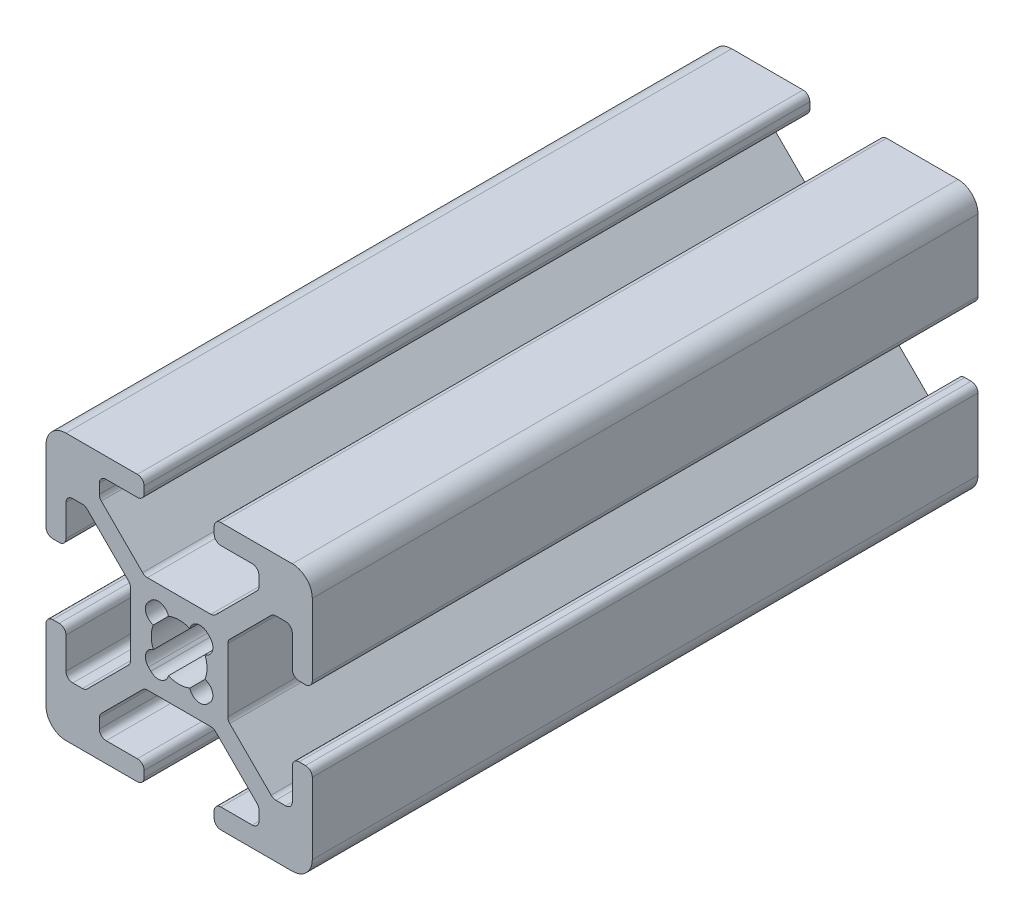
ISO-10303-21;
HEADER;
FILE_DESCRIPTION(('STEP AP214'),'2;1');
FILE_NAME('part.step','',(''),(''),'','','');
FILE_SCHEMA(('AUTOMOTIVE_DESIGN { 1 0 10303 214 1 1 1 1 }'));
ENDSEC;
DATA;
#1=APPLICATION_CONTEXT('core data for automotive mechanical design processes');
#2=APPLICATION_PROTOCOL_DEFINITION('international standard','automotive_design',2000,#1);
#3=PRODUCT_CONTEXT('',#1,'mechanical');
#4=PRODUCT('Part','Part','',(#3));
#5=PRODUCT_RELATED_PRODUCT_CATEGORY('part','',(#4));
#6=PRODUCT_DEFINITION_FORMATION('','',#4);
#7=PRODUCT_DEFINITION_CONTEXT('part definition',#1,'design');
#8=PRODUCT_DEFINITION('design','',#6,#7);
#9=PRODUCT_DEFINITION_SHAPE('','',#8);
#10=(LENGTH_UNIT() NAMED_UNIT(*) SI_UNIT(.MILLI.,.METRE.));
#11=(NAMED_UNIT(*) PLANE_ANGLE_UNIT() SI_UNIT($,.RADIAN.));
#12=(NAMED_UNIT(*) SI_UNIT($,.STERADIAN.) SOLID_ANGLE_UNIT());
#13=UNCERTAINTY_MEASURE_WITH_UNIT(LENGTH_MEASURE(1.E-05),#10,'distance_accuracy_value','');
#14=(GEOMETRIC_REPRESENTATION_CONTEXT(3) GLOBAL_UNCERTAINTY_ASSIGNED_CONTEXT((#13)) GLOBAL_UNIT_ASSIGNED_CONTEXT((#10,
#11,#12)) REPRESENTATION_CONTEXT('',''));
#15=CARTESIAN_POINT('',(0.,0.,0.));
#16=DIRECTION('',(0.,0.,1.));
#17=DIRECTION('',(1.,0.,0.));
#18=AXIS2_PLACEMENT_3D('',#15,#16,#17);
#19=CARTESIAN_POINT('',(-5.03228779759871,0.166940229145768,50.));
#20=DIRECTION('',(0.,0.,1.));
#21=DIRECTION('',(1.,0.,0.));
#22=AXIS2_PLACEMENT_3D('',#19,#20,#21);
#23=PLANE('',#22);
#24=CARTESIAN_POINT('',(-5.03228779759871,0.166940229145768,50.));
#25=DIRECTION('',(0.,0.,1.));
#26=DIRECTION('',(1.,0.,0.));
#27=AXIS2_PLACEMENT_3D('',#24,#25,#26);
#28=CIRCLE('',#27,0.508);
#29=CARTESIAN_POINT('',(-5.03228779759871,-0.341059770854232,50.));
#30=VERTEX_POINT('',#29);
#31=CARTESIAN_POINT('',(-4.52428779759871,0.166940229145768,50.));
#32=VERTEX_POINT('',#31);
#33=EDGE_CURVE('E792',#30,#32,#28,.T.);
#34=ORIENTED_EDGE('',*,*,#33,.T.);
#35=DIRECTION('',(0.,1.,0.));
#36=VECTOR('',#35,1.);
#37=CARTESIAN_POINT('',(-4.52428779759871,0.166940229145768,50.));
#38=LINE('',#37,#36);
#39=CARTESIAN_POINT('',(-4.52428779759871,5.52894022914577,50.));
#40=VERTEX_POINT('',#39);
#41=EDGE_CURVE('E795',#32,#40,#38,.T.);
#42=ORIENTED_EDGE('',*,*,#41,.T.);
#43=CARTESIAN_POINT('',(-6.02428779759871,5.52894022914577,50.));
#44=DIRECTION('',(0.,0.,1.));
#45=DIRECTION('',(1.,0.,0.));
#46=AXIS2_PLACEMENT_3D('',#43,#44,#45);
#47=CIRCLE('',#46,1.5);
#48=CARTESIAN_POINT('',(-6.02428779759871,7.02894022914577,50.));
#49=VERTEX_POINT('',#48);
#50=EDGE_CURVE('E798',#40,#49,#47,.T.);
#51=ORIENTED_EDGE('',*,*,#50,.T.);
#52=DIRECTION('',(-1.,0.,0.));
#53=VECTOR('',#52,1.);
#54=CARTESIAN_POINT('',(-11.3862877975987,7.02894022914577,50.));
#55=LINE('',#54,#53);
#56=CARTESIAN_POINT('',(-11.3862877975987,7.02894022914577,50.));
#57=VERTEX_POINT('',#56);
#58=EDGE_CURVE('E800',#49,#57,#55,.T.);
#59=ORIENTED_EDGE('',*,*,#58,.T.);
#60=CARTESIAN_POINT('',(-11.3862877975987,6.52094022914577,50.));
#61=DIRECTION('',(0.,0.,1.));
#62=DIRECTION('',(1.,0.,0.));
#63=AXIS2_PLACEMENT_3D('',#60,#61,#62);
#64=CIRCLE('',#63,0.507999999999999);
#65=CARTESIAN_POINT('',(-11.8942877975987,6.52094022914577,50.));
#66=VERTEX_POINT('',#65);
#67=EDGE_CURVE('E802',#57,#66,#64,.T.);
#68=ORIENTED_EDGE('',*,*,#67,.T.);
#69=DIRECTION('',(0.,-1.,0.));
#70=VECTOR('',#69,1.);
#71=CARTESIAN_POINT('',(-11.8942877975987,6.52094022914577,50.));
#72=LINE('',#71,#70);
#73=CARTESIAN_POINT('',(-11.8942877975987,6.03694022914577,50.));
#74=VERTEX_POINT('',#73);
#75=EDGE_CURVE('E804',#66,#74,#72,.T.);
#76=ORIENTED_EDGE('',*,*,#75,.T.);
#77=CARTESIAN_POINT('',(-11.3862877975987,6.03694022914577,50.));
#78=DIRECTION('',(0.,0.,1.));
#79=DIRECTION('',(1.,0.,0.));
#80=AXIS2_PLACEMENT_3D('',#77,#78,#79);
#81=CIRCLE('',#80,0.507999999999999);
#82=CARTESIAN_POINT('',(-11.3862877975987,5.52894022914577,50.));
#83=VERTEX_POINT('',#82);
#84=EDGE_CURVE('E806',#74,#83,#81,.T.);
#85=ORIENTED_EDGE('',*,*,#84,.T.);
#86=DIRECTION('',(1.,0.,0.));
#87=VECTOR('',#86,1.);
#88=CARTESIAN_POINT('',(-11.3862877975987,5.52894022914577,50.));
#89=LINE('',#88,#87);
#90=CARTESIAN_POINT('',(-9.03728779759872,5.52894022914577,50.));
#91=VERTEX_POINT('',#90);
#92=EDGE_CURVE('E808',#83,#91,#89,.T.);
#93=ORIENTED_EDGE('',*,*,#92,.T.);
#94=CARTESIAN_POINT('',(-9.03728779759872,5.02094022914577,50.));
#95=DIRECTION('',(0.,0.,-1.));
#96=DIRECTION('',(1.,0.,0.));
#97=AXIS2_PLACEMENT_3D('',#94,#95,#96);
#98=CIRCLE('',#97,0.508);
#99=CARTESIAN_POINT('',(-8.52928779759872,5.02094022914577,50.));
#100=VERTEX_POINT('',#99);
#101=EDGE_CURVE('E810',#91,#100,#98,.T.);
#102=ORIENTED_EDGE('',*,*,#101,.T.);
#103=DIRECTION('',(0.,-1.,0.));
#104=VECTOR('',#103,1.);
#105=CARTESIAN_POINT('',(-8.52928779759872,4.29502089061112,50.));
#106=LINE('',#105,#104);
#107=CARTESIAN_POINT('',(-8.52928779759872,4.29502089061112,50.));
#108=VERTEX_POINT('',#107);
#109=EDGE_CURVE('E812',#100,#108,#106,.T.);
#110=ORIENTED_EDGE('',*,*,#109,.T.);
#111=CARTESIAN_POINT('',(-9.03728779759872,4.29502089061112,50.));
#112=DIRECTION('',(0.,0.,-1.));
#113=DIRECTION('',(1.,0.,0.));
#114=AXIS2_PLACEMENT_3D('',#111,#112,#113);
#115=CIRCLE('',#114,0.508);
#116=CARTESIAN_POINT('',(-8.67807755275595,3.93581064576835,50.));
#117=VERTEX_POINT('',#116);
#118=EDGE_CURVE('E814',#108,#117,#115,.T.);
#119=ORIENTED_EDGE('',*,*,#118,.T.);
#120=DIRECTION('',(-0.707106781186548,-0.707106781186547,0.));
#121=VECTOR('',#120,1.);
#122=CARTESIAN_POINT('',(-8.67807755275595,3.93581064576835,50.));
#123=LINE('',#122,#121);
#124=CARTESIAN_POINT('',(-11.7811582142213,0.832729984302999,50.));
#125=VERTEX_POINT('',#124);
#126=EDGE_CURVE('E816',#117,#125,#123,.T.);
#127=ORIENTED_EDGE('',*,*,#126,.T.);
#128=CARTESIAN_POINT('',(-12.1403684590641,1.19194022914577,50.));
#129=DIRECTION('',(0.,0.,-1.));
#130=DIRECTION('',(1.,0.,0.));
#131=AXIS2_PLACEMENT_3D('',#128,#129,#130);
#132=CIRCLE('',#131,0.508);
#133=CARTESIAN_POINT('',(-12.1403684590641,0.683940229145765,50.));
#134=VERTEX_POINT('',#133);
#135=EDGE_CURVE('E818',#125,#134,#132,.T.);
#136=ORIENTED_EDGE('',*,*,#135,.T.);
#137=DIRECTION('',(-1.,0.,0.));
#138=VECTOR('',#137,1.);
#139=CARTESIAN_POINT('',(-12.1403684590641,0.683940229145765,50.));
#140=LINE('',#139,#138);
#141=CARTESIAN_POINT('',(-16.9082071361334,0.683940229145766,50.));
#142=VERTEX_POINT('',#141);
#143=EDGE_CURVE('E820',#134,#142,#140,.T.);
#144=ORIENTED_EDGE('',*,*,#143,.T.);
#145=CARTESIAN_POINT('',(-16.9082071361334,1.19194022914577,50.));
#146=DIRECTION('',(0.,0.,-1.));
#147=DIRECTION('',(1.,0.,0.));
#148=AXIS2_PLACEMENT_3D('',#145,#146,#147);
#149=CIRCLE('',#148,0.508000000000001);
#150=CARTESIAN_POINT('',(-17.2674173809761,0.832729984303,50.));
#151=VERTEX_POINT('',#150);
#152=EDGE_CURVE('E822',#142,#151,#149,.T.);
#153=ORIENTED_EDGE('',*,*,#152,.T.);
#154=DIRECTION('',(-0.707106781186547,0.707106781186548,0.));
#155=VECTOR('',#154,1.);
#156=CARTESIAN_POINT('',(-20.3704980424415,3.93581064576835,50.));
#157=LINE('',#156,#155);
#158=CARTESIAN_POINT('',(-20.3704980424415,3.93581064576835,50.));
#159=VERTEX_POINT('',#158);
#160=EDGE_CURVE('E824',#151,#159,#157,.T.);
#161=ORIENTED_EDGE('',*,*,#160,.T.);
#162=CARTESIAN_POINT('',(-20.0112877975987,4.29502089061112,50.));
#163=DIRECTION('',(0.,0.,-1.));
#164=DIRECTION('',(1.,0.,0.));
#165=AXIS2_PLACEMENT_3D('',#162,#163,#164);
#166=CIRCLE('',#165,0.507999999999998);
#167=CARTESIAN_POINT('',(-20.5192877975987,4.29502089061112,50.));
#168=VERTEX_POINT('',#167);
#169=EDGE_CURVE('E826',#159,#168,#166,.T.);
#170=ORIENTED_EDGE('',*,*,#169,.T.);
#171=DIRECTION('',(0.,1.,0.));
#172=VECTOR('',#171,1.);
#173=CARTESIAN_POINT('',(-20.5192877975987,4.29502089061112,50.));
#174=LINE('',#173,#172);
#175=CARTESIAN_POINT('',(-20.5192877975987,5.02094022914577,50.));
#176=VERTEX_POINT('',#175);
#177=EDGE_CURVE('E828',#168,#176,#174,.T.);
#178=ORIENTED_EDGE('',*,*,#177,.T.);
#179=CARTESIAN_POINT('',(-20.0112877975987,5.02094022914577,50.));
#180=DIRECTION('',(0.,0.,-1.));
#181=DIRECTION('',(1.,0.,0.));
#182=AXIS2_PLACEMENT_3D('',#179,#180,#181);
#183=CIRCLE('',#182,0.507999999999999);
#184=CARTESIAN_POINT('',(-20.0112877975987,5.52894022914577,50.));
#185=VERTEX_POINT('',#184);
#186=EDGE_CURVE('E830',#176,#185,#183,.T.);
#187=ORIENTED_EDGE('',*,*,#186,.T.);
#188=DIRECTION('',(1.,0.,0.));
#189=VECTOR('',#188,1.);
#190=CARTESIAN_POINT('',(-17.6622877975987,5.52894022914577,50.));
#191=LINE('',#190,#189);
#192=CARTESIAN_POINT('',(-17.6622877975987,5.52894022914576,50.));
#193=VERTEX_POINT('',#192);
#194=EDGE_CURVE('E832',#185,#193,#191,.T.);
#195=ORIENTED_EDGE('',*,*,#194,.T.);
#196=CARTESIAN_POINT('',(-17.6622877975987,6.03694022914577,50.));
#197=DIRECTION('',(0.,0.,1.));
#198=DIRECTION('',(1.,0.,0.));
#199=AXIS2_PLACEMENT_3D('',#196,#197,#198);
#200=CIRCLE('',#199,0.508000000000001);
#201=CARTESIAN_POINT('',(-17.1542877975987,6.03694022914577,50.));
#202=VERTEX_POINT('',#201);
#203=EDGE_CURVE('E834',#193,#202,#200,.T.);
#204=ORIENTED_EDGE('',*,*,#203,.T.);
#205=DIRECTION('',(0.,1.,0.));
#206=VECTOR('',#205,1.);
#207=CARTESIAN_POINT('',(-17.1542877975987,6.52094022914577,50.));
#208=LINE('',#207,#206);
#209=CARTESIAN_POINT('',(-17.1542877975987,6.52094022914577,50.));
#210=VERTEX_POINT('',#209);
#211=EDGE_CURVE('E836',#202,#210,#208,.T.);
#212=ORIENTED_EDGE('',*,*,#211,.T.);
#213=CARTESIAN_POINT('',(-17.6622877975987,6.52094022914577,50.));
#214=DIRECTION('',(0.,0.,1.));
#215=DIRECTION('',(1.,0.,0.));
#216=AXIS2_PLACEMENT_3D('',#213,#214,#215);
#217=CIRCLE('',#216,0.508000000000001);
#218=CARTESIAN_POINT('',(-17.6622877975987,7.02894022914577,50.));
#219=VERTEX_POINT('',#218);
#220=EDGE_CURVE('E838',#210,#219,#217,.T.);
#221=ORIENTED_EDGE('',*,*,#220,.T.);
#222=DIRECTION('',(-1.,0.,0.));
#223=VECTOR('',#222,1.);
#224=CARTESIAN_POINT('',(-17.6622877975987,7.02894022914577,50.));
#225=LINE('',#224,#223);
#226=CARTESIAN_POINT('',(-23.0242877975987,7.02894022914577,50.));
#227=VERTEX_POINT('',#226);
#228=EDGE_CURVE('E840',#219,#227,#225,.T.);
#229=ORIENTED_EDGE('',*,*,#228,.T.);
#230=CARTESIAN_POINT('',(-23.0242877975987,5.52894022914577,50.));
#231=DIRECTION('',(0.,0.,1.));
#232=DIRECTION('',(1.,0.,0.));
#233=AXIS2_PLACEMENT_3D('',#230,#231,#232);
#234=CIRCLE('',#233,1.5);
#235=CARTESIAN_POINT('',(-24.5242877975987,5.52894022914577,50.));
#236=VERTEX_POINT('',#235);
#237=EDGE_CURVE('E842',#227,#236,#234,.T.);
#238=ORIENTED_EDGE('',*,*,#237,.T.);
#239=DIRECTION('',(0.,-1.,0.));
#240=VECTOR('',#239,1.);
#241=CARTESIAN_POINT('',(-24.5242877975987,0.166940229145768,50.));
#242=LINE('',#241,#240);
#243=CARTESIAN_POINT('',(-24.5242877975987,0.166940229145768,50.));
#244=VERTEX_POINT('',#243);
#245=EDGE_CURVE('E844',#236,#244,#242,.T.);
#246=ORIENTED_EDGE('',*,*,#245,.T.);
#247=CARTESIAN_POINT('',(-24.0162877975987,0.166940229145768,50.));
#248=DIRECTION('',(0.,0.,1.));
#249=DIRECTION('',(1.,0.,0.));
#250=AXIS2_PLACEMENT_3D('',#247,#248,#249);
#251=CIRCLE('',#250,0.508000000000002);
#252=CARTESIAN_POINT('',(-24.0162877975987,-0.341059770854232,50.));
#253=VERTEX_POINT('',#252);
#254=EDGE_CURVE('E846',#244,#253,#251,.T.);
#255=ORIENTED_EDGE('',*,*,#254,.T.);
#256=DIRECTION('',(1.,0.,0.));
#257=VECTOR('',#256,1.);
#258=CARTESIAN_POINT('',(-24.0162877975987,-0.341059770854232,50.));
#259=LINE('',#258,#257);
#260=CARTESIAN_POINT('',(-23.5322877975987,-0.341059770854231,50.));
#261=VERTEX_POINT('',#260);
#262=EDGE_CURVE('E848',#253,#261,#259,.T.);
#263=ORIENTED_EDGE('',*,*,#262,.T.);
#264=CARTESIAN_POINT('',(-23.5322877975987,0.166940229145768,50.));
#265=DIRECTION('',(0.,0.,1.));
#266=DIRECTION('',(1.,0.,0.));
#267=AXIS2_PLACEMENT_3D('',#264,#265,#266);
#268=CIRCLE('',#267,0.507999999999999);
#269=CARTESIAN_POINT('',(-23.0242877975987,0.166940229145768,50.));
#270=VERTEX_POINT('',#269);
#271=EDGE_CURVE('E850',#261,#270,#268,.T.);
#272=ORIENTED_EDGE('',*,*,#271,.T.);
#273=DIRECTION('',(0.,1.,0.));
#274=VECTOR('',#273,1.);
#275=CARTESIAN_POINT('',(-23.0242877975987,0.166940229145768,50.));
#276=LINE('',#275,#274);
#277=CARTESIAN_POINT('',(-23.0242877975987,2.51594022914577,50.));
#278=VERTEX_POINT('',#277);
#279=EDGE_CURVE('E852',#270,#278,#276,.T.);
#280=ORIENTED_EDGE('',*,*,#279,.T.);
#281=CARTESIAN_POINT('',(-22.5162877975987,2.51594022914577,50.));
#282=DIRECTION('',(0.,0.,-1.));
#283=DIRECTION('',(1.,0.,0.));
#284=AXIS2_PLACEMENT_3D('',#281,#282,#283);
#285=CIRCLE('',#284,0.508000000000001);
#286=CARTESIAN_POINT('',(-22.5162877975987,3.02394022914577,50.));
#287=VERTEX_POINT('',#286);
#288=EDGE_CURVE('E854',#278,#287,#285,.T.);
#289=ORIENTED_EDGE('',*,*,#288,.T.);
#290=DIRECTION('',(1.,0.,0.));
#291=VECTOR('',#290,1.);
#292=CARTESIAN_POINT('',(-21.7903684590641,3.02394022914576,50.));
#293=LINE('',#292,#291);
#294=CARTESIAN_POINT('',(-21.7903684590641,3.02394022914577,50.));
#295=VERTEX_POINT('',#294);
#296=EDGE_CURVE('E856',#287,#295,#293,.T.);
#297=ORIENTED_EDGE('',*,*,#296,.T.);
#298=CARTESIAN_POINT('',(-21.7903684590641,2.51594022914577,50.));
#299=DIRECTION('',(0.,0.,-1.));
#300=DIRECTION('',(1.,0.,0.));
#301=AXIS2_PLACEMENT_3D('',#298,#299,#300);
#302=CIRCLE('',#301,0.508);
#303=CARTESIAN_POINT('',(-21.4311582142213,2.87515047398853,50.));
#304=VERTEX_POINT('',#303);
#305=EDGE_CURVE('E858',#295,#304,#302,.T.);
#306=ORIENTED_EDGE('',*,*,#305,.T.);
#307=DIRECTION('',(0.707106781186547,-0.707106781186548,0.));
#308=VECTOR('',#307,1.);
#309=CARTESIAN_POINT('',(-21.4311582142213,2.87515047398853,50.));
#310=LINE('',#309,#308);
#311=CARTESIAN_POINT('',(-18.3280775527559,-0.227930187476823,50.));
#312=VERTEX_POINT('',#311);
#313=EDGE_CURVE('E860',#304,#312,#310,.T.);
#314=ORIENTED_EDGE('',*,*,#313,.T.);
#315=CARTESIAN_POINT('',(-18.6872877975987,-0.587140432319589,50.));
#316=DIRECTION('',(0.,0.,-1.));
#317=DIRECTION('',(1.,0.,0.));
#318=AXIS2_PLACEMENT_3D('',#315,#316,#317);
#319=CIRCLE('',#318,0.507999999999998);
#320=CARTESIAN_POINT('',(-18.1792877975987,-0.587140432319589,50.));
#321=VERTEX_POINT('',#320);
#322=EDGE_CURVE('E862',#312,#321,#319,.T.);
#323=ORIENTED_EDGE('',*,*,#322,.T.);
#324=DIRECTION('',(0.,-1.,0.));
#325=VECTOR('',#324,1.);
#326=CARTESIAN_POINT('',(-18.1792877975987,-0.587140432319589,50.));
#327=LINE('',#326,#325);
#328=CARTESIAN_POINT('',(-18.1792877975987,-5.35497910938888,50.));
#329=VERTEX_POINT('',#328);
#330=EDGE_CURVE('E864',#321,#329,#327,.T.);
#331=ORIENTED_EDGE('',*,*,#330,.T.);
#332=CARTESIAN_POINT('',(-18.6872877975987,-5.35497910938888,50.));
#333=DIRECTION('',(0.,0.,-1.));
#334=DIRECTION('',(1.,0.,0.));
#335=AXIS2_PLACEMENT_3D('',#332,#333,#334);
#336=CIRCLE('',#335,0.507999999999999);
#337=CARTESIAN_POINT('',(-18.3280775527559,-5.71418935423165,50.));
#338=VERTEX_POINT('',#337);
#339=EDGE_CURVE('E866',#329,#338,#336,.T.);
#340=ORIENTED_EDGE('',*,*,#339,.T.);
#341=DIRECTION('',(-0.707106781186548,-0.707106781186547,0.));
#342=VECTOR('',#341,1.);
#343=CARTESIAN_POINT('',(-21.4311582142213,-8.817270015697,50.));
#344=LINE('',#343,#342);
#345=CARTESIAN_POINT('',(-21.4311582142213,-8.817270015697,50.));
#346=VERTEX_POINT('',#345);
#347=EDGE_CURVE('E868',#338,#346,#344,.T.);
#348=ORIENTED_EDGE('',*,*,#347,.T.);
#349=CARTESIAN_POINT('',(-21.7903684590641,-8.45805977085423,50.));
#350=DIRECTION('',(0.,0.,-1.));
#351=DIRECTION('',(1.,0.,0.));
#352=AXIS2_PLACEMENT_3D('',#349,#350,#351);
#353=CIRCLE('',#352,0.507999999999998);
#354=CARTESIAN_POINT('',(-21.7903684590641,-8.96605977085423,50.));
#355=VERTEX_POINT('',#354);
#356=EDGE_CURVE('E870',#346,#355,#353,.T.);
#357=ORIENTED_EDGE('',*,*,#356,.T.);
#358=DIRECTION('',(-1.,0.,0.));
#359=VECTOR('',#358,1.);
#360=CARTESIAN_POINT('',(-21.7903684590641,-8.96605977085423,50.));
#361=LINE('',#360,#359);
#362=CARTESIAN_POINT('',(-22.5162877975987,-8.96605977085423,50.));
#363=VERTEX_POINT('',#362);
#364=EDGE_CURVE('E872',#355,#363,#361,.T.);
#365=ORIENTED_EDGE('',*,*,#364,.T.);
#366=CARTESIAN_POINT('',(-22.5162877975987,-8.45805977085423,50.));
#367=DIRECTION('',(0.,0.,-1.));
#368=DIRECTION('',(1.,0.,0.));
#369=AXIS2_PLACEMENT_3D('',#366,#367,#368);
#370=CIRCLE('',#369,0.507999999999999);
#371=CARTESIAN_POINT('',(-23.0242877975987,-8.45805977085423,50.));
#372=VERTEX_POINT('',#371);
#373=EDGE_CURVE('E874',#363,#372,#370,.T.);
#374=ORIENTED_EDGE('',*,*,#373,.T.);
#375=DIRECTION('',(0.,1.,0.));
#376=VECTOR('',#375,1.);
#377=CARTESIAN_POINT('',(-23.0242877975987,-6.10905977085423,50.));
#378=LINE('',#377,#376);
#379=CARTESIAN_POINT('',(-23.0242877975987,-6.10905977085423,50.));
#380=VERTEX_POINT('',#379);
#381=EDGE_CURVE('E876',#372,#380,#378,.T.);
#382=ORIENTED_EDGE('',*,*,#381,.T.);
#383=CARTESIAN_POINT('',(-23.5322877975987,-6.10905977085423,50.));
#384=DIRECTION('',(0.,0.,1.));
#385=DIRECTION('',(1.,0.,0.));
#386=AXIS2_PLACEMENT_3D('',#383,#384,#385);
#387=CIRCLE('',#386,0.507999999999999);
#388=CARTESIAN_POINT('',(-23.5322877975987,-5.60105977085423,50.));
#389=VERTEX_POINT('',#388);
#390=EDGE_CURVE('E878',#380,#389,#387,.T.);
#391=ORIENTED_EDGE('',*,*,#390,.T.);
#392=DIRECTION('',(-1.,0.,0.));
#393=VECTOR('',#392,1.);
#394=CARTESIAN_POINT('',(-24.0162877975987,-5.60105977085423,50.));
#395=LINE('',#394,#393);
#396=CARTESIAN_POINT('',(-24.0162877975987,-5.60105977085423,50.));
#397=VERTEX_POINT('',#396);
#398=EDGE_CURVE('E880',#389,#397,#395,.T.);
#399=ORIENTED_EDGE('',*,*,#398,.T.);
#400=CARTESIAN_POINT('',(-24.0162877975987,-6.10905977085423,50.));
#401=DIRECTION('',(0.,0.,1.));
#402=DIRECTION('',(1.,0.,0.));
#403=AXIS2_PLACEMENT_3D('',#400,#401,#402);
#404=CIRCLE('',#403,0.508000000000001);
#405=CARTESIAN_POINT('',(-24.5242877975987,-6.10905977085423,50.));
#406=VERTEX_POINT('',#405);
#407=EDGE_CURVE('E882',#397,#406,#404,.T.);
#408=ORIENTED_EDGE('',*,*,#407,.T.);
#409=DIRECTION('',(0.,-1.,0.));
#410=VECTOR('',#409,1.);
#411=CARTESIAN_POINT('',(-24.5242877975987,-6.10905977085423,50.));
#412=LINE('',#411,#410);
#413=CARTESIAN_POINT('',(-24.5242877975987,-11.4710597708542,50.));
#414=VERTEX_POINT('',#413);
#415=EDGE_CURVE('E884',#406,#414,#412,.T.);
#416=ORIENTED_EDGE('',*,*,#415,.T.);
#417=CARTESIAN_POINT('',(-23.0242877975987,-11.4710597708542,50.));
#418=DIRECTION('',(0.,0.,1.));
#419=DIRECTION('',(1.,0.,0.));
#420=AXIS2_PLACEMENT_3D('',#417,#418,#419);
#421=CIRCLE('',#420,1.5);
#422=CARTESIAN_POINT('',(-23.0242877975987,-12.9710597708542,50.));
#423=VERTEX_POINT('',#422);
#424=EDGE_CURVE('E886',#414,#423,#421,.T.);
#425=ORIENTED_EDGE('',*,*,#424,.T.);
#426=DIRECTION('',(1.,0.,0.));
#427=VECTOR('',#426,1.);
#428=CARTESIAN_POINT('',(-17.6622877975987,-12.9710597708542,50.));
#429=LINE('',#428,#427);
#430=CARTESIAN_POINT('',(-17.6622877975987,-12.9710597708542,50.));
#431=VERTEX_POINT('',#430);
#432=EDGE_CURVE('E888',#423,#431,#429,.T.);
#433=ORIENTED_EDGE('',*,*,#432,.T.);
#434=CARTESIAN_POINT('',(-17.6622877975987,-12.4630597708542,50.));
#435=DIRECTION('',(0.,0.,1.));
#436=DIRECTION('',(1.,0.,0.));
#437=AXIS2_PLACEMENT_3D('',#434,#435,#436);
#438=CIRCLE('',#437,0.508);
#439=CARTESIAN_POINT('',(-17.1542877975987,-12.4630597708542,50.));
#440=VERTEX_POINT('',#439);
#441=EDGE_CURVE('E890',#431,#440,#438,.T.);
#442=ORIENTED_EDGE('',*,*,#441,.T.);
#443=DIRECTION('',(0.,1.,0.));
#444=VECTOR('',#443,1.);
#445=CARTESIAN_POINT('',(-17.1542877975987,-12.4630597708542,50.));
#446=LINE('',#445,#444);
#447=CARTESIAN_POINT('',(-17.1542877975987,-11.9790597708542,50.));
#448=VERTEX_POINT('',#447);
#449=EDGE_CURVE('E892',#440,#448,#446,.T.);
#450=ORIENTED_EDGE('',*,*,#449,.T.);
#451=CARTESIAN_POINT('',(-17.6622877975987,-11.9790597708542,50.));
#452=DIRECTION('',(0.,0.,1.));
#453=DIRECTION('',(1.,0.,0.));
#454=AXIS2_PLACEMENT_3D('',#451,#452,#453);
#455=CIRCLE('',#454,0.507999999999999);
#456=CARTESIAN_POINT('',(-17.6622877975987,-11.4710597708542,50.));
#457=VERTEX_POINT('',#456);
#458=EDGE_CURVE('E894',#448,#457,#455,.T.);
#459=ORIENTED_EDGE('',*,*,#458,.T.);
#460=DIRECTION('',(-1.,0.,0.));
#461=VECTOR('',#460,1.);
#462=CARTESIAN_POINT('',(-17.6622877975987,-11.4710597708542,50.));
#463=LINE('',#462,#461);
#464=CARTESIAN_POINT('',(-20.0112877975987,-11.4710597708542,50.));
#465=VERTEX_POINT('',#464);
#466=EDGE_CURVE('E896',#457,#465,#463,.T.);
#467=ORIENTED_EDGE('',*,*,#466,.T.);
#468=CARTESIAN_POINT('',(-20.0112877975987,-10.9630597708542,50.));
#469=DIRECTION('',(0.,0.,-1.));
#470=DIRECTION('',(1.,0.,0.));
#471=AXIS2_PLACEMENT_3D('',#468,#469,#470);
#472=CIRCLE('',#471,0.507999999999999);
#473=CARTESIAN_POINT('',(-20.5192877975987,-10.9630597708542,50.));
#474=VERTEX_POINT('',#473);
#475=EDGE_CURVE('E898',#465,#474,#472,.T.);
#476=ORIENTED_EDGE('',*,*,#475,.T.);
#477=DIRECTION('',(0.,1.,0.));
#478=VECTOR('',#477,1.);
#479=CARTESIAN_POINT('',(-20.5192877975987,-10.2371404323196,50.));
#480=LINE('',#479,#478);
#481=CARTESIAN_POINT('',(-20.5192877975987,-10.2371404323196,50.));
#482=VERTEX_POINT('',#481);
#483=EDGE_CURVE('E900',#474,#482,#480,.T.);
#484=ORIENTED_EDGE('',*,*,#483,.T.);
#485=CARTESIAN_POINT('',(-20.0112877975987,-10.2371404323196,50.));
#486=DIRECTION('',(0.,0.,-1.));
#487=DIRECTION('',(1.,0.,0.));
#488=AXIS2_PLACEMENT_3D('',#485,#486,#487);
#489=CIRCLE('',#488,0.507999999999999);
#490=CARTESIAN_POINT('',(-20.3704980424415,-9.87793018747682,50.));
#491=VERTEX_POINT('',#490);
#492=EDGE_CURVE('E902',#482,#491,#489,.T.);
#493=ORIENTED_EDGE('',*,*,#492,.T.);
#494=DIRECTION('',(0.707106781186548,0.707106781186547,0.));
#495=VECTOR('',#494,1.);
#496=CARTESIAN_POINT('',(-20.3704980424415,-9.87793018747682,50.));
#497=LINE('',#496,#495);
#498=CARTESIAN_POINT('',(-17.2674173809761,-6.77484952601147,50.));
#499=VERTEX_POINT('',#498);
#500=EDGE_CURVE('E904',#491,#499,#497,.T.);
#501=ORIENTED_EDGE('',*,*,#500,.T.);
#502=CARTESIAN_POINT('',(-16.9082071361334,-7.13405977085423,50.));
#503=DIRECTION('',(0.,0.,-1.));
#504=DIRECTION('',(1.,0.,0.));
#505=AXIS2_PLACEMENT_3D('',#502,#503,#504);
#506=CIRCLE('',#505,0.508);
#507=CARTESIAN_POINT('',(-16.9082071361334,-6.62605977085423,50.));
#508=VERTEX_POINT('',#507);
#509=EDGE_CURVE('E906',#499,#508,#506,.T.);
#510=ORIENTED_EDGE('',*,*,#509,.T.);
#511=DIRECTION('',(1.,0.,0.));
#512=VECTOR('',#511,1.);
#513=CARTESIAN_POINT('',(-16.9082071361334,-6.62605977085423,50.));
#514=LINE('',#513,#512);
#515=CARTESIAN_POINT('',(-12.1403684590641,-6.62605977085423,50.));
#516=VERTEX_POINT('',#515);
#517=EDGE_CURVE('E908',#508,#516,#514,.T.);
#518=ORIENTED_EDGE('',*,*,#517,.T.);
#519=CARTESIAN_POINT('',(-12.1403684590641,-7.13405977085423,50.));
#520=DIRECTION('',(0.,0.,-1.));
#521=DIRECTION('',(1.,0.,0.));
#522=AXIS2_PLACEMENT_3D('',#519,#520,#521);
#523=CIRCLE('',#522,0.508);
#524=CARTESIAN_POINT('',(-11.7811582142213,-6.77484952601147,50.));
#525=VERTEX_POINT('',#524);
#526=EDGE_CURVE('E910',#516,#525,#523,.T.);
#527=ORIENTED_EDGE('',*,*,#526,.T.);
#528=DIRECTION('',(0.707106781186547,-0.707106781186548,0.));
#529=VECTOR('',#528,1.);
#530=CARTESIAN_POINT('',(-8.67807755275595,-9.87793018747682,50.));
#531=LINE('',#530,#529);
#532=CARTESIAN_POINT('',(-8.67807755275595,-9.87793018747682,50.));
#533=VERTEX_POINT('',#532);
#534=EDGE_CURVE('E912',#525,#533,#531,.T.);
#535=ORIENTED_EDGE('',*,*,#534,.T.);
#536=CARTESIAN_POINT('',(-9.03728779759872,-10.2371404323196,50.));
#537=DIRECTION('',(0.,0.,-1.));
#538=DIRECTION('',(1.,0.,0.));
#539=AXIS2_PLACEMENT_3D('',#536,#537,#538);
#540=CIRCLE('',#539,0.508);
#541=CARTESIAN_POINT('',(-8.52928779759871,-10.2371404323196,50.));
#542=VERTEX_POINT('',#541);
#543=EDGE_CURVE('E914',#533,#542,#540,.T.);
#544=ORIENTED_EDGE('',*,*,#543,.T.);
#545=DIRECTION('',(0.,-1.,0.));
#546=VECTOR('',#545,1.);
#547=CARTESIAN_POINT('',(-8.52928779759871,-10.2371404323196,50.));
#548=LINE('',#547,#546);
#549=CARTESIAN_POINT('',(-8.52928779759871,-10.9630597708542,50.));
#550=VERTEX_POINT('',#549);
#551=EDGE_CURVE('E916',#542,#550,#548,.T.);
#552=ORIENTED_EDGE('',*,*,#551,.T.);
#553=CARTESIAN_POINT('',(-9.03728779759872,-10.9630597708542,50.));
#554=DIRECTION('',(0.,0.,-1.));
#555=DIRECTION('',(1.,0.,0.));
#556=AXIS2_PLACEMENT_3D('',#553,#554,#555);
#557=CIRCLE('',#556,0.508);
#558=CARTESIAN_POINT('',(-9.03728779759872,-11.4710597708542,50.));
#559=VERTEX_POINT('',#558);
#560=EDGE_CURVE('E918',#550,#559,#557,.T.);
#561=ORIENTED_EDGE('',*,*,#560,.T.);
#562=DIRECTION('',(-1.,0.,0.));
#563=VECTOR('',#562,1.);
#564=CARTESIAN_POINT('',(-11.3862877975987,-11.4710597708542,50.));
#565=LINE('',#564,#563);
#566=CARTESIAN_POINT('',(-11.3862877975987,-11.4710597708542,50.));
#567=VERTEX_POINT('',#566);
#568=EDGE_CURVE('E920',#559,#567,#565,.T.);
#569=ORIENTED_EDGE('',*,*,#568,.T.);
#570=CARTESIAN_POINT('',(-11.3862877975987,-11.9790597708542,50.));
#571=DIRECTION('',(0.,0.,1.));
#572=DIRECTION('',(1.,0.,0.));
#573=AXIS2_PLACEMENT_3D('',#570,#571,#572);
#574=CIRCLE('',#573,0.508);
#575=CARTESIAN_POINT('',(-11.8942877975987,-11.9790597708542,50.));
#576=VERTEX_POINT('',#575);
#577=EDGE_CURVE('E922',#567,#576,#574,.T.);
#578=ORIENTED_EDGE('',*,*,#577,.T.);
#579=DIRECTION('',(0.,-1.,0.));
#580=VECTOR('',#579,1.);
#581=CARTESIAN_POINT('',(-11.8942877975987,-12.4630597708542,50.));
#582=LINE('',#581,#580);
#583=CARTESIAN_POINT('',(-11.8942877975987,-12.4630597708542,50.));
#584=VERTEX_POINT('',#583);
#585=EDGE_CURVE('E924',#576,#584,#582,.T.);
#586=ORIENTED_EDGE('',*,*,#585,.T.);
#587=CARTESIAN_POINT('',(-11.3862877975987,-12.4630597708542,50.));
#588=DIRECTION('',(0.,0.,1.));
#589=DIRECTION('',(1.,0.,0.));
#590=AXIS2_PLACEMENT_3D('',#587,#588,#589);
#591=CIRCLE('',#590,0.508000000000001);
#592=CARTESIAN_POINT('',(-11.3862877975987,-12.9710597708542,50.));
#593=VERTEX_POINT('',#592);
#594=EDGE_CURVE('E926',#584,#593,#591,.T.);
#595=ORIENTED_EDGE('',*,*,#594,.T.);
#596=DIRECTION('',(1.,0.,0.));
#597=VECTOR('',#596,1.);
#598=CARTESIAN_POINT('',(-11.3862877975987,-12.9710597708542,50.));
#599=LINE('',#598,#597);
#600=CARTESIAN_POINT('',(-6.02428779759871,-12.9710597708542,50.));
#601=VERTEX_POINT('',#600);
#602=EDGE_CURVE('E928',#593,#601,#599,.T.);
#603=ORIENTED_EDGE('',*,*,#602,.T.);
#604=CARTESIAN_POINT('',(-6.02428779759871,-11.4710597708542,50.));
#605=DIRECTION('',(0.,0.,1.));
#606=DIRECTION('',(1.,0.,0.));
#607=AXIS2_PLACEMENT_3D('',#604,#605,#606);
#608=CIRCLE('',#607,1.5);
#609=CARTESIAN_POINT('',(-4.52428779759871,-11.4710597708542,50.));
#610=VERTEX_POINT('',#609);
#611=EDGE_CURVE('E930',#601,#610,#608,.T.);
#612=ORIENTED_EDGE('',*,*,#611,.T.);
#613=DIRECTION('',(0.,1.,0.));
#614=VECTOR('',#613,1.);
#615=CARTESIAN_POINT('',(-4.52428779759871,-6.10905977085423,50.));
#616=LINE('',#615,#614);
#617=CARTESIAN_POINT('',(-4.52428779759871,-6.10905977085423,50.));
#618=VERTEX_POINT('',#617);
#619=EDGE_CURVE('E932',#610,#618,#616,.T.);
#620=ORIENTED_EDGE('',*,*,#619,.T.);
#621=CARTESIAN_POINT('',(-5.03228779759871,-6.10905977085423,50.));
#622=DIRECTION('',(0.,0.,1.));
#623=DIRECTION('',(1.,0.,0.));
#624=AXIS2_PLACEMENT_3D('',#621,#622,#623);
#625=CIRCLE('',#624,0.508);
#626=CARTESIAN_POINT('',(-5.03228779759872,-5.60105977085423,50.));
#627=VERTEX_POINT('',#626);
#628=EDGE_CURVE('E934',#618,#627,#625,.T.);
#629=ORIENTED_EDGE('',*,*,#628,.T.);
#630=DIRECTION('',(-1.,0.,0.));
#631=VECTOR('',#630,1.);
#632=CARTESIAN_POINT('',(-5.03228779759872,-5.60105977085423,50.));
#633=LINE('',#632,#631);
#634=CARTESIAN_POINT('',(-5.51628779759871,-5.60105977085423,50.));
#635=VERTEX_POINT('',#634);
#636=EDGE_CURVE('E936',#627,#635,#633,.T.);
#637=ORIENTED_EDGE('',*,*,#636,.T.);
#638=CARTESIAN_POINT('',(-5.51628779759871,-6.10905977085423,50.));
#639=DIRECTION('',(0.,0.,1.));
#640=DIRECTION('',(1.,0.,0.));
#641=AXIS2_PLACEMENT_3D('',#638,#639,#640);
#642=CIRCLE('',#641,0.508);
#643=CARTESIAN_POINT('',(-6.02428779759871,-6.10905977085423,50.));
#644=VERTEX_POINT('',#643);
#645=EDGE_CURVE('E938',#635,#644,#642,.T.);
#646=ORIENTED_EDGE('',*,*,#645,.T.);
#647=DIRECTION('',(0.,-1.,0.));
#648=VECTOR('',#647,1.);
#649=CARTESIAN_POINT('',(-6.02428779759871,-6.10905977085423,50.));
#650=LINE('',#649,#648);
#651=CARTESIAN_POINT('',(-6.02428779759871,-8.45805977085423,50.));
#652=VERTEX_POINT('',#651);
#653=EDGE_CURVE('E940',#644,#652,#650,.T.);
#654=ORIENTED_EDGE('',*,*,#653,.T.);
#655=CARTESIAN_POINT('',(-6.53228779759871,-8.45805977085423,50.));
#656=DIRECTION('',(0.,0.,-1.));
#657=DIRECTION('',(1.,0.,0.));
#658=AXIS2_PLACEMENT_3D('',#655,#656,#657);
#659=CIRCLE('',#658,0.507999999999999);
#660=CARTESIAN_POINT('',(-6.53228779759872,-8.96605977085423,50.));
#661=VERTEX_POINT('',#660);
#662=EDGE_CURVE('E942',#652,#661,#659,.T.);
#663=ORIENTED_EDGE('',*,*,#662,.T.);
#664=DIRECTION('',(-1.,0.,0.));
#665=VECTOR('',#664,1.);
#666=CARTESIAN_POINT('',(-7.25820713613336,-8.96605977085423,50.));
#667=LINE('',#666,#665);
#668=CARTESIAN_POINT('',(-7.25820713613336,-8.96605977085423,50.));
#669=VERTEX_POINT('',#668);
#670=EDGE_CURVE('E944',#661,#669,#667,.T.);
#671=ORIENTED_EDGE('',*,*,#670,.T.);
#672=CARTESIAN_POINT('',(-7.25820713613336,-8.45805977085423,50.));
#673=DIRECTION('',(0.,0.,-1.));
#674=DIRECTION('',(1.,0.,0.));
#675=AXIS2_PLACEMENT_3D('',#672,#673,#674);
#676=CIRCLE('',#675,0.507999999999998);
#677=CARTESIAN_POINT('',(-7.61741738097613,-8.817270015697,50.));
#678=VERTEX_POINT('',#677);
#679=EDGE_CURVE('E946',#669,#678,#676,.T.);
#680=ORIENTED_EDGE('',*,*,#679,.T.);
#681=DIRECTION('',(-0.707106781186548,0.707106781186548,0.));
#682=VECTOR('',#681,1.);
#683=CARTESIAN_POINT('',(-7.61741738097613,-8.817270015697,50.));
#684=LINE('',#683,#682);
#685=CARTESIAN_POINT('',(-10.7204980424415,-5.71418935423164,50.));
#686=VERTEX_POINT('',#685);
#687=EDGE_CURVE('E948',#678,#686,#684,.T.);
#688=ORIENTED_EDGE('',*,*,#687,.T.);
#689=CARTESIAN_POINT('',(-10.3612877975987,-5.35497910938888,50.));
#690=DIRECTION('',(0.,0.,-1.));
#691=DIRECTION('',(1.,0.,0.));
#692=AXIS2_PLACEMENT_3D('',#689,#690,#691);
#693=CIRCLE('',#692,0.508000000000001);
#694=CARTESIAN_POINT('',(-10.8692877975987,-5.35497910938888,50.));
#695=VERTEX_POINT('',#694);
#696=EDGE_CURVE('E950',#686,#695,#693,.T.);
#697=ORIENTED_EDGE('',*,*,#696,.T.);
#698=DIRECTION('',(0.,1.,0.));
#699=VECTOR('',#698,1.);
#700=CARTESIAN_POINT('',(-10.8692877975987,-5.35497910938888,50.));
#701=LINE('',#700,#699);
#702=CARTESIAN_POINT('',(-10.8692877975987,-0.587140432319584,50.));
#703=VERTEX_POINT('',#702);
#704=EDGE_CURVE('E952',#695,#703,#701,.T.);
#705=ORIENTED_EDGE('',*,*,#704,.T.);
#706=CARTESIAN_POINT('',(-10.3612877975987,-0.587140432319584,50.));
#707=DIRECTION('',(0.,0.,-1.));
#708=DIRECTION('',(1.,0.,0.));
#709=AXIS2_PLACEMENT_3D('',#706,#707,#708);
#710=CIRCLE('',#709,0.508000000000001);
#711=CARTESIAN_POINT('',(-10.7204980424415,-0.227930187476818,50.));
#712=VERTEX_POINT('',#711);
#713=EDGE_CURVE('E954',#703,#712,#710,.T.);
#714=ORIENTED_EDGE('',*,*,#713,.T.);
#715=DIRECTION('',(0.707106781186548,0.707106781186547,0.));
#716=VECTOR('',#715,1.);
#717=CARTESIAN_POINT('',(-7.61741738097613,2.87515047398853,50.));
#718=LINE('',#717,#716);
#719=CARTESIAN_POINT('',(-7.61741738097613,2.87515047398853,50.));
#720=VERTEX_POINT('',#719);
#721=EDGE_CURVE('E956',#712,#720,#718,.T.);
#722=ORIENTED_EDGE('',*,*,#721,.T.);
#723=CARTESIAN_POINT('',(-7.25820713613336,2.51594022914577,50.));
#724=DIRECTION('',(0.,0.,-1.));
#725=DIRECTION('',(1.,0.,0.));
#726=AXIS2_PLACEMENT_3D('',#723,#724,#725);
#727=CIRCLE('',#726,0.508);
#728=CARTESIAN_POINT('',(-7.25820713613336,3.02394022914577,50.));
#729=VERTEX_POINT('',#728);
#730=EDGE_CURVE('E958',#720,#729,#727,.T.);
#731=ORIENTED_EDGE('',*,*,#730,.T.);
#732=DIRECTION('',(1.,0.,0.));
#733=VECTOR('',#732,1.);
#734=CARTESIAN_POINT('',(-7.25820713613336,3.02394022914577,50.));
#735=LINE('',#734,#733);
#736=CARTESIAN_POINT('',(-6.53228779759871,3.02394022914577,50.));
#737=VERTEX_POINT('',#736);
#738=EDGE_CURVE('E960',#729,#737,#735,.T.);
#739=ORIENTED_EDGE('',*,*,#738,.T.);
#740=CARTESIAN_POINT('',(-6.53228779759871,2.51594022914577,50.));
#741=DIRECTION('',(0.,0.,-1.));
#742=DIRECTION('',(1.,0.,0.));
#743=AXIS2_PLACEMENT_3D('',#740,#741,#742);
#744=CIRCLE('',#743,0.508);
#745=CARTESIAN_POINT('',(-6.02428779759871,2.51594022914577,50.));
#746=VERTEX_POINT('',#745);
#747=EDGE_CURVE('E962',#737,#746,#744,.T.);
#748=ORIENTED_EDGE('',*,*,#747,.T.);
#749=DIRECTION('',(0.,-1.,0.));
#750=VECTOR('',#749,1.);
#751=CARTESIAN_POINT('',(-6.02428779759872,0.166940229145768,50.));
#752=LINE('',#751,#750);
#753=CARTESIAN_POINT('',(-6.02428779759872,0.166940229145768,50.));
#754=VERTEX_POINT('',#753);
#755=EDGE_CURVE('E964',#746,#754,#752,.T.);
#756=ORIENTED_EDGE('',*,*,#755,.T.);
#757=CARTESIAN_POINT('',(-5.51628779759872,0.166940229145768,50.));
#758=DIRECTION('',(0.,0.,1.));
#759=DIRECTION('',(1.,0.,0.));
#760=AXIS2_PLACEMENT_3D('',#757,#758,#759);
#761=CIRCLE('',#760,0.508);
#762=CARTESIAN_POINT('',(-5.51628779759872,-0.341059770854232,50.));
#763=VERTEX_POINT('',#762);
#764=EDGE_CURVE('E966',#754,#763,#761,.T.);
#765=ORIENTED_EDGE('',*,*,#764,.T.);
#766=DIRECTION('',(1.,0.,0.));
#767=VECTOR('',#766,1.);
#768=CARTESIAN_POINT('',(-5.03228779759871,-0.341059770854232,50.));
#769=LINE('',#768,#767);
#770=EDGE_CURVE('E968',#763,#30,#769,.T.);
#771=ORIENTED_EDGE('',*,*,#770,.T.);
#772=EDGE_LOOP('',(#34,#42,#51,#59,#68,#76,#85,#93,#102,#110,#119,#127,#136,#144,#153,#161,#170,
#178,#187,#195,#204,#212,#221,#229,#238,#246,#255,#263,#272,#280,#289,#297,#306,#314,#323,#331,
#340,#348,#357,#365,#374,#382,#391,#399,#408,#416,#425,#433,#442,#450,#459,#467,#476,#484,#493,
#501,#510,#518,#527,#535,#544,#552,#561,#569,#578,#586,#595,#603,#612,#620,#629,#637,#646,#654,
#663,#671,#680,#688,#697,#705,#714,#722,#731,#739,#748,#756,#765,#771));
#773=FACE_BOUND('',#772,.T.);
#774=CARTESIAN_POINT('',(-14.5242877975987,-2.97105977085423,50.));
#775=DIRECTION('',(0.,0.,1.));
#776=DIRECTION('',(1.,0.,0.));
#777=AXIS2_PLACEMENT_3D('',#774,#775,#776);
#778=CIRCLE('',#777,2.0955);
#779=CARTESIAN_POINT('',(-15.328264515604,-4.90619327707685,50.));
#780=VERTEX_POINT('',#779);
#781=CARTESIAN_POINT('',(-13.7203110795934,-4.90619327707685,50.));
#782=VERTEX_POINT('',#781);
#783=EDGE_CURVE('E679',#780,#782,#778,.T.);
#784=ORIENTED_EDGE('',*,*,#783,.F.);
#785=CARTESIAN_POINT('',(-16.0926956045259,-4.71907270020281,50.));
#786=DIRECTION('',(0.,0.,1.));
#787=DIRECTION('',(1.,0.,0.));
#788=AXIS2_PLACEMENT_3D('',#785,#786,#787);
#789=CIRCLE('',#788,0.787);
#790=CARTESIAN_POINT('',(-16.6491886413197,-5.27556573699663,50.));
#791=VERTEX_POINT('',#790);
#792=EDGE_CURVE('E671',#791,#780,#789,.T.);
#793=ORIENTED_EDGE('',*,*,#792,.F.);
#794=DIRECTION('',(0.707106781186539,-0.707106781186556,0.));
#795=VECTOR('',#794,1.);
#796=CARTESIAN_POINT('',(-16.8287937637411,-5.09596061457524,50.));
#797=LINE('',#796,#795);
#798=CARTESIAN_POINT('',(-16.8287937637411,-5.09596061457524,50.));
#799=VERTEX_POINT('',#798);
#800=EDGE_CURVE('E720',#799,#791,#797,.T.);
#801=ORIENTED_EDGE('',*,*,#800,.F.);
#802=CARTESIAN_POINT('',(-16.2723007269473,-4.53946757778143,50.));
#803=DIRECTION('',(0.,0.,1.));
#804=DIRECTION('',(1.,0.,0.));
#805=AXIS2_PLACEMENT_3D('',#802,#803,#804);
#806=CIRCLE('',#805,0.787000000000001);
#807=CARTESIAN_POINT('',(-16.4594213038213,-3.77503648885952,50.));
#808=VERTEX_POINT('',#807);
#809=EDGE_CURVE('E718',#808,#799,#806,.T.);
#810=ORIENTED_EDGE('',*,*,#809,.F.);
#811=CARTESIAN_POINT('',(-14.5242877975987,-2.97105977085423,50.));
#812=DIRECTION('',(0.,0.,1.));
#813=DIRECTION('',(1.,0.,0.));
#814=AXIS2_PLACEMENT_3D('',#811,#812,#813);
#815=CIRCLE('',#814,2.0955);
#816=CARTESIAN_POINT('',(-16.4594213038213,-2.16708305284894,50.));
#817=VERTEX_POINT('',#816);
#818=EDGE_CURVE('E716',#817,#808,#815,.T.);
#819=ORIENTED_EDGE('',*,*,#818,.F.);
#820=CARTESIAN_POINT('',(-16.2723007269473,-1.40265196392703,50.));
#821=DIRECTION('',(0.,0.,1.));
#822=DIRECTION('',(1.,0.,0.));
#823=AXIS2_PLACEMENT_3D('',#820,#821,#822);
#824=CIRCLE('',#823,0.786999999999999);
#825=CARTESIAN_POINT('',(-16.8287937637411,-0.84615892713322,50.));
#826=VERTEX_POINT('',#825);
#827=EDGE_CURVE('E714',#826,#817,#824,.T.);
#828=ORIENTED_EDGE('',*,*,#827,.F.);
#829=DIRECTION('',(-0.707106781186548,-0.707106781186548,0.));
#830=VECTOR('',#829,1.);
#831=CARTESIAN_POINT('',(-16.6491886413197,-0.666553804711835,50.));
#832=LINE('',#831,#830);
#833=CARTESIAN_POINT('',(-16.6491886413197,-0.666553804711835,50.));
#834=VERTEX_POINT('',#833);
#835=EDGE_CURVE('E712',#834,#826,#832,.T.);
#836=ORIENTED_EDGE('',*,*,#835,.F.);
#837=CARTESIAN_POINT('',(-16.0926956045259,-1.22304684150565,50.));
#838=DIRECTION('',(0.,0.,1.));
#839=DIRECTION('',(1.,0.,0.));
#840=AXIS2_PLACEMENT_3D('',#837,#838,#839);
#841=CIRCLE('',#840,0.786999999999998);
#842=CARTESIAN_POINT('',(-15.328264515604,-1.03592626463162,50.));
#843=VERTEX_POINT('',#842);
#844=EDGE_CURVE('E710',#843,#834,#841,.T.);
#845=ORIENTED_EDGE('',*,*,#844,.F.);
#846=CARTESIAN_POINT('',(-14.5242877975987,-2.97105977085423,50.));
#847=DIRECTION('',(0.,0.,1.));
#848=DIRECTION('',(1.,0.,0.));
#849=AXIS2_PLACEMENT_3D('',#846,#847,#848);
#850=CIRCLE('',#849,2.0955);
#851=CARTESIAN_POINT('',(-13.7203110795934,-1.03592626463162,50.));
#852=VERTEX_POINT('',#851);
#853=EDGE_CURVE('E708',#852,#843,#850,.T.);
#854=ORIENTED_EDGE('',*,*,#853,.F.);
#855=CARTESIAN_POINT('',(-12.9558799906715,-1.22304684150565,50.));
#856=DIRECTION('',(0.,0.,1.));
#857=DIRECTION('',(1.,0.,0.));
#858=AXIS2_PLACEMENT_3D('',#855,#856,#857);
#859=CIRCLE('',#858,0.787);
#860=CARTESIAN_POINT('',(-12.3993869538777,-0.666553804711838,50.));
#861=VERTEX_POINT('',#860);
#862=EDGE_CURVE('E706',#861,#852,#859,.T.);
#863=ORIENTED_EDGE('',*,*,#862,.F.);
#864=DIRECTION('',(-0.70710678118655,0.707106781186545,0.));
#865=VECTOR('',#864,1.);
#866=CARTESIAN_POINT('',(-12.2197818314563,-0.846158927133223,50.));
#867=LINE('',#866,#865);
#868=CARTESIAN_POINT('',(-12.2197818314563,-0.846158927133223,50.));
#869=VERTEX_POINT('',#868);
#870=EDGE_CURVE('E704',#869,#861,#867,.T.);
#871=ORIENTED_EDGE('',*,*,#870,.F.);
#872=CARTESIAN_POINT('',(-12.7762748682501,-1.40265196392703,50.));
#873=DIRECTION('',(0.,0.,1.));
#874=DIRECTION('',(1.,0.,0.));
#875=AXIS2_PLACEMENT_3D('',#872,#873,#874);
#876=CIRCLE('',#875,0.787);
#877=CARTESIAN_POINT('',(-12.5891542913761,-2.16708305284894,50.));
#878=VERTEX_POINT('',#877);
#879=EDGE_CURVE('E702',#878,#869,#876,.T.);
#880=ORIENTED_EDGE('',*,*,#879,.F.);
#881=CARTESIAN_POINT('',(-14.5242877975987,-2.97105977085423,50.));
#882=DIRECTION('',(0.,0.,1.));
#883=DIRECTION('',(1.,0.,0.));
#884=AXIS2_PLACEMENT_3D('',#881,#882,#883);
#885=CIRCLE('',#884,2.0955);
#886=CARTESIAN_POINT('',(-12.5891542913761,-3.77503648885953,50.));
#887=VERTEX_POINT('',#886);
#888=EDGE_CURVE('E700',#887,#878,#885,.T.);
#889=ORIENTED_EDGE('',*,*,#888,.F.);
#890=CARTESIAN_POINT('',(-12.7762748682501,-4.53946757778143,50.));
#891=DIRECTION('',(0.,0.,1.));
#892=DIRECTION('',(1.,0.,0.));
#893=AXIS2_PLACEMENT_3D('',#890,#891,#892);
#894=CIRCLE('',#893,0.787);
#895=CARTESIAN_POINT('',(-12.2197818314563,-5.09596061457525,50.));
#896=VERTEX_POINT('',#895);
#897=EDGE_CURVE('E698',#896,#887,#894,.T.);
#898=ORIENTED_EDGE('',*,*,#897,.F.);
#899=DIRECTION('',(0.707106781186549,0.707106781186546,0.));
#900=VECTOR('',#899,1.);
#901=CARTESIAN_POINT('',(-12.3993869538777,-5.27556573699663,50.));
#902=LINE('',#901,#900);
#903=CARTESIAN_POINT('',(-12.3993869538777,-5.27556573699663,50.));
#904=VERTEX_POINT('',#903);
#905=EDGE_CURVE('E694',#904,#896,#902,.T.);
#906=ORIENTED_EDGE('',*,*,#905,.F.);
#907=CARTESIAN_POINT('',(-12.9558799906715,-4.71907270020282,50.));
#908=DIRECTION('',(0.,0.,1.));
#909=DIRECTION('',(1.,0.,0.));
#910=AXIS2_PLACEMENT_3D('',#907,#908,#909);
#911=CIRCLE('',#910,0.787);
#912=EDGE_CURVE('E692',#782,#904,#911,.T.);
#913=ORIENTED_EDGE('',*,*,#912,.F.);
#914=EDGE_LOOP('',(#784,#793,#801,#810,#819,#828,#836,#845,#854,#863,#871,#880,#889,#898,#906,#913));
#915=FACE_BOUND('',#914,.T.);
#916=ADVANCED_FACE('F30',(#773,#915),#23,.T.);
#917=CARTESIAN_POINT('',(-5.03228779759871,0.166940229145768,0.));
#918=DIRECTION('',(0.,0.,1.));
#919=DIRECTION('',(1.,0.,0.));
#920=AXIS2_PLACEMENT_3D('',#917,#918,#919);
#921=PLANE('',#920);
#922=CARTESIAN_POINT('',(-5.03228779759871,0.166940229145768,0.));
#923=DIRECTION('',(0.,0.,1.));
#924=DIRECTION('',(1.,0.,0.));
#925=AXIS2_PLACEMENT_3D('',#922,#923,#924);
#926=CIRCLE('',#925,0.508);
#927=CARTESIAN_POINT('',(-5.03228779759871,-0.341059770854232,0.));
#928=VERTEX_POINT('',#927);
#929=CARTESIAN_POINT('',(-4.52428779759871,0.166940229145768,0.));
#930=VERTEX_POINT('',#929);
#931=EDGE_CURVE('E687',#928,#930,#926,.T.);
#932=ORIENTED_EDGE('',*,*,#931,.F.);
#933=DIRECTION('',(1.,0.,0.));
#934=VECTOR('',#933,1.);
#935=CARTESIAN_POINT('',(-5.03228779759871,-0.341059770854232,0.));
#936=LINE('',#935,#934);
#937=CARTESIAN_POINT('',(-5.51628779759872,-0.341059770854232,0.));
#938=VERTEX_POINT('',#937);
#939=EDGE_CURVE('E796',#938,#928,#936,.T.);
#940=ORIENTED_EDGE('',*,*,#939,.F.);
#941=CARTESIAN_POINT('',(-5.51628779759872,0.166940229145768,0.));
#942=DIRECTION('',(0.,0.,1.));
#943=DIRECTION('',(1.,0.,0.));
#944=AXIS2_PLACEMENT_3D('',#941,#942,#943);
#945=CIRCLE('',#944,0.508);
#946=CARTESIAN_POINT('',(-6.02428779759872,0.166940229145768,0.));
#947=VERTEX_POINT('',#946);
#948=EDGE_CURVE('E1143',#947,#938,#945,.T.);
#949=ORIENTED_EDGE('',*,*,#948,.F.);
#950=DIRECTION('',(0.,-1.,0.));
#951=VECTOR('',#950,1.);
#952=CARTESIAN_POINT('',(-6.02428779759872,0.166940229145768,0.));
#953=LINE('',#952,#951);
#954=CARTESIAN_POINT('',(-6.02428779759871,2.51594022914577,0.));
#955=VERTEX_POINT('',#954);
#956=EDGE_CURVE('E1141',#955,#947,#953,.T.);
#957=ORIENTED_EDGE('',*,*,#956,.F.);
#958=CARTESIAN_POINT('',(-6.53228779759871,2.51594022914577,0.));
#959=DIRECTION('',(0.,0.,-1.));
#960=DIRECTION('',(1.,0.,0.));
#961=AXIS2_PLACEMENT_3D('',#958,#959,#960);
#962=CIRCLE('',#961,0.508);
#963=CARTESIAN_POINT('',(-6.53228779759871,3.02394022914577,0.));
#964=VERTEX_POINT('',#963);
#965=EDGE_CURVE('E1139',#964,#955,#962,.T.);
#966=ORIENTED_EDGE('',*,*,#965,.F.);
#967=DIRECTION('',(1.,0.,0.));
#968=VECTOR('',#967,1.);
#969=CARTESIAN_POINT('',(-7.25820713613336,3.02394022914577,0.));
#970=LINE('',#969,#968);
#971=CARTESIAN_POINT('',(-7.25820713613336,3.02394022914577,0.));
#972=VERTEX_POINT('',#971);
#973=EDGE_CURVE('E1137',#972,#964,#970,.T.);
#974=ORIENTED_EDGE('',*,*,#973,.F.);
#975=CARTESIAN_POINT('',(-7.25820713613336,2.51594022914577,0.));
#976=DIRECTION('',(0.,0.,-1.));
#977=DIRECTION('',(1.,0.,0.));
#978=AXIS2_PLACEMENT_3D('',#975,#976,#977);
#979=CIRCLE('',#978,0.508);
#980=CARTESIAN_POINT('',(-7.61741738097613,2.87515047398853,0.));
#981=VERTEX_POINT('',#980);
#982=EDGE_CURVE('E1135',#981,#972,#979,.T.);
#983=ORIENTED_EDGE('',*,*,#982,.F.);
#984=DIRECTION('',(0.707106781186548,0.707106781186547,0.));
#985=VECTOR('',#984,1.);
#986=CARTESIAN_POINT('',(-7.61741738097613,2.87515047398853,0.));
#987=LINE('',#986,#985);
#988=CARTESIAN_POINT('',(-10.7204980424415,-0.227930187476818,0.));
#989=VERTEX_POINT('',#988);
#990=EDGE_CURVE('E1133',#989,#981,#987,.T.);
#991=ORIENTED_EDGE('',*,*,#990,.F.);
#992=CARTESIAN_POINT('',(-10.3612877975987,-0.587140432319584,0.));
#993=DIRECTION('',(0.,0.,-1.));
#994=DIRECTION('',(1.,0.,0.));
#995=AXIS2_PLACEMENT_3D('',#992,#993,#994);
#996=CIRCLE('',#995,0.508000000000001);
#997=CARTESIAN_POINT('',(-10.8692877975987,-0.587140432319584,0.));
#998=VERTEX_POINT('',#997);
#999=EDGE_CURVE('E1131',#998,#989,#996,.T.);
#1000=ORIENTED_EDGE('',*,*,#999,.F.);
#1001=DIRECTION('',(0.,1.,0.));
#1002=VECTOR('',#1001,1.);
#1003=CARTESIAN_POINT('',(-10.8692877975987,-5.35497910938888,0.));
#1004=LINE('',#1003,#1002);
#1005=CARTESIAN_POINT('',(-10.8692877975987,-5.35497910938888,0.));
#1006=VERTEX_POINT('',#1005);
#1007=EDGE_CURVE('E1129',#1006,#998,#1004,.T.);
#1008=ORIENTED_EDGE('',*,*,#1007,.F.);
#1009=CARTESIAN_POINT('',(-10.3612877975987,-5.35497910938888,0.));
#1010=DIRECTION('',(0.,0.,-1.));
#1011=DIRECTION('',(1.,0.,0.));
#1012=AXIS2_PLACEMENT_3D('',#1009,#1010,#1011);
#1013=CIRCLE('',#1012,0.508000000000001);
#1014=CARTESIAN_POINT('',(-10.7204980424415,-5.71418935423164,0.));
#1015=VERTEX_POINT('',#1014);
#1016=EDGE_CURVE('E1127',#1015,#1006,#1013,.T.);
#1017=ORIENTED_EDGE('',*,*,#1016,.F.);
#1018=DIRECTION('',(-0.707106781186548,0.707106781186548,0.));
#1019=VECTOR('',#1018,1.);
#1020=CARTESIAN_POINT('',(-7.61741738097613,-8.817270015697,0.));
#1021=LINE('',#1020,#1019);
#1022=CARTESIAN_POINT('',(-7.61741738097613,-8.817270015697,0.));
#1023=VERTEX_POINT('',#1022);
#1024=EDGE_CURVE('E1125',#1023,#1015,#1021,.T.);
#1025=ORIENTED_EDGE('',*,*,#1024,.F.);
#1026=CARTESIAN_POINT('',(-7.25820713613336,-8.45805977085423,0.));
#1027=DIRECTION('',(0.,0.,-1.));
#1028=DIRECTION('',(1.,0.,0.));
#1029=AXIS2_PLACEMENT_3D('',#1026,#1027,#1028);
#1030=CIRCLE('',#1029,0.507999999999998);
#1031=CARTESIAN_POINT('',(-7.25820713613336,-8.96605977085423,0.));
#1032=VERTEX_POINT('',#1031);
#1033=EDGE_CURVE('E1123',#1032,#1023,#1030,.T.);
#1034=ORIENTED_EDGE('',*,*,#1033,.F.);
#1035=DIRECTION('',(-1.,0.,0.));
#1036=VECTOR('',#1035,1.);
#1037=CARTESIAN_POINT('',(-7.25820713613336,-8.96605977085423,0.));
#1038=LINE('',#1037,#1036);
#1039=CARTESIAN_POINT('',(-6.53228779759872,-8.96605977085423,0.));
#1040=VERTEX_POINT('',#1039);
#1041=EDGE_CURVE('E1121',#1040,#1032,#1038,.T.);
#1042=ORIENTED_EDGE('',*,*,#1041,.F.);
#1043=CARTESIAN_POINT('',(-6.53228779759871,-8.45805977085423,0.));
#1044=DIRECTION('',(0.,0.,-1.));
#1045=DIRECTION('',(1.,0.,0.));
#1046=AXIS2_PLACEMENT_3D('',#1043,#1044,#1045);
#1047=CIRCLE('',#1046,0.507999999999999);
#1048=CARTESIAN_POINT('',(-6.02428779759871,-8.45805977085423,0.));
#1049=VERTEX_POINT('',#1048);
#1050=EDGE_CURVE('E1119',#1049,#1040,#1047,.T.);
#1051=ORIENTED_EDGE('',*,*,#1050,.F.);
#1052=DIRECTION('',(0.,-1.,0.));
#1053=VECTOR('',#1052,1.);
#1054=CARTESIAN_POINT('',(-6.02428779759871,-6.10905977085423,0.));
#1055=LINE('',#1054,#1053);
#1056=CARTESIAN_POINT('',(-6.02428779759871,-6.10905977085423,0.));
#1057=VERTEX_POINT('',#1056);
#1058=EDGE_CURVE('E1117',#1057,#1049,#1055,.T.);
#1059=ORIENTED_EDGE('',*,*,#1058,.F.);
#1060=CARTESIAN_POINT('',(-5.51628779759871,-6.10905977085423,0.));
#1061=DIRECTION('',(0.,0.,1.));
#1062=DIRECTION('',(1.,0.,0.));
#1063=AXIS2_PLACEMENT_3D('',#1060,#1061,#1062);
#1064=CIRCLE('',#1063,0.508);
#1065=CARTESIAN_POINT('',(-5.51628779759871,-5.60105977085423,0.));
#1066=VERTEX_POINT('',#1065);
#1067=EDGE_CURVE('E1115',#1066,#1057,#1064,.T.);
#1068=ORIENTED_EDGE('',*,*,#1067,.F.);
#1069=DIRECTION('',(-1.,0.,0.));
#1070=VECTOR('',#1069,1.);
#1071=CARTESIAN_POINT('',(-5.03228779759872,-5.60105977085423,0.));
#1072=LINE('',#1071,#1070);
#1073=CARTESIAN_POINT('',(-5.03228779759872,-5.60105977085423,0.));
#1074=VERTEX_POINT('',#1073);
#1075=EDGE_CURVE('E1113',#1074,#1066,#1072,.T.);
#1076=ORIENTED_EDGE('',*,*,#1075,.F.);
#1077=CARTESIAN_POINT('',(-5.03228779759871,-6.10905977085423,0.));
#1078=DIRECTION('',(0.,0.,1.));
#1079=DIRECTION('',(1.,0.,0.));
#1080=AXIS2_PLACEMENT_3D('',#1077,#1078,#1079);
#1081=CIRCLE('',#1080,0.508);
#1082=CARTESIAN_POINT('',(-4.52428779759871,-6.10905977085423,0.));
#1083=VERTEX_POINT('',#1082);
#1084=EDGE_CURVE('E1111',#1083,#1074,#1081,.T.);
#1085=ORIENTED_EDGE('',*,*,#1084,.F.);
#1086=DIRECTION('',(0.,1.,0.));
#1087=VECTOR('',#1086,1.);
#1088=CARTESIAN_POINT('',(-4.52428779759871,-6.10905977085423,0.));
#1089=LINE('',#1088,#1087);
#1090=CARTESIAN_POINT('',(-4.52428779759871,-11.4710597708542,0.));
#1091=VERTEX_POINT('',#1090);
#1092=EDGE_CURVE('E1109',#1091,#1083,#1089,.T.);
#1093=ORIENTED_EDGE('',*,*,#1092,.F.);
#1094=CARTESIAN_POINT('',(-6.02428779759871,-11.4710597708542,0.));
#1095=DIRECTION('',(0.,0.,1.));
#1096=DIRECTION('',(1.,0.,0.));
#1097=AXIS2_PLACEMENT_3D('',#1094,#1095,#1096);
#1098=CIRCLE('',#1097,1.5);
#1099=CARTESIAN_POINT('',(-6.02428779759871,-12.9710597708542,0.));
#1100=VERTEX_POINT('',#1099);
#1101=EDGE_CURVE('E1107',#1100,#1091,#1098,.T.);
#1102=ORIENTED_EDGE('',*,*,#1101,.F.);
#1103=DIRECTION('',(1.,0.,0.));
#1104=VECTOR('',#1103,1.);
#1105=CARTESIAN_POINT('',(-11.3862877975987,-12.9710597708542,0.));
#1106=LINE('',#1105,#1104);
#1107=CARTESIAN_POINT('',(-11.3862877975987,-12.9710597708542,0.));
#1108=VERTEX_POINT('',#1107);
#1109=EDGE_CURVE('E1105',#1108,#1100,#1106,.T.);
#1110=ORIENTED_EDGE('',*,*,#1109,.F.);
#1111=CARTESIAN_POINT('',(-11.3862877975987,-12.4630597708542,0.));
#1112=DIRECTION('',(0.,0.,1.));
#1113=DIRECTION('',(1.,0.,0.));
#1114=AXIS2_PLACEMENT_3D('',#1111,#1112,#1113);
#1115=CIRCLE('',#1114,0.508000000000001);
#1116=CARTESIAN_POINT('',(-11.8942877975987,-12.4630597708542,0.));
#1117=VERTEX_POINT('',#1116);
#1118=EDGE_CURVE('E1103',#1117,#1108,#1115,.T.);
#1119=ORIENTED_EDGE('',*,*,#1118,.F.);
#1120=DIRECTION('',(0.,-1.,0.));
#1121=VECTOR('',#1120,1.);
#1122=CARTESIAN_POINT('',(-11.8942877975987,-12.4630597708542,0.));
#1123=LINE('',#1122,#1121);
#1124=CARTESIAN_POINT('',(-11.8942877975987,-11.9790597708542,0.));
#1125=VERTEX_POINT('',#1124);
#1126=EDGE_CURVE('E1101',#1125,#1117,#1123,.T.);
#1127=ORIENTED_EDGE('',*,*,#1126,.F.);
#1128=CARTESIAN_POINT('',(-11.3862877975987,-11.9790597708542,0.));
#1129=DIRECTION('',(0.,0.,1.));
#1130=DIRECTION('',(1.,0.,0.));
#1131=AXIS2_PLACEMENT_3D('',#1128,#1129,#1130);
#1132=CIRCLE('',#1131,0.508);
#1133=CARTESIAN_POINT('',(-11.3862877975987,-11.4710597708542,0.));
#1134=VERTEX_POINT('',#1133);
#1135=EDGE_CURVE('E1099',#1134,#1125,#1132,.T.);
#1136=ORIENTED_EDGE('',*,*,#1135,.F.);
#1137=DIRECTION('',(-1.,0.,0.));
#1138=VECTOR('',#1137,1.);
#1139=CARTESIAN_POINT('',(-11.3862877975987,-11.4710597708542,0.));
#1140=LINE('',#1139,#1138);
#1141=CARTESIAN_POINT('',(-9.03728779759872,-11.4710597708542,0.));
#1142=VERTEX_POINT('',#1141);
#1143=EDGE_CURVE('E1097',#1142,#1134,#1140,.T.);
#1144=ORIENTED_EDGE('',*,*,#1143,.F.);
#1145=CARTESIAN_POINT('',(-9.03728779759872,-10.9630597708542,0.));
#1146=DIRECTION('',(0.,0.,-1.));
#1147=DIRECTION('',(1.,0.,0.));
#1148=AXIS2_PLACEMENT_3D('',#1145,#1146,#1147);
#1149=CIRCLE('',#1148,0.508);
#1150=CARTESIAN_POINT('',(-8.52928779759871,-10.9630597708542,0.));
#1151=VERTEX_POINT('',#1150);
#1152=EDGE_CURVE('E1095',#1151,#1142,#1149,.T.);
#1153=ORIENTED_EDGE('',*,*,#1152,.F.);
#1154=DIRECTION('',(0.,-1.,0.));
#1155=VECTOR('',#1154,1.);
#1156=CARTESIAN_POINT('',(-8.52928779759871,-10.2371404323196,0.));
#1157=LINE('',#1156,#1155);
#1158=CARTESIAN_POINT('',(-8.52928779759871,-10.2371404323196,0.));
#1159=VERTEX_POINT('',#1158);
#1160=EDGE_CURVE('E1093',#1159,#1151,#1157,.T.);
#1161=ORIENTED_EDGE('',*,*,#1160,.F.);
#1162=CARTESIAN_POINT('',(-9.03728779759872,-10.2371404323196,0.));
#1163=DIRECTION('',(0.,0.,-1.));
#1164=DIRECTION('',(1.,0.,0.));
#1165=AXIS2_PLACEMENT_3D('',#1162,#1163,#1164);
#1166=CIRCLE('',#1165,0.508);
#1167=CARTESIAN_POINT('',(-8.67807755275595,-9.87793018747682,0.));
#1168=VERTEX_POINT('',#1167);
#1169=EDGE_CURVE('E1091',#1168,#1159,#1166,.T.);
#1170=ORIENTED_EDGE('',*,*,#1169,.F.);
#1171=DIRECTION('',(0.707106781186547,-0.707106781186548,0.));
#1172=VECTOR('',#1171,1.);
#1173=CARTESIAN_POINT('',(-8.67807755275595,-9.87793018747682,0.));
#1174=LINE('',#1173,#1172);
#1175=CARTESIAN_POINT('',(-11.7811582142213,-6.77484952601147,0.));
#1176=VERTEX_POINT('',#1175);
#1177=EDGE_CURVE('E1089',#1176,#1168,#1174,.T.);
#1178=ORIENTED_EDGE('',*,*,#1177,.F.);
#1179=CARTESIAN_POINT('',(-12.1403684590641,-7.13405977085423,0.));
#1180=DIRECTION('',(0.,0.,-1.));
#1181=DIRECTION('',(1.,0.,0.));
#1182=AXIS2_PLACEMENT_3D('',#1179,#1180,#1181);
#1183=CIRCLE('',#1182,0.508);
#1184=CARTESIAN_POINT('',(-12.1403684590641,-6.62605977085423,0.));
#1185=VERTEX_POINT('',#1184);
#1186=EDGE_CURVE('E1087',#1185,#1176,#1183,.T.);
#1187=ORIENTED_EDGE('',*,*,#1186,.F.);
#1188=DIRECTION('',(1.,0.,0.));
#1189=VECTOR('',#1188,1.);
#1190=CARTESIAN_POINT('',(-16.9082071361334,-6.62605977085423,0.));
#1191=LINE('',#1190,#1189);
#1192=CARTESIAN_POINT('',(-16.9082071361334,-6.62605977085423,0.));
#1193=VERTEX_POINT('',#1192);
#1194=EDGE_CURVE('E1085',#1193,#1185,#1191,.T.);
#1195=ORIENTED_EDGE('',*,*,#1194,.F.);
#1196=CARTESIAN_POINT('',(-16.9082071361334,-7.13405977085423,0.));
#1197=DIRECTION('',(0.,0.,-1.));
#1198=DIRECTION('',(1.,0.,0.));
#1199=AXIS2_PLACEMENT_3D('',#1196,#1197,#1198);
#1200=CIRCLE('',#1199,0.508);
#1201=CARTESIAN_POINT('',(-17.2674173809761,-6.77484952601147,0.));
#1202=VERTEX_POINT('',#1201);
#1203=EDGE_CURVE('E1083',#1202,#1193,#1200,.T.);
#1204=ORIENTED_EDGE('',*,*,#1203,.F.);
#1205=DIRECTION('',(0.707106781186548,0.707106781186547,0.));
#1206=VECTOR('',#1205,1.);
#1207=CARTESIAN_POINT('',(-20.3704980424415,-9.87793018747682,0.));
#1208=LINE('',#1207,#1206);
#1209=CARTESIAN_POINT('',(-20.3704980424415,-9.87793018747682,0.));
#1210=VERTEX_POINT('',#1209);
#1211=EDGE_CURVE('E1081',#1210,#1202,#1208,.T.);
#1212=ORIENTED_EDGE('',*,*,#1211,.F.);
#1213=CARTESIAN_POINT('',(-20.0112877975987,-10.2371404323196,0.));
#1214=DIRECTION('',(0.,0.,-1.));
#1215=DIRECTION('',(1.,0.,0.));
#1216=AXIS2_PLACEMENT_3D('',#1213,#1214,#1215);
#1217=CIRCLE('',#1216,0.507999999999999);
#1218=CARTESIAN_POINT('',(-20.5192877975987,-10.2371404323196,0.));
#1219=VERTEX_POINT('',#1218);
#1220=EDGE_CURVE('E1079',#1219,#1210,#1217,.T.);
#1221=ORIENTED_EDGE('',*,*,#1220,.F.);
#1222=DIRECTION('',(0.,1.,0.));
#1223=VECTOR('',#1222,1.);
#1224=CARTESIAN_POINT('',(-20.5192877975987,-10.2371404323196,0.));
#1225=LINE('',#1224,#1223);
#1226=CARTESIAN_POINT('',(-20.5192877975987,-10.9630597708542,0.));
#1227=VERTEX_POINT('',#1226);
#1228=EDGE_CURVE('E1077',#1227,#1219,#1225,.T.);
#1229=ORIENTED_EDGE('',*,*,#1228,.F.);
#1230=CARTESIAN_POINT('',(-20.0112877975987,-10.9630597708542,0.));
#1231=DIRECTION('',(0.,0.,-1.));
#1232=DIRECTION('',(1.,0.,0.));
#1233=AXIS2_PLACEMENT_3D('',#1230,#1231,#1232);
#1234=CIRCLE('',#1233,0.507999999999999);
#1235=CARTESIAN_POINT('',(-20.0112877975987,-11.4710597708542,0.));
#1236=VERTEX_POINT('',#1235);
#1237=EDGE_CURVE('E1075',#1236,#1227,#1234,.T.);
#1238=ORIENTED_EDGE('',*,*,#1237,.F.);
#1239=DIRECTION('',(-1.,0.,0.));
#1240=VECTOR('',#1239,1.);
#1241=CARTESIAN_POINT('',(-17.6622877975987,-11.4710597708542,0.));
#1242=LINE('',#1241,#1240);
#1243=CARTESIAN_POINT('',(-17.6622877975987,-11.4710597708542,0.));
#1244=VERTEX_POINT('',#1243);
#1245=EDGE_CURVE('E1073',#1244,#1236,#1242,.T.);
#1246=ORIENTED_EDGE('',*,*,#1245,.F.);
#1247=CARTESIAN_POINT('',(-17.6622877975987,-11.9790597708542,0.));
#1248=DIRECTION('',(0.,0.,1.));
#1249=DIRECTION('',(1.,0.,0.));
#1250=AXIS2_PLACEMENT_3D('',#1247,#1248,#1249);
#1251=CIRCLE('',#1250,0.507999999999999);
#1252=CARTESIAN_POINT('',(-17.1542877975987,-11.9790597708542,0.));
#1253=VERTEX_POINT('',#1252);
#1254=EDGE_CURVE('E1071',#1253,#1244,#1251,.T.);
#1255=ORIENTED_EDGE('',*,*,#1254,.F.);
#1256=DIRECTION('',(0.,1.,0.));
#1257=VECTOR('',#1256,1.);
#1258=CARTESIAN_POINT('',(-17.1542877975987,-12.4630597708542,0.));
#1259=LINE('',#1258,#1257);
#1260=CARTESIAN_POINT('',(-17.1542877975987,-12.4630597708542,0.));
#1261=VERTEX_POINT('',#1260);
#1262=EDGE_CURVE('E1069',#1261,#1253,#1259,.T.);
#1263=ORIENTED_EDGE('',*,*,#1262,.F.);
#1264=CARTESIAN_POINT('',(-17.6622877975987,-12.4630597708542,0.));
#1265=DIRECTION('',(0.,0.,1.));
#1266=DIRECTION('',(1.,0.,0.));
#1267=AXIS2_PLACEMENT_3D('',#1264,#1265,#1266);
#1268=CIRCLE('',#1267,0.508);
#1269=CARTESIAN_POINT('',(-17.6622877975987,-12.9710597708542,0.));
#1270=VERTEX_POINT('',#1269);
#1271=EDGE_CURVE('E1067',#1270,#1261,#1268,.T.);
#1272=ORIENTED_EDGE('',*,*,#1271,.F.);
#1273=DIRECTION('',(1.,0.,0.));
#1274=VECTOR('',#1273,1.);
#1275=CARTESIAN_POINT('',(-17.6622877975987,-12.9710597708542,0.));
#1276=LINE('',#1275,#1274);
#1277=CARTESIAN_POINT('',(-23.0242877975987,-12.9710597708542,0.));
#1278=VERTEX_POINT('',#1277);
#1279=EDGE_CURVE('E1065',#1278,#1270,#1276,.T.);
#1280=ORIENTED_EDGE('',*,*,#1279,.F.);
#1281=CARTESIAN_POINT('',(-23.0242877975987,-11.4710597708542,0.));
#1282=DIRECTION('',(0.,0.,1.));
#1283=DIRECTION('',(1.,0.,0.));
#1284=AXIS2_PLACEMENT_3D('',#1281,#1282,#1283);
#1285=CIRCLE('',#1284,1.5);
#1286=CARTESIAN_POINT('',(-24.5242877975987,-11.4710597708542,0.));
#1287=VERTEX_POINT('',#1286);
#1288=EDGE_CURVE('E1063',#1287,#1278,#1285,.T.);
#1289=ORIENTED_EDGE('',*,*,#1288,.F.);
#1290=DIRECTION('',(0.,-1.,0.));
#1291=VECTOR('',#1290,1.);
#1292=CARTESIAN_POINT('',(-24.5242877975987,-6.10905977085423,0.));
#1293=LINE('',#1292,#1291);
#1294=CARTESIAN_POINT('',(-24.5242877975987,-6.10905977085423,0.));
#1295=VERTEX_POINT('',#1294);
#1296=EDGE_CURVE('E1061',#1295,#1287,#1293,.T.);
#1297=ORIENTED_EDGE('',*,*,#1296,.F.);
#1298=CARTESIAN_POINT('',(-24.0162877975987,-6.10905977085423,0.));
#1299=DIRECTION('',(0.,0.,1.));
#1300=DIRECTION('',(1.,0.,0.));
#1301=AXIS2_PLACEMENT_3D('',#1298,#1299,#1300);
#1302=CIRCLE('',#1301,0.508000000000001);
#1303=CARTESIAN_POINT('',(-24.0162877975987,-5.60105977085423,0.));
#1304=VERTEX_POINT('',#1303);
#1305=EDGE_CURVE('E1059',#1304,#1295,#1302,.T.);
#1306=ORIENTED_EDGE('',*,*,#1305,.F.);
#1307=DIRECTION('',(-1.,0.,0.));
#1308=VECTOR('',#1307,1.);
#1309=CARTESIAN_POINT('',(-24.0162877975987,-5.60105977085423,0.));
#1310=LINE('',#1309,#1308);
#1311=CARTESIAN_POINT('',(-23.5322877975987,-5.60105977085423,0.));
#1312=VERTEX_POINT('',#1311);
#1313=EDGE_CURVE('E1057',#1312,#1304,#1310,.T.);
#1314=ORIENTED_EDGE('',*,*,#1313,.F.);
#1315=CARTESIAN_POINT('',(-23.5322877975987,-6.10905977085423,0.));
#1316=DIRECTION('',(0.,0.,1.));
#1317=DIRECTION('',(1.,0.,0.));
#1318=AXIS2_PLACEMENT_3D('',#1315,#1316,#1317);
#1319=CIRCLE('',#1318,0.507999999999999);
#1320=CARTESIAN_POINT('',(-23.0242877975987,-6.10905977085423,0.));
#1321=VERTEX_POINT('',#1320);
#1322=EDGE_CURVE('E1055',#1321,#1312,#1319,.T.);
#1323=ORIENTED_EDGE('',*,*,#1322,.F.);
#1324=DIRECTION('',(0.,1.,0.));
#1325=VECTOR('',#1324,1.);
#1326=CARTESIAN_POINT('',(-23.0242877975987,-6.10905977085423,0.));
#1327=LINE('',#1326,#1325);
#1328=CARTESIAN_POINT('',(-23.0242877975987,-8.45805977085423,0.));
#1329=VERTEX_POINT('',#1328);
#1330=EDGE_CURVE('E1053',#1329,#1321,#1327,.T.);
#1331=ORIENTED_EDGE('',*,*,#1330,.F.);
#1332=CARTESIAN_POINT('',(-22.5162877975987,-8.45805977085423,0.));
#1333=DIRECTION('',(0.,0.,-1.));
#1334=DIRECTION('',(1.,0.,0.));
#1335=AXIS2_PLACEMENT_3D('',#1332,#1333,#1334);
#1336=CIRCLE('',#1335,0.507999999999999);
#1337=CARTESIAN_POINT('',(-22.5162877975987,-8.96605977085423,0.));
#1338=VERTEX_POINT('',#1337);
#1339=EDGE_CURVE('E1051',#1338,#1329,#1336,.T.);
#1340=ORIENTED_EDGE('',*,*,#1339,.F.);
#1341=DIRECTION('',(-1.,0.,0.));
#1342=VECTOR('',#1341,1.);
#1343=CARTESIAN_POINT('',(-21.7903684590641,-8.96605977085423,0.));
#1344=LINE('',#1343,#1342);
#1345=CARTESIAN_POINT('',(-21.7903684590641,-8.96605977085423,0.));
#1346=VERTEX_POINT('',#1345);
#1347=EDGE_CURVE('E1049',#1346,#1338,#1344,.T.);
#1348=ORIENTED_EDGE('',*,*,#1347,.F.);
#1349=CARTESIAN_POINT('',(-21.7903684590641,-8.45805977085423,0.));
#1350=DIRECTION('',(0.,0.,-1.));
#1351=DIRECTION('',(1.,0.,0.));
#1352=AXIS2_PLACEMENT_3D('',#1349,#1350,#1351);
#1353=CIRCLE('',#1352,0.507999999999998);
#1354=CARTESIAN_POINT('',(-21.4311582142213,-8.817270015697,0.));
#1355=VERTEX_POINT('',#1354);
#1356=EDGE_CURVE('E1047',#1355,#1346,#1353,.T.);
#1357=ORIENTED_EDGE('',*,*,#1356,.F.);
#1358=DIRECTION('',(-0.707106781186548,-0.707106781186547,0.));
#1359=VECTOR('',#1358,1.);
#1360=CARTESIAN_POINT('',(-21.4311582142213,-8.817270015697,0.));
#1361=LINE('',#1360,#1359);
#1362=CARTESIAN_POINT('',(-18.3280775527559,-5.71418935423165,0.));
#1363=VERTEX_POINT('',#1362);
#1364=EDGE_CURVE('E1045',#1363,#1355,#1361,.T.);
#1365=ORIENTED_EDGE('',*,*,#1364,.F.);
#1366=CARTESIAN_POINT('',(-18.6872877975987,-5.35497910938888,0.));
#1367=DIRECTION('',(0.,0.,-1.));
#1368=DIRECTION('',(1.,0.,0.));
#1369=AXIS2_PLACEMENT_3D('',#1366,#1367,#1368);
#1370=CIRCLE('',#1369,0.507999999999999);
#1371=CARTESIAN_POINT('',(-18.1792877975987,-5.35497910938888,0.));
#1372=VERTEX_POINT('',#1371);
#1373=EDGE_CURVE('E1043',#1372,#1363,#1370,.T.);
#1374=ORIENTED_EDGE('',*,*,#1373,.F.);
#1375=DIRECTION('',(0.,-1.,0.));
#1376=VECTOR('',#1375,1.);
#1377=CARTESIAN_POINT('',(-18.1792877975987,-0.587140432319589,0.));
#1378=LINE('',#1377,#1376);
#1379=CARTESIAN_POINT('',(-18.1792877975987,-0.587140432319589,0.));
#1380=VERTEX_POINT('',#1379);
#1381=EDGE_CURVE('E1041',#1380,#1372,#1378,.T.);
#1382=ORIENTED_EDGE('',*,*,#1381,.F.);
#1383=CARTESIAN_POINT('',(-18.6872877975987,-0.587140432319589,0.));
#1384=DIRECTION('',(0.,0.,-1.));
#1385=DIRECTION('',(1.,0.,0.));
#1386=AXIS2_PLACEMENT_3D('',#1383,#1384,#1385);
#1387=CIRCLE('',#1386,0.507999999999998);
#1388=CARTESIAN_POINT('',(-18.3280775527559,-0.227930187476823,0.));
#1389=VERTEX_POINT('',#1388);
#1390=EDGE_CURVE('E1039',#1389,#1380,#1387,.T.);
#1391=ORIENTED_EDGE('',*,*,#1390,.F.);
#1392=DIRECTION('',(0.707106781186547,-0.707106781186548,0.));
#1393=VECTOR('',#1392,1.);
#1394=CARTESIAN_POINT('',(-21.4311582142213,2.87515047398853,0.));
#1395=LINE('',#1394,#1393);
#1396=CARTESIAN_POINT('',(-21.4311582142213,2.87515047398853,0.));
#1397=VERTEX_POINT('',#1396);
#1398=EDGE_CURVE('E1037',#1397,#1389,#1395,.T.);
#1399=ORIENTED_EDGE('',*,*,#1398,.F.);
#1400=CARTESIAN_POINT('',(-21.7903684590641,2.51594022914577,0.));
#1401=DIRECTION('',(0.,0.,-1.));
#1402=DIRECTION('',(1.,0.,0.));
#1403=AXIS2_PLACEMENT_3D('',#1400,#1401,#1402);
#1404=CIRCLE('',#1403,0.508);
#1405=CARTESIAN_POINT('',(-21.7903684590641,3.02394022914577,0.));
#1406=VERTEX_POINT('',#1405);
#1407=EDGE_CURVE('E1035',#1406,#1397,#1404,.T.);
#1408=ORIENTED_EDGE('',*,*,#1407,.F.);
#1409=DIRECTION('',(1.,0.,0.));
#1410=VECTOR('',#1409,1.);
#1411=CARTESIAN_POINT('',(-21.7903684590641,3.02394022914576,0.));
#1412=LINE('',#1411,#1410);
#1413=CARTESIAN_POINT('',(-22.5162877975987,3.02394022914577,0.));
#1414=VERTEX_POINT('',#1413);
#1415=EDGE_CURVE('E1033',#1414,#1406,#1412,.T.);
#1416=ORIENTED_EDGE('',*,*,#1415,.F.);
#1417=CARTESIAN_POINT('',(-22.5162877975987,2.51594022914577,0.));
#1418=DIRECTION('',(0.,0.,-1.));
#1419=DIRECTION('',(1.,0.,0.));
#1420=AXIS2_PLACEMENT_3D('',#1417,#1418,#1419);
#1421=CIRCLE('',#1420,0.508000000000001);
#1422=CARTESIAN_POINT('',(-23.0242877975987,2.51594022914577,0.));
#1423=VERTEX_POINT('',#1422);
#1424=EDGE_CURVE('E1031',#1423,#1414,#1421,.T.);
#1425=ORIENTED_EDGE('',*,*,#1424,.F.);
#1426=DIRECTION('',(0.,1.,0.));
#1427=VECTOR('',#1426,1.);
#1428=CARTESIAN_POINT('',(-23.0242877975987,0.166940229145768,0.));
#1429=LINE('',#1428,#1427);
#1430=CARTESIAN_POINT('',(-23.0242877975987,0.166940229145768,0.));
#1431=VERTEX_POINT('',#1430);
#1432=EDGE_CURVE('E1029',#1431,#1423,#1429,.T.);
#1433=ORIENTED_EDGE('',*,*,#1432,.F.);
#1434=CARTESIAN_POINT('',(-23.5322877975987,0.166940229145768,0.));
#1435=DIRECTION('',(0.,0.,1.));
#1436=DIRECTION('',(1.,0.,0.));
#1437=AXIS2_PLACEMENT_3D('',#1434,#1435,#1436);
#1438=CIRCLE('',#1437,0.507999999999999);
#1439=CARTESIAN_POINT('',(-23.5322877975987,-0.341059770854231,0.));
#1440=VERTEX_POINT('',#1439);
#1441=EDGE_CURVE('E1027',#1440,#1431,#1438,.T.);
#1442=ORIENTED_EDGE('',*,*,#1441,.F.);
#1443=DIRECTION('',(1.,0.,0.));
#1444=VECTOR('',#1443,1.);
#1445=CARTESIAN_POINT('',(-24.0162877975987,-0.341059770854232,0.));
#1446=LINE('',#1445,#1444);
#1447=CARTESIAN_POINT('',(-24.0162877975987,-0.341059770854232,0.));
#1448=VERTEX_POINT('',#1447);
#1449=EDGE_CURVE('E1025',#1448,#1440,#1446,.T.);
#1450=ORIENTED_EDGE('',*,*,#1449,.F.);
#1451=CARTESIAN_POINT('',(-24.0162877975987,0.166940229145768,0.));
#1452=DIRECTION('',(0.,0.,1.));
#1453=DIRECTION('',(1.,0.,0.));
#1454=AXIS2_PLACEMENT_3D('',#1451,#1452,#1453);
#1455=CIRCLE('',#1454,0.508000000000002);
#1456=CARTESIAN_POINT('',(-24.5242877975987,0.166940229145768,0.));
#1457=VERTEX_POINT('',#1456);
#1458=EDGE_CURVE('E1023',#1457,#1448,#1455,.T.);
#1459=ORIENTED_EDGE('',*,*,#1458,.F.);
#1460=DIRECTION('',(0.,-1.,0.));
#1461=VECTOR('',#1460,1.);
#1462=CARTESIAN_POINT('',(-24.5242877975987,0.166940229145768,0.));
#1463=LINE('',#1462,#1461);
#1464=CARTESIAN_POINT('',(-24.5242877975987,5.52894022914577,0.));
#1465=VERTEX_POINT('',#1464);
#1466=EDGE_CURVE('E1021',#1465,#1457,#1463,.T.);
#1467=ORIENTED_EDGE('',*,*,#1466,.F.);
#1468=CARTESIAN_POINT('',(-23.0242877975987,5.52894022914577,0.));
#1469=DIRECTION('',(0.,0.,1.));
#1470=DIRECTION('',(1.,0.,0.));
#1471=AXIS2_PLACEMENT_3D('',#1468,#1469,#1470);
#1472=CIRCLE('',#1471,1.5);
#1473=CARTESIAN_POINT('',(-23.0242877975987,7.02894022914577,0.));
#1474=VERTEX_POINT('',#1473);
#1475=EDGE_CURVE('E1019',#1474,#1465,#1472,.T.);
#1476=ORIENTED_EDGE('',*,*,#1475,.F.);
#1477=DIRECTION('',(-1.,0.,0.));
#1478=VECTOR('',#1477,1.);
#1479=CARTESIAN_POINT('',(-17.6622877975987,7.02894022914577,0.));
#1480=LINE('',#1479,#1478);
#1481=CARTESIAN_POINT('',(-17.6622877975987,7.02894022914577,0.));
#1482=VERTEX_POINT('',#1481);
#1483=EDGE_CURVE('E1017',#1482,#1474,#1480,.T.);
#1484=ORIENTED_EDGE('',*,*,#1483,.F.);
#1485=CARTESIAN_POINT('',(-17.6622877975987,6.52094022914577,0.));
#1486=DIRECTION('',(0.,0.,1.));
#1487=DIRECTION('',(1.,0.,0.));
#1488=AXIS2_PLACEMENT_3D('',#1485,#1486,#1487);
#1489=CIRCLE('',#1488,0.508000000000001);
#1490=CARTESIAN_POINT('',(-17.1542877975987,6.52094022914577,0.));
#1491=VERTEX_POINT('',#1490);
#1492=EDGE_CURVE('E1015',#1491,#1482,#1489,.T.);
#1493=ORIENTED_EDGE('',*,*,#1492,.F.);
#1494=DIRECTION('',(0.,1.,0.));
#1495=VECTOR('',#1494,1.);
#1496=CARTESIAN_POINT('',(-17.1542877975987,6.52094022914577,0.));
#1497=LINE('',#1496,#1495);
#1498=CARTESIAN_POINT('',(-17.1542877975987,6.03694022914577,0.));
#1499=VERTEX_POINT('',#1498);
#1500=EDGE_CURVE('E1013',#1499,#1491,#1497,.T.);
#1501=ORIENTED_EDGE('',*,*,#1500,.F.);
#1502=CARTESIAN_POINT('',(-17.6622877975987,6.03694022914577,0.));
#1503=DIRECTION('',(0.,0.,1.));
#1504=DIRECTION('',(1.,0.,0.));
#1505=AXIS2_PLACEMENT_3D('',#1502,#1503,#1504);
#1506=CIRCLE('',#1505,0.508000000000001);
#1507=CARTESIAN_POINT('',(-17.6622877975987,5.52894022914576,0.));
#1508=VERTEX_POINT('',#1507);
#1509=EDGE_CURVE('E1011',#1508,#1499,#1506,.T.);
#1510=ORIENTED_EDGE('',*,*,#1509,.F.);
#1511=DIRECTION('',(1.,0.,0.));
#1512=VECTOR('',#1511,1.);
#1513=CARTESIAN_POINT('',(-17.6622877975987,5.52894022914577,0.));
#1514=LINE('',#1513,#1512);
#1515=CARTESIAN_POINT('',(-20.0112877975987,5.52894022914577,0.));
#1516=VERTEX_POINT('',#1515);
#1517=EDGE_CURVE('E1009',#1516,#1508,#1514,.T.);
#1518=ORIENTED_EDGE('',*,*,#1517,.F.);
#1519=CARTESIAN_POINT('',(-20.0112877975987,5.02094022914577,0.));
#1520=DIRECTION('',(0.,0.,-1.));
#1521=DIRECTION('',(1.,0.,0.));
#1522=AXIS2_PLACEMENT_3D('',#1519,#1520,#1521);
#1523=CIRCLE('',#1522,0.507999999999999);
#1524=CARTESIAN_POINT('',(-20.5192877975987,5.02094022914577,0.));
#1525=VERTEX_POINT('',#1524);
#1526=EDGE_CURVE('E1007',#1525,#1516,#1523,.T.);
#1527=ORIENTED_EDGE('',*,*,#1526,.F.);
#1528=DIRECTION('',(0.,1.,0.));
#1529=VECTOR('',#1528,1.);
#1530=CARTESIAN_POINT('',(-20.5192877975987,4.29502089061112,0.));
#1531=LINE('',#1530,#1529);
#1532=CARTESIAN_POINT('',(-20.5192877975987,4.29502089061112,0.));
#1533=VERTEX_POINT('',#1532);
#1534=EDGE_CURVE('E1005',#1533,#1525,#1531,.T.);
#1535=ORIENTED_EDGE('',*,*,#1534,.F.);
#1536=CARTESIAN_POINT('',(-20.0112877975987,4.29502089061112,0.));
#1537=DIRECTION('',(0.,0.,-1.));
#1538=DIRECTION('',(1.,0.,0.));
#1539=AXIS2_PLACEMENT_3D('',#1536,#1537,#1538);
#1540=CIRCLE('',#1539,0.507999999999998);
#1541=CARTESIAN_POINT('',(-20.3704980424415,3.93581064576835,0.));
#1542=VERTEX_POINT('',#1541);
#1543=EDGE_CURVE('E1003',#1542,#1533,#1540,.T.);
#1544=ORIENTED_EDGE('',*,*,#1543,.F.);
#1545=DIRECTION('',(-0.707106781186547,0.707106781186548,0.));
#1546=VECTOR('',#1545,1.);
#1547=CARTESIAN_POINT('',(-20.3704980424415,3.93581064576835,0.));
#1548=LINE('',#1547,#1546);
#1549=CARTESIAN_POINT('',(-17.2674173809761,0.832729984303,0.));
#1550=VERTEX_POINT('',#1549);
#1551=EDGE_CURVE('E1001',#1550,#1542,#1548,.T.);
#1552=ORIENTED_EDGE('',*,*,#1551,.F.);
#1553=CARTESIAN_POINT('',(-16.9082071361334,1.19194022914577,0.));
#1554=DIRECTION('',(0.,0.,-1.));
#1555=DIRECTION('',(1.,0.,0.));
#1556=AXIS2_PLACEMENT_3D('',#1553,#1554,#1555);
#1557=CIRCLE('',#1556,0.508000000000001);
#1558=CARTESIAN_POINT('',(-16.9082071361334,0.683940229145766,0.));
#1559=VERTEX_POINT('',#1558);
#1560=EDGE_CURVE('E999',#1559,#1550,#1557,.T.);
#1561=ORIENTED_EDGE('',*,*,#1560,.F.);
#1562=DIRECTION('',(-1.,0.,0.));
#1563=VECTOR('',#1562,1.);
#1564=CARTESIAN_POINT('',(-12.1403684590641,0.683940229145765,0.));
#1565=LINE('',#1564,#1563);
#1566=CARTESIAN_POINT('',(-12.1403684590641,0.683940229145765,0.));
#1567=VERTEX_POINT('',#1566);
#1568=EDGE_CURVE('E997',#1567,#1559,#1565,.T.);
#1569=ORIENTED_EDGE('',*,*,#1568,.F.);
#1570=CARTESIAN_POINT('',(-12.1403684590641,1.19194022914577,0.));
#1571=DIRECTION('',(0.,0.,-1.));
#1572=DIRECTION('',(1.,0.,0.));
#1573=AXIS2_PLACEMENT_3D('',#1570,#1571,#1572);
#1574=CIRCLE('',#1573,0.508);
#1575=CARTESIAN_POINT('',(-11.7811582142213,0.832729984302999,0.));
#1576=VERTEX_POINT('',#1575);
#1577=EDGE_CURVE('E995',#1576,#1567,#1574,.T.);
#1578=ORIENTED_EDGE('',*,*,#1577,.F.);
#1579=DIRECTION('',(-0.707106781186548,-0.707106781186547,0.));
#1580=VECTOR('',#1579,1.);
#1581=CARTESIAN_POINT('',(-8.67807755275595,3.93581064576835,0.));
#1582=LINE('',#1581,#1580);
#1583=CARTESIAN_POINT('',(-8.67807755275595,3.93581064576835,0.));
#1584=VERTEX_POINT('',#1583);
#1585=EDGE_CURVE('E993',#1584,#1576,#1582,.T.);
#1586=ORIENTED_EDGE('',*,*,#1585,.F.);
#1587=CARTESIAN_POINT('',(-9.03728779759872,4.29502089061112,0.));
#1588=DIRECTION('',(0.,0.,-1.));
#1589=DIRECTION('',(1.,0.,0.));
#1590=AXIS2_PLACEMENT_3D('',#1587,#1588,#1589);
#1591=CIRCLE('',#1590,0.508);
#1592=CARTESIAN_POINT('',(-8.52928779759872,4.29502089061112,0.));
#1593=VERTEX_POINT('',#1592);
#1594=EDGE_CURVE('E991',#1593,#1584,#1591,.T.);
#1595=ORIENTED_EDGE('',*,*,#1594,.F.);
#1596=DIRECTION('',(0.,-1.,0.));
#1597=VECTOR('',#1596,1.);
#1598=CARTESIAN_POINT('',(-8.52928779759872,4.29502089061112,0.));
#1599=LINE('',#1598,#1597);
#1600=CARTESIAN_POINT('',(-8.52928779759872,5.02094022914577,0.));
#1601=VERTEX_POINT('',#1600);
#1602=EDGE_CURVE('E989',#1601,#1593,#1599,.T.);
#1603=ORIENTED_EDGE('',*,*,#1602,.F.);
#1604=CARTESIAN_POINT('',(-9.03728779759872,5.02094022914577,0.));
#1605=DIRECTION('',(0.,0.,-1.));
#1606=DIRECTION('',(1.,0.,0.));
#1607=AXIS2_PLACEMENT_3D('',#1604,#1605,#1606);
#1608=CIRCLE('',#1607,0.508);
#1609=CARTESIAN_POINT('',(-9.03728779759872,5.52894022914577,0.));
#1610=VERTEX_POINT('',#1609);
#1611=EDGE_CURVE('E987',#1610,#1601,#1608,.T.);
#1612=ORIENTED_EDGE('',*,*,#1611,.F.);
#1613=DIRECTION('',(1.,0.,0.));
#1614=VECTOR('',#1613,1.);
#1615=CARTESIAN_POINT('',(-11.3862877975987,5.52894022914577,0.));
#1616=LINE('',#1615,#1614);
#1617=CARTESIAN_POINT('',(-11.3862877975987,5.52894022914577,0.));
#1618=VERTEX_POINT('',#1617);
#1619=EDGE_CURVE('E985',#1618,#1610,#1616,.T.);
#1620=ORIENTED_EDGE('',*,*,#1619,.F.);
#1621=CARTESIAN_POINT('',(-11.3862877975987,6.03694022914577,0.));
#1622=DIRECTION('',(0.,0.,1.));
#1623=DIRECTION('',(1.,0.,0.));
#1624=AXIS2_PLACEMENT_3D('',#1621,#1622,#1623);
#1625=CIRCLE('',#1624,0.507999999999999);
#1626=CARTESIAN_POINT('',(-11.8942877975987,6.03694022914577,0.));
#1627=VERTEX_POINT('',#1626);
#1628=EDGE_CURVE('E983',#1627,#1618,#1625,.T.);
#1629=ORIENTED_EDGE('',*,*,#1628,.F.);
#1630=DIRECTION('',(0.,-1.,0.));
#1631=VECTOR('',#1630,1.);
#1632=CARTESIAN_POINT('',(-11.8942877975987,6.52094022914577,0.));
#1633=LINE('',#1632,#1631);
#1634=CARTESIAN_POINT('',(-11.8942877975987,6.52094022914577,0.));
#1635=VERTEX_POINT('',#1634);
#1636=EDGE_CURVE('E981',#1635,#1627,#1633,.T.);
#1637=ORIENTED_EDGE('',*,*,#1636,.F.);
#1638=CARTESIAN_POINT('',(-11.3862877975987,6.52094022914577,0.));
#1639=DIRECTION('',(0.,0.,1.));
#1640=DIRECTION('',(1.,0.,0.));
#1641=AXIS2_PLACEMENT_3D('',#1638,#1639,#1640);
#1642=CIRCLE('',#1641,0.507999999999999);
#1643=CARTESIAN_POINT('',(-11.3862877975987,7.02894022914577,0.));
#1644=VERTEX_POINT('',#1643);
#1645=EDGE_CURVE('E979',#1644,#1635,#1642,.T.);
#1646=ORIENTED_EDGE('',*,*,#1645,.F.);
#1647=DIRECTION('',(-1.,0.,0.));
#1648=VECTOR('',#1647,1.);
#1649=CARTESIAN_POINT('',(-11.3862877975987,7.02894022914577,0.));
#1650=LINE('',#1649,#1648);
#1651=CARTESIAN_POINT('',(-6.02428779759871,7.02894022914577,0.));
#1652=VERTEX_POINT('',#1651);
#1653=EDGE_CURVE('E977',#1652,#1644,#1650,.T.);
#1654=ORIENTED_EDGE('',*,*,#1653,.F.);
#1655=CARTESIAN_POINT('',(-6.02428779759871,5.52894022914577,0.));
#1656=DIRECTION('',(0.,0.,1.));
#1657=DIRECTION('',(1.,0.,0.));
#1658=AXIS2_PLACEMENT_3D('',#1655,#1656,#1657);
#1659=CIRCLE('',#1658,1.5);
#1660=CARTESIAN_POINT('',(-4.52428779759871,5.52894022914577,0.));
#1661=VERTEX_POINT('',#1660);
#1662=EDGE_CURVE('E975',#1661,#1652,#1659,.T.);
#1663=ORIENTED_EDGE('',*,*,#1662,.F.);
#1664=DIRECTION('',(0.,1.,0.));
#1665=VECTOR('',#1664,1.);
#1666=CARTESIAN_POINT('',(-4.52428779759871,0.166940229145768,0.));
#1667=LINE('',#1666,#1665);
#1668=EDGE_CURVE('E973',#930,#1661,#1667,.T.);
#1669=ORIENTED_EDGE('',*,*,#1668,.F.);
#1670=EDGE_LOOP('',(#932,#940,#949,#957,#966,#974,#983,#991,#1000,#1008,#1017,#1025,#1034,#1042,
#1051,#1059,#1068,#1076,#1085,#1093,#1102,#1110,#1119,#1127,#1136,#1144,#1153,#1161,#1170,#1178,
#1187,#1195,#1204,#1212,#1221,#1229,#1238,#1246,#1255,#1263,#1272,#1280,#1289,#1297,#1306,#1314,
#1323,#1331,#1340,#1348,#1357,#1365,#1374,#1382,#1391,#1399,#1408,#1416,#1425,#1433,#1442,#1450,
#1459,#1467,#1476,#1484,#1493,#1501,#1510,#1518,#1527,#1535,#1544,#1552,#1561,#1569,#1578,#1586,
#1595,#1603,#1612,#1620,#1629,#1637,#1646,#1654,#1663,#1669));
#1671=FACE_BOUND('',#1670,.T.);
#1672=CARTESIAN_POINT('',(-16.0926956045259,-4.71907270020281,0.));
#1673=DIRECTION('',(0.,0.,1.));
#1674=DIRECTION('',(1.,0.,0.));
#1675=AXIS2_PLACEMENT_3D('',#1672,#1673,#1674);
#1676=CIRCLE('',#1675,0.787);
#1677=CARTESIAN_POINT('',(-16.6491886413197,-5.27556573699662,0.));
#1678=VERTEX_POINT('',#1677);
#1679=CARTESIAN_POINT('',(-15.328264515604,-4.90619327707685,0.));
#1680=VERTEX_POINT('',#1679);
#1681=EDGE_CURVE('E53',#1678,#1680,#1676,.T.);
#1682=ORIENTED_EDGE('',*,*,#1681,.T.);
#1683=CARTESIAN_POINT('',(-14.5242877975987,-2.97105977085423,0.));
#1684=DIRECTION('',(0.,0.,1.));
#1685=DIRECTION('',(1.,0.,0.));
#1686=AXIS2_PLACEMENT_3D('',#1683,#1684,#1685);
#1687=CIRCLE('',#1686,2.0955);
#1688=CARTESIAN_POINT('',(-13.7203110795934,-4.90619327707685,0.));
#1689=VERTEX_POINT('',#1688);
#1690=EDGE_CURVE('E686',#1680,#1689,#1687,.T.);
#1691=ORIENTED_EDGE('',*,*,#1690,.T.);
#1692=CARTESIAN_POINT('',(-12.9558799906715,-4.71907270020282,0.));
#1693=DIRECTION('',(0.,0.,1.));
#1694=DIRECTION('',(1.,0.,0.));
#1695=AXIS2_PLACEMENT_3D('',#1692,#1693,#1694);
#1696=CIRCLE('',#1695,0.787);
#1697=CARTESIAN_POINT('',(-12.3993869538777,-5.27556573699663,0.));
#1698=VERTEX_POINT('',#1697);
#1699=EDGE_CURVE('E724',#1689,#1698,#1696,.T.);
#1700=ORIENTED_EDGE('',*,*,#1699,.T.);
#1701=DIRECTION('',(0.707106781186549,0.707106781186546,0.));
#1702=VECTOR('',#1701,1.);
#1703=CARTESIAN_POINT('',(-12.3993869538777,-5.27556573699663,0.));
#1704=LINE('',#1703,#1702);
#1705=CARTESIAN_POINT('',(-12.2197818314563,-5.09596061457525,0.));
#1706=VERTEX_POINT('',#1705);
#1707=EDGE_CURVE('E727',#1698,#1706,#1704,.T.);
#1708=ORIENTED_EDGE('',*,*,#1707,.T.);
#1709=CARTESIAN_POINT('',(-12.7762748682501,-4.53946757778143,0.));
#1710=DIRECTION('',(0.,0.,1.));
#1711=DIRECTION('',(1.,0.,0.));
#1712=AXIS2_PLACEMENT_3D('',#1709,#1710,#1711);
#1713=CIRCLE('',#1712,0.787);
#1714=CARTESIAN_POINT('',(-12.5891542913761,-3.77503648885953,0.));
#1715=VERTEX_POINT('',#1714);
#1716=EDGE_CURVE('E730',#1706,#1715,#1713,.T.);
#1717=ORIENTED_EDGE('',*,*,#1716,.T.);
#1718=CARTESIAN_POINT('',(-14.5242877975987,-2.97105977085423,0.));
#1719=DIRECTION('',(0.,0.,1.));
#1720=DIRECTION('',(1.,0.,0.));
#1721=AXIS2_PLACEMENT_3D('',#1718,#1719,#1720);
#1722=CIRCLE('',#1721,2.0955);
#1723=CARTESIAN_POINT('',(-12.5891542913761,-2.16708305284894,0.));
#1724=VERTEX_POINT('',#1723);
#1725=EDGE_CURVE('E733',#1715,#1724,#1722,.T.);
#1726=ORIENTED_EDGE('',*,*,#1725,.T.);
#1727=CARTESIAN_POINT('',(-12.7762748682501,-1.40265196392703,0.));
#1728=DIRECTION('',(0.,0.,1.));
#1729=DIRECTION('',(1.,0.,0.));
#1730=AXIS2_PLACEMENT_3D('',#1727,#1728,#1729);
#1731=CIRCLE('',#1730,0.787);
#1732=CARTESIAN_POINT('',(-12.2197818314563,-0.846158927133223,0.));
#1733=VERTEX_POINT('',#1732);
#1734=EDGE_CURVE('E736',#1724,#1733,#1731,.T.);
#1735=ORIENTED_EDGE('',*,*,#1734,.T.);
#1736=DIRECTION('',(-0.70710678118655,0.707106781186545,0.));
#1737=VECTOR('',#1736,1.);
#1738=CARTESIAN_POINT('',(-12.2197818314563,-0.846158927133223,0.));
#1739=LINE('',#1738,#1737);
#1740=CARTESIAN_POINT('',(-12.3993869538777,-0.666553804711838,0.));
#1741=VERTEX_POINT('',#1740);
#1742=EDGE_CURVE('E739',#1733,#1741,#1739,.T.);
#1743=ORIENTED_EDGE('',*,*,#1742,.T.);
#1744=CARTESIAN_POINT('',(-12.9558799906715,-1.22304684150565,0.));
#1745=DIRECTION('',(0.,0.,1.));
#1746=DIRECTION('',(1.,0.,0.));
#1747=AXIS2_PLACEMENT_3D('',#1744,#1745,#1746);
#1748=CIRCLE('',#1747,0.787);
#1749=CARTESIAN_POINT('',(-13.7203110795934,-1.03592626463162,0.));
#1750=VERTEX_POINT('',#1749);
#1751=EDGE_CURVE('E742',#1741,#1750,#1748,.T.);
#1752=ORIENTED_EDGE('',*,*,#1751,.T.);
#1753=CARTESIAN_POINT('',(-14.5242877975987,-2.97105977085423,0.));
#1754=DIRECTION('',(0.,0.,1.));
#1755=DIRECTION('',(1.,0.,0.));
#1756=AXIS2_PLACEMENT_3D('',#1753,#1754,#1755);
#1757=CIRCLE('',#1756,2.0955);
#1758=CARTESIAN_POINT('',(-15.328264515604,-1.03592626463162,0.));
#1759=VERTEX_POINT('',#1758);
#1760=EDGE_CURVE('E745',#1750,#1759,#1757,.T.);
#1761=ORIENTED_EDGE('',*,*,#1760,.T.);
#1762=CARTESIAN_POINT('',(-16.0926956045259,-1.22304684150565,0.));
#1763=DIRECTION('',(0.,0.,1.));
#1764=DIRECTION('',(1.,0.,0.));
#1765=AXIS2_PLACEMENT_3D('',#1762,#1763,#1764);
#1766=CIRCLE('',#1765,0.786999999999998);
#1767=CARTESIAN_POINT('',(-16.6491886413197,-0.666553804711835,0.));
#1768=VERTEX_POINT('',#1767);
#1769=EDGE_CURVE('E748',#1759,#1768,#1766,.T.);
#1770=ORIENTED_EDGE('',*,*,#1769,.T.);
#1771=DIRECTION('',(-0.707106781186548,-0.707106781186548,0.));
#1772=VECTOR('',#1771,1.);
#1773=CARTESIAN_POINT('',(-16.6491886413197,-0.666553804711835,0.));
#1774=LINE('',#1773,#1772);
#1775=CARTESIAN_POINT('',(-16.8287937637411,-0.84615892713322,0.));
#1776=VERTEX_POINT('',#1775);
#1777=EDGE_CURVE('E751',#1768,#1776,#1774,.T.);
#1778=ORIENTED_EDGE('',*,*,#1777,.T.);
#1779=CARTESIAN_POINT('',(-16.2723007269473,-1.40265196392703,0.));
#1780=DIRECTION('',(0.,0.,1.));
#1781=DIRECTION('',(1.,0.,0.));
#1782=AXIS2_PLACEMENT_3D('',#1779,#1780,#1781);
#1783=CIRCLE('',#1782,0.786999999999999);
#1784=CARTESIAN_POINT('',(-16.4594213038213,-2.16708305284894,0.));
#1785=VERTEX_POINT('',#1784);
#1786=EDGE_CURVE('E754',#1776,#1785,#1783,.T.);
#1787=ORIENTED_EDGE('',*,*,#1786,.T.);
#1788=CARTESIAN_POINT('',(-14.5242877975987,-2.97105977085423,0.));
#1789=DIRECTION('',(0.,0.,1.));
#1790=DIRECTION('',(1.,0.,0.));
#1791=AXIS2_PLACEMENT_3D('',#1788,#1789,#1790);
#1792=CIRCLE('',#1791,2.0955);
#1793=CARTESIAN_POINT('',(-16.4594213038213,-3.77503648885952,0.));
#1794=VERTEX_POINT('',#1793);
#1795=EDGE_CURVE('E757',#1785,#1794,#1792,.T.);
#1796=ORIENTED_EDGE('',*,*,#1795,.T.);
#1797=CARTESIAN_POINT('',(-16.2723007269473,-4.53946757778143,0.));
#1798=DIRECTION('',(0.,0.,1.));
#1799=DIRECTION('',(1.,0.,0.));
#1800=AXIS2_PLACEMENT_3D('',#1797,#1798,#1799);
#1801=CIRCLE('',#1800,0.787000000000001);
#1802=CARTESIAN_POINT('',(-16.8287937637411,-5.09596061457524,0.));
#1803=VERTEX_POINT('',#1802);
#1804=EDGE_CURVE('E760',#1794,#1803,#1801,.T.);
#1805=ORIENTED_EDGE('',*,*,#1804,.T.);
#1806=DIRECTION('',(0.707106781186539,-0.707106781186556,0.));
#1807=VECTOR('',#1806,1.);
#1808=CARTESIAN_POINT('',(-16.8287937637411,-5.09596061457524,0.));
#1809=LINE('',#1808,#1807);
#1810=EDGE_CURVE('E680',#1803,#1678,#1809,.T.);
#1811=ORIENTED_EDGE('',*,*,#1810,.T.);
#1812=EDGE_LOOP('',(#1682,#1691,#1700,#1708,#1717,#1726,#1735,#1743,#1752,#1761,#1770,#1778,
#1787,#1796,#1805,#1811));
#1813=FACE_BOUND('',#1812,.T.);
#1814=ADVANCED_FACE('F1413',(#1671,#1813),#921,.F.);
#1815=CARTESIAN_POINT('',(-5.03228779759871,0.166940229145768,50.));
#1816=DIRECTION('',(0.,0.,-1.));
#1817=DIRECTION('',(-1.,0.,0.));
#1818=AXIS2_PLACEMENT_3D('',#1815,#1816,#1817);
#1819=CYLINDRICAL_SURFACE('',#1818,0.508);
#1820=ORIENTED_EDGE('',*,*,#931,.T.);
#1821=DIRECTION('',(0.,0.,-1.));
#1822=VECTOR('',#1821,1.);
#1823=CARTESIAN_POINT('',(-4.52428779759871,0.166940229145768,50.));
#1824=LINE('',#1823,#1822);
#1825=EDGE_CURVE('E11',#32,#930,#1824,.T.);
#1826=ORIENTED_EDGE('',*,*,#1825,.F.);
#1827=ORIENTED_EDGE('',*,*,#33,.F.);
#1828=DIRECTION('',(0.,0.,-1.));
#1829=VECTOR('',#1828,1.);
#1830=CARTESIAN_POINT('',(-5.03228779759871,-0.341059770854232,50.));
#1831=LINE('',#1830,#1829);
#1832=EDGE_CURVE('E970',#30,#928,#1831,.T.);
#1833=ORIENTED_EDGE('',*,*,#1832,.T.);
#1834=EDGE_LOOP('',(#1820,#1826,#1827,#1833));
#1835=FACE_BOUND('',#1834,.T.);
#1836=ADVANCED_FACE('F32',(#1835),#1819,.T.);
#1837=CARTESIAN_POINT('',(-4.52428779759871,0.166940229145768,50.));
#1838=DIRECTION('',(-1.,0.,0.));
#1839=DIRECTION('',(0.,-1.,0.));
#1840=AXIS2_PLACEMENT_3D('',#1837,#1838,#1839);
#1841=PLANE('',#1840);
#1842=ORIENTED_EDGE('',*,*,#1668,.T.);
#1843=DIRECTION('',(0.,0.,-1.));
#1844=VECTOR('',#1843,1.);
#1845=CARTESIAN_POINT('',(-4.52428779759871,5.52894022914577,50.));
#1846=LINE('',#1845,#1844);
#1847=EDGE_CURVE('E38',#40,#1661,#1846,.T.);
#1848=ORIENTED_EDGE('',*,*,#1847,.F.);
#1849=ORIENTED_EDGE('',*,*,#41,.F.);
#1850=ORIENTED_EDGE('',*,*,#1825,.T.);
#1851=EDGE_LOOP('',(#1842,#1848,#1849,#1850));
#1852=FACE_BOUND('',#1851,.T.);
#1853=ADVANCED_FACE('F1430',(#1852),#1841,.F.);
#1854=CARTESIAN_POINT('',(-6.02428779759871,5.52894022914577,50.));
#1855=DIRECTION('',(0.,0.,-1.));
#1856=DIRECTION('',(-1.,0.,0.));
#1857=AXIS2_PLACEMENT_3D('',#1854,#1855,#1856);
#1858=CYLINDRICAL_SURFACE('',#1857,1.5);
#1859=ORIENTED_EDGE('',*,*,#1662,.T.);
#1860=DIRECTION('',(0.,0.,-1.));
#1861=VECTOR('',#1860,1.);
#1862=CARTESIAN_POINT('',(-6.02428779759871,7.02894022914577,50.));
#1863=LINE('',#1862,#1861);
#1864=EDGE_CURVE('E1400',#49,#1652,#1863,.T.);
#1865=ORIENTED_EDGE('',*,*,#1864,.F.);
#1866=ORIENTED_EDGE('',*,*,#50,.F.);
#1867=ORIENTED_EDGE('',*,*,#1847,.T.);
#1868=EDGE_LOOP('',(#1859,#1865,#1866,#1867));
#1869=FACE_BOUND('',#1868,.T.);
#1870=ADVANCED_FACE('F1407',(#1869),#1858,.T.);
#1871=CARTESIAN_POINT('',(-11.3862877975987,7.02894022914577,50.));
#1872=DIRECTION('',(0.,-1.,0.));
#1873=DIRECTION('',(0.,0.,-1.));
#1874=AXIS2_PLACEMENT_3D('',#1871,#1872,#1873);
#1875=PLANE('',#1874);
#1876=ORIENTED_EDGE('',*,*,#1653,.T.);
#1877=DIRECTION('',(0.,0.,-1.));
#1878=VECTOR('',#1877,1.);
#1879=CARTESIAN_POINT('',(-11.3862877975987,7.02894022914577,50.));
#1880=LINE('',#1879,#1878);
#1881=EDGE_CURVE('E1397',#57,#1644,#1880,.T.);
#1882=ORIENTED_EDGE('',*,*,#1881,.F.);
#1883=ORIENTED_EDGE('',*,*,#58,.F.);
#1884=ORIENTED_EDGE('',*,*,#1864,.T.);
#1885=EDGE_LOOP('',(#1876,#1882,#1883,#1884));
#1886=FACE_BOUND('',#1885,.T.);
#1887=ADVANCED_FACE('F1419',(#1886),#1875,.F.);
#1888=CARTESIAN_POINT('',(-11.3862877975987,6.52094022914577,50.));
#1889=DIRECTION('',(0.,0.,-1.));
#1890=DIRECTION('',(-1.,0.,0.));
#1891=AXIS2_PLACEMENT_3D('',#1888,#1889,#1890);
#1892=CYLINDRICAL_SURFACE('',#1891,0.507999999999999);
#1893=ORIENTED_EDGE('',*,*,#1645,.T.);
#1894=DIRECTION('',(0.,0.,-1.));
#1895=VECTOR('',#1894,1.);
#1896=CARTESIAN_POINT('',(-11.8942877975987,6.52094022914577,50.));
#1897=LINE('',#1896,#1895);
#1898=EDGE_CURVE('E1394',#66,#1635,#1897,.T.);
#1899=ORIENTED_EDGE('',*,*,#1898,.F.);
#1900=ORIENTED_EDGE('',*,*,#67,.F.);
#1901=ORIENTED_EDGE('',*,*,#1881,.T.);
#1902=EDGE_LOOP('',(#1893,#1899,#1900,#1901));
#1903=FACE_BOUND('',#1902,.T.);
#1904=ADVANCED_FACE('F1423',(#1903),#1892,.T.);
#1905=CARTESIAN_POINT('',(-11.8942877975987,6.52094022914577,50.));
#1906=DIRECTION('',(1.,0.,0.));
#1907=DIRECTION('',(0.,0.,-1.));
#1908=AXIS2_PLACEMENT_3D('',#1905,#1906,#1907);
#1909=PLANE('',#1908);
#1910=ORIENTED_EDGE('',*,*,#1636,.T.);
#1911=DIRECTION('',(0.,0.,-1.));
#1912=VECTOR('',#1911,1.);
#1913=CARTESIAN_POINT('',(-11.8942877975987,6.03694022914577,50.));
#1914=LINE('',#1913,#1912);
#1915=EDGE_CURVE('E1391',#74,#1627,#1914,.T.);
#1916=ORIENTED_EDGE('',*,*,#1915,.F.);
#1917=ORIENTED_EDGE('',*,*,#75,.F.);
#1918=ORIENTED_EDGE('',*,*,#1898,.T.);
#1919=EDGE_LOOP('',(#1910,#1916,#1917,#1918));
#1920=FACE_BOUND('',#1919,.T.);
#1921=ADVANCED_FACE('F1843',(#1920),#1909,.F.);
#1922=CARTESIAN_POINT('',(-11.3862877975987,6.03694022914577,50.));
#1923=DIRECTION('',(0.,0.,-1.));
#1924=DIRECTION('',(-1.,0.,0.));
#1925=AXIS2_PLACEMENT_3D('',#1922,#1923,#1924);
#1926=CYLINDRICAL_SURFACE('',#1925,0.507999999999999);
#1927=ORIENTED_EDGE('',*,*,#1628,.T.);
#1928=DIRECTION('',(0.,0.,-1.));
#1929=VECTOR('',#1928,1.);
#1930=CARTESIAN_POINT('',(-11.3862877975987,5.52894022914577,50.));
#1931=LINE('',#1930,#1929);
#1932=EDGE_CURVE('E1388',#83,#1618,#1931,.T.);
#1933=ORIENTED_EDGE('',*,*,#1932,.F.);
#1934=ORIENTED_EDGE('',*,*,#84,.F.);
#1935=ORIENTED_EDGE('',*,*,#1915,.T.);
#1936=EDGE_LOOP('',(#1927,#1933,#1934,#1935));
#1937=FACE_BOUND('',#1936,.T.);
#1938=ADVANCED_FACE('F1840',(#1937),#1926,.T.);
#1939=CARTESIAN_POINT('',(-11.3862877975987,5.52894022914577,50.));
#1940=DIRECTION('',(0.,1.,0.));
#1941=DIRECTION('',(0.,0.,1.));
#1942=AXIS2_PLACEMENT_3D('',#1939,#1940,#1941);
#1943=PLANE('',#1942);
#1944=ORIENTED_EDGE('',*,*,#1619,.T.);
#1945=DIRECTION('',(0.,0.,-1.));
#1946=VECTOR('',#1945,1.);
#1947=CARTESIAN_POINT('',(-9.03728779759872,5.52894022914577,50.));
#1948=LINE('',#1947,#1946);
#1949=EDGE_CURVE('E1385',#91,#1610,#1948,.T.);
#1950=ORIENTED_EDGE('',*,*,#1949,.F.);
#1951=ORIENTED_EDGE('',*,*,#92,.F.);
#1952=ORIENTED_EDGE('',*,*,#1932,.T.);
#1953=EDGE_LOOP('',(#1944,#1950,#1951,#1952));
#1954=FACE_BOUND('',#1953,.T.);
#1955=ADVANCED_FACE('F1836',(#1954),#1943,.F.);
#1956=CARTESIAN_POINT('',(-9.03728779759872,5.02094022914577,50.));
#1957=DIRECTION('',(0.,0.,-1.));
#1958=DIRECTION('',(-1.,0.,0.));
#1959=AXIS2_PLACEMENT_3D('',#1956,#1957,#1958);
#1960=CYLINDRICAL_SURFACE('',#1959,0.508);
#1961=ORIENTED_EDGE('',*,*,#1611,.T.);
#1962=DIRECTION('',(0.,0.,-1.));
#1963=VECTOR('',#1962,1.);
#1964=CARTESIAN_POINT('',(-8.52928779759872,5.02094022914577,50.));
#1965=LINE('',#1964,#1963);
#1966=EDGE_CURVE('E1382',#100,#1601,#1965,.T.);
#1967=ORIENTED_EDGE('',*,*,#1966,.F.);
#1968=ORIENTED_EDGE('',*,*,#101,.F.);
#1969=ORIENTED_EDGE('',*,*,#1949,.T.);
#1970=EDGE_LOOP('',(#1961,#1967,#1968,#1969));
#1971=FACE_BOUND('',#1970,.T.);
#1972=ADVANCED_FACE('F1832',(#1971),#1960,.F.);
#1973=CARTESIAN_POINT('',(-8.52928779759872,4.29502089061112,50.));
#1974=DIRECTION('',(1.,0.,0.));
#1975=DIRECTION('',(0.,0.,-1.));
#1976=AXIS2_PLACEMENT_3D('',#1973,#1974,#1975);
#1977=PLANE('',#1976);
#1978=ORIENTED_EDGE('',*,*,#1602,.T.);
#1979=DIRECTION('',(0.,0.,-1.));
#1980=VECTOR('',#1979,1.);
#1981=CARTESIAN_POINT('',(-8.52928779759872,4.29502089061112,50.));
#1982=LINE('',#1981,#1980);
#1983=EDGE_CURVE('E1379',#108,#1593,#1982,.T.);
#1984=ORIENTED_EDGE('',*,*,#1983,.F.);
#1985=ORIENTED_EDGE('',*,*,#109,.F.);
#1986=ORIENTED_EDGE('',*,*,#1966,.T.);
#1987=EDGE_LOOP('',(#1978,#1984,#1985,#1986));
#1988=FACE_BOUND('',#1987,.T.);
#1989=ADVANCED_FACE('F1827',(#1988),#1977,.F.);
#1990=CARTESIAN_POINT('',(-9.03728779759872,4.29502089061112,50.));
#1991=DIRECTION('',(0.,0.,-1.));
#1992=DIRECTION('',(-1.,0.,0.));
#1993=AXIS2_PLACEMENT_3D('',#1990,#1991,#1992);
#1994=CYLINDRICAL_SURFACE('',#1993,0.508);
#1995=ORIENTED_EDGE('',*,*,#1594,.T.);
#1996=DIRECTION('',(0.,0.,-1.));
#1997=VECTOR('',#1996,1.);
#1998=CARTESIAN_POINT('',(-8.67807755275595,3.93581064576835,50.));
#1999=LINE('',#1998,#1997);
#2000=EDGE_CURVE('E1376',#117,#1584,#1999,.T.);
#2001=ORIENTED_EDGE('',*,*,#2000,.F.);
#2002=ORIENTED_EDGE('',*,*,#118,.F.);
#2003=ORIENTED_EDGE('',*,*,#1983,.T.);
#2004=EDGE_LOOP('',(#1995,#2001,#2002,#2003));
#2005=FACE_BOUND('',#2004,.T.);
#2006=ADVANCED_FACE('F1821',(#2005),#1994,.F.);
#2007=CARTESIAN_POINT('',(-8.67807755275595,3.93581064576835,50.));
#2008=DIRECTION('',(0.707106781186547,-0.707106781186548,0.));
#2009=DIRECTION('',(0.707106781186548,0.707106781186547,0.));
#2010=AXIS2_PLACEMENT_3D('',#2007,#2008,#2009);
#2011=PLANE('',#2010);
#2012=ORIENTED_EDGE('',*,*,#1585,.T.);
#2013=DIRECTION('',(0.,0.,-1.));
#2014=VECTOR('',#2013,1.);
#2015=CARTESIAN_POINT('',(-11.7811582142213,0.832729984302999,50.));
#2016=LINE('',#2015,#2014);
#2017=EDGE_CURVE('E1373',#125,#1576,#2016,.T.);
#2018=ORIENTED_EDGE('',*,*,#2017,.F.);
#2019=ORIENTED_EDGE('',*,*,#126,.F.);
#2020=ORIENTED_EDGE('',*,*,#2000,.T.);
#2021=EDGE_LOOP('',(#2012,#2018,#2019,#2020));
#2022=FACE_BOUND('',#2021,.T.);
#2023=ADVANCED_FACE('F1817',(#2022),#2011,.F.);
#2024=CARTESIAN_POINT('',(-12.1403684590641,1.19194022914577,50.));
#2025=DIRECTION('',(0.,0.,-1.));
#2026=DIRECTION('',(-1.,0.,0.));
#2027=AXIS2_PLACEMENT_3D('',#2024,#2025,#2026);
#2028=CYLINDRICAL_SURFACE('',#2027,0.508);
#2029=ORIENTED_EDGE('',*,*,#1577,.T.);
#2030=DIRECTION('',(0.,0.,-1.));
#2031=VECTOR('',#2030,1.);
#2032=CARTESIAN_POINT('',(-12.1403684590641,0.683940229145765,50.));
#2033=LINE('',#2032,#2031);
#2034=EDGE_CURVE('E1370',#134,#1567,#2033,.T.);
#2035=ORIENTED_EDGE('',*,*,#2034,.F.);
#2036=ORIENTED_EDGE('',*,*,#135,.F.);
#2037=ORIENTED_EDGE('',*,*,#2017,.T.);
#2038=EDGE_LOOP('',(#2029,#2035,#2036,#2037));
#2039=FACE_BOUND('',#2038,.T.);
#2040=ADVANCED_FACE('F1812',(#2039),#2028,.F.);
#2041=CARTESIAN_POINT('',(-12.1403684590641,0.683940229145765,50.));
#2042=DIRECTION('',(0.,-1.,0.));
#2043=DIRECTION('',(1.,0.,0.));
#2044=AXIS2_PLACEMENT_3D('',#2041,#2042,#2043);
#2045=PLANE('',#2044);
#2046=ORIENTED_EDGE('',*,*,#1568,.T.);
#2047=DIRECTION('',(0.,0.,-1.));
#2048=VECTOR('',#2047,1.);
#2049=CARTESIAN_POINT('',(-16.9082071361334,0.683940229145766,50.));
#2050=LINE('',#2049,#2048);
#2051=EDGE_CURVE('E1367',#142,#1559,#2050,.T.);
#2052=ORIENTED_EDGE('',*,*,#2051,.F.);
#2053=ORIENTED_EDGE('',*,*,#143,.F.);
#2054=ORIENTED_EDGE('',*,*,#2034,.T.);
#2055=EDGE_LOOP('',(#2046,#2052,#2053,#2054));
#2056=FACE_BOUND('',#2055,.T.);
#2057=ADVANCED_FACE('F1806',(#2056),#2045,.F.);
#2058=CARTESIAN_POINT('',(-16.9082071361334,1.19194022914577,50.));
#2059=DIRECTION('',(0.,0.,-1.));
#2060=DIRECTION('',(-1.,0.,0.));
#2061=AXIS2_PLACEMENT_3D('',#2058,#2059,#2060);
#2062=CYLINDRICAL_SURFACE('',#2061,0.508000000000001);
#2063=ORIENTED_EDGE('',*,*,#1560,.T.);
#2064=DIRECTION('',(0.,0.,-1.));
#2065=VECTOR('',#2064,1.);
#2066=CARTESIAN_POINT('',(-17.2674173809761,0.832729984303,50.));
#2067=LINE('',#2066,#2065);
#2068=EDGE_CURVE('E1364',#151,#1550,#2067,.T.);
#2069=ORIENTED_EDGE('',*,*,#2068,.F.);
#2070=ORIENTED_EDGE('',*,*,#152,.F.);
#2071=ORIENTED_EDGE('',*,*,#2051,.T.);
#2072=EDGE_LOOP('',(#2063,#2069,#2070,#2071));
#2073=FACE_BOUND('',#2072,.T.);
#2074=ADVANCED_FACE('F1802',(#2073),#2062,.F.);
#2075=CARTESIAN_POINT('',(-20.3704980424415,3.93581064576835,50.));
#2076=DIRECTION('',(-0.707106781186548,-0.707106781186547,0.));
#2077=DIRECTION('',(0.707106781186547,-0.707106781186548,0.));
#2078=AXIS2_PLACEMENT_3D('',#2075,#2076,#2077);
#2079=PLANE('',#2078);
#2080=ORIENTED_EDGE('',*,*,#1551,.T.);
#2081=DIRECTION('',(0.,0.,-1.));
#2082=VECTOR('',#2081,1.);
#2083=CARTESIAN_POINT('',(-20.3704980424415,3.93581064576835,50.));
#2084=LINE('',#2083,#2082);
#2085=EDGE_CURVE('E1361',#159,#1542,#2084,.T.);
#2086=ORIENTED_EDGE('',*,*,#2085,.F.);
#2087=ORIENTED_EDGE('',*,*,#160,.F.);
#2088=ORIENTED_EDGE('',*,*,#2068,.T.);
#2089=EDGE_LOOP('',(#2080,#2086,#2087,#2088));
#2090=FACE_BOUND('',#2089,.T.);
#2091=ADVANCED_FACE('F1797',(#2090),#2079,.F.);
#2092=CARTESIAN_POINT('',(-20.0112877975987,4.29502089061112,50.));
#2093=DIRECTION('',(0.,0.,-1.));
#2094=DIRECTION('',(-1.,0.,0.));
#2095=AXIS2_PLACEMENT_3D('',#2092,#2093,#2094);
#2096=CYLINDRICAL_SURFACE('',#2095,0.507999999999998);
#2097=ORIENTED_EDGE('',*,*,#1543,.T.);
#2098=DIRECTION('',(0.,0.,-1.));
#2099=VECTOR('',#2098,1.);
#2100=CARTESIAN_POINT('',(-20.5192877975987,4.29502089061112,50.));
#2101=LINE('',#2100,#2099);
#2102=EDGE_CURVE('E1358',#168,#1533,#2101,.T.);
#2103=ORIENTED_EDGE('',*,*,#2102,.F.);
#2104=ORIENTED_EDGE('',*,*,#169,.F.);
#2105=ORIENTED_EDGE('',*,*,#2085,.T.);
#2106=EDGE_LOOP('',(#2097,#2103,#2104,#2105));
#2107=FACE_BOUND('',#2106,.T.);
#2108=ADVANCED_FACE('F1791',(#2107),#2096,.F.);
#2109=CARTESIAN_POINT('',(-20.5192877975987,4.29502089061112,50.));
#2110=DIRECTION('',(-1.,0.,0.));
#2111=DIRECTION('',(0.,0.,1.));
#2112=AXIS2_PLACEMENT_3D('',#2109,#2110,#2111);
#2113=PLANE('',#2112);
#2114=ORIENTED_EDGE('',*,*,#1534,.T.);
#2115=DIRECTION('',(0.,0.,-1.));
#2116=VECTOR('',#2115,1.);
#2117=CARTESIAN_POINT('',(-20.5192877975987,5.02094022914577,50.));
#2118=LINE('',#2117,#2116);
#2119=EDGE_CURVE('E1355',#176,#1525,#2118,.T.);
#2120=ORIENTED_EDGE('',*,*,#2119,.F.);
#2121=ORIENTED_EDGE('',*,*,#177,.F.);
#2122=ORIENTED_EDGE('',*,*,#2102,.T.);
#2123=EDGE_LOOP('',(#2114,#2120,#2121,#2122));
#2124=FACE_BOUND('',#2123,.T.);
#2125=ADVANCED_FACE('F1787',(#2124),#2113,.F.);
#2126=CARTESIAN_POINT('',(-20.0112877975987,5.02094022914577,50.));
#2127=DIRECTION('',(0.,0.,-1.));
#2128=DIRECTION('',(-1.,0.,0.));
#2129=AXIS2_PLACEMENT_3D('',#2126,#2127,#2128);
#2130=CYLINDRICAL_SURFACE('',#2129,0.507999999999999);
#2131=ORIENTED_EDGE('',*,*,#1526,.T.);
#2132=DIRECTION('',(0.,0.,-1.));
#2133=VECTOR('',#2132,1.);
#2134=CARTESIAN_POINT('',(-20.0112877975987,5.52894022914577,50.));
#2135=LINE('',#2134,#2133);
#2136=EDGE_CURVE('E1352',#185,#1516,#2135,.T.);
#2137=ORIENTED_EDGE('',*,*,#2136,.F.);
#2138=ORIENTED_EDGE('',*,*,#186,.F.);
#2139=ORIENTED_EDGE('',*,*,#2119,.T.);
#2140=EDGE_LOOP('',(#2131,#2137,#2138,#2139));
#2141=FACE_BOUND('',#2140,.T.);
#2142=ADVANCED_FACE('F1782',(#2141),#2130,.F.);
#2143=CARTESIAN_POINT('',(-17.6622877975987,5.52894022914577,50.));
#2144=DIRECTION('',(0.,1.,0.));
#2145=DIRECTION('',(-1.,0.,0.));
#2146=AXIS2_PLACEMENT_3D('',#2143,#2144,#2145);
#2147=PLANE('',#2146);
#2148=ORIENTED_EDGE('',*,*,#1517,.T.);
#2149=DIRECTION('',(0.,0.,-1.));
#2150=VECTOR('',#2149,1.);
#2151=CARTESIAN_POINT('',(-17.6622877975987,5.52894022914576,50.));
#2152=LINE('',#2151,#2150);
#2153=EDGE_CURVE('E1349',#193,#1508,#2152,.T.);
#2154=ORIENTED_EDGE('',*,*,#2153,.F.);
#2155=ORIENTED_EDGE('',*,*,#194,.F.);
#2156=ORIENTED_EDGE('',*,*,#2136,.T.);
#2157=EDGE_LOOP('',(#2148,#2154,#2155,#2156));
#2158=FACE_BOUND('',#2157,.T.);
#2159=ADVANCED_FACE('F1776',(#2158),#2147,.F.);
#2160=CARTESIAN_POINT('',(-17.6622877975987,6.03694022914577,50.));
#2161=DIRECTION('',(0.,0.,-1.));
#2162=DIRECTION('',(-1.,0.,0.));
#2163=AXIS2_PLACEMENT_3D('',#2160,#2161,#2162);
#2164=CYLINDRICAL_SURFACE('',#2163,0.508000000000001);
#2165=ORIENTED_EDGE('',*,*,#1509,.T.);
#2166=DIRECTION('',(0.,0.,-1.));
#2167=VECTOR('',#2166,1.);
#2168=CARTESIAN_POINT('',(-17.1542877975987,6.03694022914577,50.));
#2169=LINE('',#2168,#2167);
#2170=EDGE_CURVE('E1346',#202,#1499,#2169,.T.);
#2171=ORIENTED_EDGE('',*,*,#2170,.F.);
#2172=ORIENTED_EDGE('',*,*,#203,.F.);
#2173=ORIENTED_EDGE('',*,*,#2153,.T.);
#2174=EDGE_LOOP('',(#2165,#2171,#2172,#2173));
#2175=FACE_BOUND('',#2174,.T.);
#2176=ADVANCED_FACE('F1772',(#2175),#2164,.T.);
#2177=CARTESIAN_POINT('',(-17.1542877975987,6.52094022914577,50.));
#2178=DIRECTION('',(-1.,0.,0.));
#2179=DIRECTION('',(0.,0.,1.));
#2180=AXIS2_PLACEMENT_3D('',#2177,#2178,#2179);
#2181=PLANE('',#2180);
#2182=ORIENTED_EDGE('',*,*,#1500,.T.);
#2183=DIRECTION('',(0.,0.,-1.));
#2184=VECTOR('',#2183,1.);
#2185=CARTESIAN_POINT('',(-17.1542877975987,6.52094022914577,50.));
#2186=LINE('',#2185,#2184);
#2187=EDGE_CURVE('E1343',#210,#1491,#2186,.T.);
#2188=ORIENTED_EDGE('',*,*,#2187,.F.);
#2189=ORIENTED_EDGE('',*,*,#211,.F.);
#2190=ORIENTED_EDGE('',*,*,#2170,.T.);
#2191=EDGE_LOOP('',(#2182,#2188,#2189,#2190));
#2192=FACE_BOUND('',#2191,.T.);
#2193=ADVANCED_FACE('F1767',(#2192),#2181,.F.);
#2194=CARTESIAN_POINT('',(-17.6622877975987,6.52094022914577,50.));
#2195=DIRECTION('',(0.,0.,-1.));
#2196=DIRECTION('',(-1.,0.,0.));
#2197=AXIS2_PLACEMENT_3D('',#2194,#2195,#2196);
#2198=CYLINDRICAL_SURFACE('',#2197,0.508000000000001);
#2199=ORIENTED_EDGE('',*,*,#1492,.T.);
#2200=DIRECTION('',(0.,0.,-1.));
#2201=VECTOR('',#2200,1.);
#2202=CARTESIAN_POINT('',(-17.6622877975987,7.02894022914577,50.));
#2203=LINE('',#2202,#2201);
#2204=EDGE_CURVE('E1340',#219,#1482,#2203,.T.);
#2205=ORIENTED_EDGE('',*,*,#2204,.F.);
#2206=ORIENTED_EDGE('',*,*,#220,.F.);
#2207=ORIENTED_EDGE('',*,*,#2187,.T.);
#2208=EDGE_LOOP('',(#2199,#2205,#2206,#2207));
#2209=FACE_BOUND('',#2208,.T.);
#2210=ADVANCED_FACE('F1761',(#2209),#2198,.T.);
#2211=CARTESIAN_POINT('',(-17.6622877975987,7.02894022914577,50.));
#2212=DIRECTION('',(0.,-1.,0.));
#2213=DIRECTION('',(1.,0.,0.));
#2214=AXIS2_PLACEMENT_3D('',#2211,#2212,#2213);
#2215=PLANE('',#2214);
#2216=ORIENTED_EDGE('',*,*,#1483,.T.);
#2217=DIRECTION('',(0.,0.,-1.));
#2218=VECTOR('',#2217,1.);
#2219=CARTESIAN_POINT('',(-23.0242877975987,7.02894022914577,50.));
#2220=LINE('',#2219,#2218);
#2221=EDGE_CURVE('E1337',#227,#1474,#2220,.T.);
#2222=ORIENTED_EDGE('',*,*,#2221,.F.);
#2223=ORIENTED_EDGE('',*,*,#228,.F.);
#2224=ORIENTED_EDGE('',*,*,#2204,.T.);
#2225=EDGE_LOOP('',(#2216,#2222,#2223,#2224));
#2226=FACE_BOUND('',#2225,.T.);
#2227=ADVANCED_FACE('F1757',(#2226),#2215,.F.);
#2228=CARTESIAN_POINT('',(-23.0242877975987,5.52894022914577,50.));
#2229=DIRECTION('',(0.,0.,-1.));
#2230=DIRECTION('',(-1.,0.,0.));
#2231=AXIS2_PLACEMENT_3D('',#2228,#2229,#2230);
#2232=CYLINDRICAL_SURFACE('',#2231,1.5);
#2233=ORIENTED_EDGE('',*,*,#1475,.T.);
#2234=DIRECTION('',(0.,0.,-1.));
#2235=VECTOR('',#2234,1.);
#2236=CARTESIAN_POINT('',(-24.5242877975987,5.52894022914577,50.));
#2237=LINE('',#2236,#2235);
#2238=EDGE_CURVE('E1334',#236,#1465,#2237,.T.);
#2239=ORIENTED_EDGE('',*,*,#2238,.F.);
#2240=ORIENTED_EDGE('',*,*,#237,.F.);
#2241=ORIENTED_EDGE('',*,*,#2221,.T.);
#2242=EDGE_LOOP('',(#2233,#2239,#2240,#2241));
#2243=FACE_BOUND('',#2242,.T.);
#2244=ADVANCED_FACE('F1752',(#2243),#2232,.T.);
#2245=CARTESIAN_POINT('',(-24.5242877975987,0.166940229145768,50.));
#2246=DIRECTION('',(1.,0.,0.));
#2247=DIRECTION('',(0.,0.,-1.));
#2248=AXIS2_PLACEMENT_3D('',#2245,#2246,#2247);
#2249=PLANE('',#2248);
#2250=ORIENTED_EDGE('',*,*,#1466,.T.);
#2251=DIRECTION('',(0.,0.,-1.));
#2252=VECTOR('',#2251,1.);
#2253=CARTESIAN_POINT('',(-24.5242877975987,0.166940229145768,50.));
#2254=LINE('',#2253,#2252);
#2255=EDGE_CURVE('E1331',#244,#1457,#2254,.T.);
#2256=ORIENTED_EDGE('',*,*,#2255,.F.);
#2257=ORIENTED_EDGE('',*,*,#245,.F.);
#2258=ORIENTED_EDGE('',*,*,#2238,.T.);
#2259=EDGE_LOOP('',(#2250,#2256,#2257,#2258));
#2260=FACE_BOUND('',#2259,.T.);
#2261=ADVANCED_FACE('F1746',(#2260),#2249,.F.);
#2262=CARTESIAN_POINT('',(-24.0162877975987,0.166940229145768,50.));
#2263=DIRECTION('',(0.,0.,-1.));
#2264=DIRECTION('',(-1.,0.,0.));
#2265=AXIS2_PLACEMENT_3D('',#2262,#2263,#2264);
#2266=CYLINDRICAL_SURFACE('',#2265,0.508000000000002);
#2267=ORIENTED_EDGE('',*,*,#1458,.T.);
#2268=DIRECTION('',(0.,0.,-1.));
#2269=VECTOR('',#2268,1.);
#2270=CARTESIAN_POINT('',(-24.0162877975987,-0.341059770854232,50.));
#2271=LINE('',#2270,#2269);
#2272=EDGE_CURVE('E1328',#253,#1448,#2271,.T.);
#2273=ORIENTED_EDGE('',*,*,#2272,.F.);
#2274=ORIENTED_EDGE('',*,*,#254,.F.);
#2275=ORIENTED_EDGE('',*,*,#2255,.T.);
#2276=EDGE_LOOP('',(#2267,#2273,#2274,#2275));
#2277=FACE_BOUND('',#2276,.T.);
#2278=ADVANCED_FACE('F1742',(#2277),#2266,.T.);
#2279=CARTESIAN_POINT('',(-24.0162877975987,-0.341059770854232,50.));
#2280=DIRECTION('',(0.,1.,0.));
#2281=DIRECTION('',(-1.,0.,0.));
#2282=AXIS2_PLACEMENT_3D('',#2279,#2280,#2281);
#2283=PLANE('',#2282);
#2284=ORIENTED_EDGE('',*,*,#1449,.T.);
#2285=DIRECTION('',(0.,0.,-1.));
#2286=VECTOR('',#2285,1.);
#2287=CARTESIAN_POINT('',(-23.5322877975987,-0.341059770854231,50.));
#2288=LINE('',#2287,#2286);
#2289=EDGE_CURVE('E1325',#261,#1440,#2288,.T.);
#2290=ORIENTED_EDGE('',*,*,#2289,.F.);
#2291=ORIENTED_EDGE('',*,*,#262,.F.);
#2292=ORIENTED_EDGE('',*,*,#2272,.T.);
#2293=EDGE_LOOP('',(#2284,#2290,#2291,#2292));
#2294=FACE_BOUND('',#2293,.T.);
#2295=ADVANCED_FACE('F1737',(#2294),#2283,.F.);
#2296=CARTESIAN_POINT('',(-23.5322877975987,0.166940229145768,50.));
#2297=DIRECTION('',(0.,0.,-1.));
#2298=DIRECTION('',(-1.,0.,0.));
#2299=AXIS2_PLACEMENT_3D('',#2296,#2297,#2298);
#2300=CYLINDRICAL_SURFACE('',#2299,0.507999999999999);
#2301=ORIENTED_EDGE('',*,*,#1441,.T.);
#2302=DIRECTION('',(0.,0.,-1.));
#2303=VECTOR('',#2302,1.);
#2304=CARTESIAN_POINT('',(-23.0242877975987,0.166940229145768,50.));
#2305=LINE('',#2304,#2303);
#2306=EDGE_CURVE('E1322',#270,#1431,#2305,.T.);
#2307=ORIENTED_EDGE('',*,*,#2306,.F.);
#2308=ORIENTED_EDGE('',*,*,#271,.F.);
#2309=ORIENTED_EDGE('',*,*,#2289,.T.);
#2310=EDGE_LOOP('',(#2301,#2307,#2308,#2309));
#2311=FACE_BOUND('',#2310,.T.);
#2312=ADVANCED_FACE('F1731',(#2311),#2300,.T.);
#2313=CARTESIAN_POINT('',(-23.0242877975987,0.166940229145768,50.));
#2314=DIRECTION('',(-1.,0.,0.));
#2315=DIRECTION('',(0.,0.,1.));
#2316=AXIS2_PLACEMENT_3D('',#2313,#2314,#2315);
#2317=PLANE('',#2316);
#2318=ORIENTED_EDGE('',*,*,#1432,.T.);
#2319=DIRECTION('',(0.,0.,-1.));
#2320=VECTOR('',#2319,1.);
#2321=CARTESIAN_POINT('',(-23.0242877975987,2.51594022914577,50.));
#2322=LINE('',#2321,#2320);
#2323=EDGE_CURVE('E1319',#278,#1423,#2322,.T.);
#2324=ORIENTED_EDGE('',*,*,#2323,.F.);
#2325=ORIENTED_EDGE('',*,*,#279,.F.);
#2326=ORIENTED_EDGE('',*,*,#2306,.T.);
#2327=EDGE_LOOP('',(#2318,#2324,#2325,#2326));
#2328=FACE_BOUND('',#2327,.T.);
#2329=ADVANCED_FACE('F1727',(#2328),#2317,.F.);
#2330=CARTESIAN_POINT('',(-22.5162877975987,2.51594022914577,50.));
#2331=DIRECTION('',(0.,0.,-1.));
#2332=DIRECTION('',(-1.,0.,0.));
#2333=AXIS2_PLACEMENT_3D('',#2330,#2331,#2332);
#2334=CYLINDRICAL_SURFACE('',#2333,0.508000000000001);
#2335=ORIENTED_EDGE('',*,*,#1424,.T.);
#2336=DIRECTION('',(0.,0.,-1.));
#2337=VECTOR('',#2336,1.);
#2338=CARTESIAN_POINT('',(-22.5162877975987,3.02394022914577,50.));
#2339=LINE('',#2338,#2337);
#2340=EDGE_CURVE('E1316',#287,#1414,#2339,.T.);
#2341=ORIENTED_EDGE('',*,*,#2340,.F.);
#2342=ORIENTED_EDGE('',*,*,#288,.F.);
#2343=ORIENTED_EDGE('',*,*,#2323,.T.);
#2344=EDGE_LOOP('',(#2335,#2341,#2342,#2343));
#2345=FACE_BOUND('',#2344,.T.);
#2346=ADVANCED_FACE('F1722',(#2345),#2334,.F.);
#2347=CARTESIAN_POINT('',(-21.7903684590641,3.02394022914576,50.));
#2348=DIRECTION('',(0.,1.,0.));
#2349=DIRECTION('',(-1.,0.,0.));
#2350=AXIS2_PLACEMENT_3D('',#2347,#2348,#2349);
#2351=PLANE('',#2350);
#2352=ORIENTED_EDGE('',*,*,#1415,.T.);
#2353=DIRECTION('',(0.,0.,-1.));
#2354=VECTOR('',#2353,1.);
#2355=CARTESIAN_POINT('',(-21.7903684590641,3.02394022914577,50.));
#2356=LINE('',#2355,#2354);
#2357=EDGE_CURVE('E1313',#295,#1406,#2356,.T.);
#2358=ORIENTED_EDGE('',*,*,#2357,.F.);
#2359=ORIENTED_EDGE('',*,*,#296,.F.);
#2360=ORIENTED_EDGE('',*,*,#2340,.T.);
#2361=EDGE_LOOP('',(#2352,#2358,#2359,#2360));
#2362=FACE_BOUND('',#2361,.T.);
#2363=ADVANCED_FACE('F1716',(#2362),#2351,.F.);
#2364=CARTESIAN_POINT('',(-21.7903684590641,2.51594022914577,50.));
#2365=DIRECTION('',(0.,0.,-1.));
#2366=DIRECTION('',(-1.,0.,0.));
#2367=AXIS2_PLACEMENT_3D('',#2364,#2365,#2366);
#2368=CYLINDRICAL_SURFACE('',#2367,0.508);
#2369=ORIENTED_EDGE('',*,*,#1407,.T.);
#2370=DIRECTION('',(0.,0.,-1.));
#2371=VECTOR('',#2370,1.);
#2372=CARTESIAN_POINT('',(-21.4311582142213,2.87515047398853,50.));
#2373=LINE('',#2372,#2371);
#2374=EDGE_CURVE('E1310',#304,#1397,#2373,.T.);
#2375=ORIENTED_EDGE('',*,*,#2374,.F.);
#2376=ORIENTED_EDGE('',*,*,#305,.F.);
#2377=ORIENTED_EDGE('',*,*,#2357,.T.);
#2378=EDGE_LOOP('',(#2369,#2375,#2376,#2377));
#2379=FACE_BOUND('',#2378,.T.);
#2380=ADVANCED_FACE('F1712',(#2379),#2368,.F.);
#2381=CARTESIAN_POINT('',(-21.4311582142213,2.87515047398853,50.));
#2382=DIRECTION('',(0.707106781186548,0.707106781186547,0.));
#2383=DIRECTION('',(-0.707106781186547,0.707106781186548,0.));
#2384=AXIS2_PLACEMENT_3D('',#2381,#2382,#2383);
#2385=PLANE('',#2384);
#2386=ORIENTED_EDGE('',*,*,#1398,.T.);
#2387=DIRECTION('',(0.,0.,-1.));
#2388=VECTOR('',#2387,1.);
#2389=CARTESIAN_POINT('',(-18.3280775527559,-0.227930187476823,50.));
#2390=LINE('',#2389,#2388);
#2391=EDGE_CURVE('E1307',#312,#1389,#2390,.T.);
#2392=ORIENTED_EDGE('',*,*,#2391,.F.);
#2393=ORIENTED_EDGE('',*,*,#313,.F.);
#2394=ORIENTED_EDGE('',*,*,#2374,.T.);
#2395=EDGE_LOOP('',(#2386,#2392,#2393,#2394));
#2396=FACE_BOUND('',#2395,.T.);
#2397=ADVANCED_FACE('F1707',(#2396),#2385,.F.);
#2398=CARTESIAN_POINT('',(-18.6872877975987,-0.587140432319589,50.));
#2399=DIRECTION('',(0.,0.,-1.));
#2400=DIRECTION('',(-1.,0.,0.));
#2401=AXIS2_PLACEMENT_3D('',#2398,#2399,#2400);
#2402=CYLINDRICAL_SURFACE('',#2401,0.507999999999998);
#2403=ORIENTED_EDGE('',*,*,#1390,.T.);
#2404=DIRECTION('',(0.,0.,-1.));
#2405=VECTOR('',#2404,1.);
#2406=CARTESIAN_POINT('',(-18.1792877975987,-0.587140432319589,50.));
#2407=LINE('',#2406,#2405);
#2408=EDGE_CURVE('E1304',#321,#1380,#2407,.T.);
#2409=ORIENTED_EDGE('',*,*,#2408,.F.);
#2410=ORIENTED_EDGE('',*,*,#322,.F.);
#2411=ORIENTED_EDGE('',*,*,#2391,.T.);
#2412=EDGE_LOOP('',(#2403,#2409,#2410,#2411));
#2413=FACE_BOUND('',#2412,.T.);
#2414=ADVANCED_FACE('F1701',(#2413),#2402,.F.);
#2415=CARTESIAN_POINT('',(-18.1792877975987,-0.587140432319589,50.));
#2416=DIRECTION('',(1.,0.,0.));
#2417=DIRECTION('',(0.,0.,-1.));
#2418=AXIS2_PLACEMENT_3D('',#2415,#2416,#2417);
#2419=PLANE('',#2418);
#2420=ORIENTED_EDGE('',*,*,#1381,.T.);
#2421=DIRECTION('',(0.,0.,-1.));
#2422=VECTOR('',#2421,1.);
#2423=CARTESIAN_POINT('',(-18.1792877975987,-5.35497910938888,50.));
#2424=LINE('',#2423,#2422);
#2425=EDGE_CURVE('E1301',#329,#1372,#2424,.T.);
#2426=ORIENTED_EDGE('',*,*,#2425,.F.);
#2427=ORIENTED_EDGE('',*,*,#330,.F.);
#2428=ORIENTED_EDGE('',*,*,#2408,.T.);
#2429=EDGE_LOOP('',(#2420,#2426,#2427,#2428));
#2430=FACE_BOUND('',#2429,.T.);
#2431=ADVANCED_FACE('F1697',(#2430),#2419,.F.);
#2432=CARTESIAN_POINT('',(-18.6872877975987,-5.35497910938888,50.));
#2433=DIRECTION('',(0.,0.,-1.));
#2434=DIRECTION('',(-1.,0.,0.));
#2435=AXIS2_PLACEMENT_3D('',#2432,#2433,#2434);
#2436=CYLINDRICAL_SURFACE('',#2435,0.507999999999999);
#2437=ORIENTED_EDGE('',*,*,#1373,.T.);
#2438=DIRECTION('',(0.,0.,-1.));
#2439=VECTOR('',#2438,1.);
#2440=CARTESIAN_POINT('',(-18.3280775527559,-5.71418935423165,50.));
#2441=LINE('',#2440,#2439);
#2442=EDGE_CURVE('E1298',#338,#1363,#2441,.T.);
#2443=ORIENTED_EDGE('',*,*,#2442,.F.);
#2444=ORIENTED_EDGE('',*,*,#339,.F.);
#2445=ORIENTED_EDGE('',*,*,#2425,.T.);
#2446=EDGE_LOOP('',(#2437,#2443,#2444,#2445));
#2447=FACE_BOUND('',#2446,.T.);
#2448=ADVANCED_FACE('F1692',(#2447),#2436,.F.);
#2449=CARTESIAN_POINT('',(-21.4311582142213,-8.817270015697,50.));
#2450=DIRECTION('',(0.707106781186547,-0.707106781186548,0.));
#2451=DIRECTION('',(0.707106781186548,0.707106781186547,0.));
#2452=AXIS2_PLACEMENT_3D('',#2449,#2450,#2451);
#2453=PLANE('',#2452);
#2454=ORIENTED_EDGE('',*,*,#1364,.T.);
#2455=DIRECTION('',(0.,0.,-1.));
#2456=VECTOR('',#2455,1.);
#2457=CARTESIAN_POINT('',(-21.4311582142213,-8.817270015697,50.));
#2458=LINE('',#2457,#2456);
#2459=EDGE_CURVE('E1295',#346,#1355,#2458,.T.);
#2460=ORIENTED_EDGE('',*,*,#2459,.F.);
#2461=ORIENTED_EDGE('',*,*,#347,.F.);
#2462=ORIENTED_EDGE('',*,*,#2442,.T.);
#2463=EDGE_LOOP('',(#2454,#2460,#2461,#2462));
#2464=FACE_BOUND('',#2463,.T.);
#2465=ADVANCED_FACE('F1686',(#2464),#2453,.F.);
#2466=CARTESIAN_POINT('',(-21.7903684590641,-8.45805977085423,50.));
#2467=DIRECTION('',(0.,0.,-1.));
#2468=DIRECTION('',(-1.,0.,0.));
#2469=AXIS2_PLACEMENT_3D('',#2466,#2467,#2468);
#2470=CYLINDRICAL_SURFACE('',#2469,0.507999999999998);
#2471=ORIENTED_EDGE('',*,*,#1356,.T.);
#2472=DIRECTION('',(0.,0.,-1.));
#2473=VECTOR('',#2472,1.);
#2474=CARTESIAN_POINT('',(-21.7903684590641,-8.96605977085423,50.));
#2475=LINE('',#2474,#2473);
#2476=EDGE_CURVE('E1292',#355,#1346,#2475,.T.);
#2477=ORIENTED_EDGE('',*,*,#2476,.F.);
#2478=ORIENTED_EDGE('',*,*,#356,.F.);
#2479=ORIENTED_EDGE('',*,*,#2459,.T.);
#2480=EDGE_LOOP('',(#2471,#2477,#2478,#2479));
#2481=FACE_BOUND('',#2480,.T.);
#2482=ADVANCED_FACE('F1682',(#2481),#2470,.F.);
#2483=CARTESIAN_POINT('',(-21.7903684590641,-8.96605977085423,50.));
#2484=DIRECTION('',(0.,-1.,0.));
#2485=DIRECTION('',(0.,0.,-1.));
#2486=AXIS2_PLACEMENT_3D('',#2483,#2484,#2485);
#2487=PLANE('',#2486);
#2488=ORIENTED_EDGE('',*,*,#1347,.T.);
#2489=DIRECTION('',(0.,0.,-1.));
#2490=VECTOR('',#2489,1.);
#2491=CARTESIAN_POINT('',(-22.5162877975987,-8.96605977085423,50.));
#2492=LINE('',#2491,#2490);
#2493=EDGE_CURVE('E1289',#363,#1338,#2492,.T.);
#2494=ORIENTED_EDGE('',*,*,#2493,.F.);
#2495=ORIENTED_EDGE('',*,*,#364,.F.);
#2496=ORIENTED_EDGE('',*,*,#2476,.T.);
#2497=EDGE_LOOP('',(#2488,#2494,#2495,#2496));
#2498=FACE_BOUND('',#2497,.T.);
#2499=ADVANCED_FACE('F1677',(#2498),#2487,.F.);
#2500=CARTESIAN_POINT('',(-22.5162877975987,-8.45805977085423,50.));
#2501=DIRECTION('',(0.,0.,-1.));
#2502=DIRECTION('',(-1.,0.,0.));
#2503=AXIS2_PLACEMENT_3D('',#2500,#2501,#2502);
#2504=CYLINDRICAL_SURFACE('',#2503,0.507999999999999);
#2505=ORIENTED_EDGE('',*,*,#1339,.T.);
#2506=DIRECTION('',(0.,0.,-1.));
#2507=VECTOR('',#2506,1.);
#2508=CARTESIAN_POINT('',(-23.0242877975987,-8.45805977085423,50.));
#2509=LINE('',#2508,#2507);
#2510=EDGE_CURVE('E1286',#372,#1329,#2509,.T.);
#2511=ORIENTED_EDGE('',*,*,#2510,.F.);
#2512=ORIENTED_EDGE('',*,*,#373,.F.);
#2513=ORIENTED_EDGE('',*,*,#2493,.T.);
#2514=EDGE_LOOP('',(#2505,#2511,#2512,#2513));
#2515=FACE_BOUND('',#2514,.T.);
#2516=ADVANCED_FACE('F1671',(#2515),#2504,.F.);
#2517=CARTESIAN_POINT('',(-23.0242877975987,-6.10905977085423,50.));
#2518=DIRECTION('',(-1.,0.,0.));
#2519=DIRECTION('',(0.,0.,1.));
#2520=AXIS2_PLACEMENT_3D('',#2517,#2518,#2519);
#2521=PLANE('',#2520);
#2522=ORIENTED_EDGE('',*,*,#1330,.T.);
#2523=DIRECTION('',(0.,0.,-1.));
#2524=VECTOR('',#2523,1.);
#2525=CARTESIAN_POINT('',(-23.0242877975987,-6.10905977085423,50.));
#2526=LINE('',#2525,#2524);
#2527=EDGE_CURVE('E1283',#380,#1321,#2526,.T.);
#2528=ORIENTED_EDGE('',*,*,#2527,.F.);
#2529=ORIENTED_EDGE('',*,*,#381,.F.);
#2530=ORIENTED_EDGE('',*,*,#2510,.T.);
#2531=EDGE_LOOP('',(#2522,#2528,#2529,#2530));
#2532=FACE_BOUND('',#2531,.T.);
#2533=ADVANCED_FACE('F1667',(#2532),#2521,.F.);
#2534=CARTESIAN_POINT('',(-23.5322877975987,-6.10905977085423,50.));
#2535=DIRECTION('',(0.,0.,-1.));
#2536=DIRECTION('',(-1.,0.,0.));
#2537=AXIS2_PLACEMENT_3D('',#2534,#2535,#2536);
#2538=CYLINDRICAL_SURFACE('',#2537,0.507999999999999);
#2539=ORIENTED_EDGE('',*,*,#1322,.T.);
#2540=DIRECTION('',(0.,0.,-1.));
#2541=VECTOR('',#2540,1.);
#2542=CARTESIAN_POINT('',(-23.5322877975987,-5.60105977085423,50.));
#2543=LINE('',#2542,#2541);
#2544=EDGE_CURVE('E1280',#389,#1312,#2543,.T.);
#2545=ORIENTED_EDGE('',*,*,#2544,.F.);
#2546=ORIENTED_EDGE('',*,*,#390,.F.);
#2547=ORIENTED_EDGE('',*,*,#2527,.T.);
#2548=EDGE_LOOP('',(#2539,#2545,#2546,#2547));
#2549=FACE_BOUND('',#2548,.T.);
#2550=ADVANCED_FACE('F1662',(#2549),#2538,.T.);
#2551=CARTESIAN_POINT('',(-24.0162877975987,-5.60105977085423,50.));
#2552=DIRECTION('',(0.,-1.,0.));
#2553=DIRECTION('',(0.,0.,-1.));
#2554=AXIS2_PLACEMENT_3D('',#2551,#2552,#2553);
#2555=PLANE('',#2554);
#2556=ORIENTED_EDGE('',*,*,#1313,.T.);
#2557=DIRECTION('',(0.,0.,-1.));
#2558=VECTOR('',#2557,1.);
#2559=CARTESIAN_POINT('',(-24.0162877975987,-5.60105977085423,50.));
#2560=LINE('',#2559,#2558);
#2561=EDGE_CURVE('E1277',#397,#1304,#2560,.T.);
#2562=ORIENTED_EDGE('',*,*,#2561,.F.);
#2563=ORIENTED_EDGE('',*,*,#398,.F.);
#2564=ORIENTED_EDGE('',*,*,#2544,.T.);
#2565=EDGE_LOOP('',(#2556,#2562,#2563,#2564));
#2566=FACE_BOUND('',#2565,.T.);
#2567=ADVANCED_FACE('F1656',(#2566),#2555,.F.);
#2568=CARTESIAN_POINT('',(-24.0162877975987,-6.10905977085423,50.));
#2569=DIRECTION('',(0.,0.,-1.));
#2570=DIRECTION('',(-1.,0.,0.));
#2571=AXIS2_PLACEMENT_3D('',#2568,#2569,#2570);
#2572=CYLINDRICAL_SURFACE('',#2571,0.508000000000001);
#2573=ORIENTED_EDGE('',*,*,#1305,.T.);
#2574=DIRECTION('',(0.,0.,-1.));
#2575=VECTOR('',#2574,1.);
#2576=CARTESIAN_POINT('',(-24.5242877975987,-6.10905977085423,50.));
#2577=LINE('',#2576,#2575);
#2578=EDGE_CURVE('E1274',#406,#1295,#2577,.T.);
#2579=ORIENTED_EDGE('',*,*,#2578,.F.);
#2580=ORIENTED_EDGE('',*,*,#407,.F.);
#2581=ORIENTED_EDGE('',*,*,#2561,.T.);
#2582=EDGE_LOOP('',(#2573,#2579,#2580,#2581));
#2583=FACE_BOUND('',#2582,.T.);
#2584=ADVANCED_FACE('F1652',(#2583),#2572,.T.);
#2585=CARTESIAN_POINT('',(-24.5242877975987,-6.10905977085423,50.));
#2586=DIRECTION('',(1.,0.,0.));
#2587=DIRECTION('',(0.,0.,-1.));
#2588=AXIS2_PLACEMENT_3D('',#2585,#2586,#2587);
#2589=PLANE('',#2588);
#2590=ORIENTED_EDGE('',*,*,#1296,.T.);
#2591=DIRECTION('',(0.,0.,-1.));
#2592=VECTOR('',#2591,1.);
#2593=CARTESIAN_POINT('',(-24.5242877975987,-11.4710597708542,50.));
#2594=LINE('',#2593,#2592);
#2595=EDGE_CURVE('E1271',#414,#1287,#2594,.T.);
#2596=ORIENTED_EDGE('',*,*,#2595,.F.);
#2597=ORIENTED_EDGE('',*,*,#415,.F.);
#2598=ORIENTED_EDGE('',*,*,#2578,.T.);
#2599=EDGE_LOOP('',(#2590,#2596,#2597,#2598));
#2600=FACE_BOUND('',#2599,.T.);
#2601=ADVANCED_FACE('F1647',(#2600),#2589,.F.);
#2602=CARTESIAN_POINT('',(-23.0242877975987,-11.4710597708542,50.));
#2603=DIRECTION('',(0.,0.,-1.));
#2604=DIRECTION('',(-1.,0.,0.));
#2605=AXIS2_PLACEMENT_3D('',#2602,#2603,#2604);
#2606=CYLINDRICAL_SURFACE('',#2605,1.5);
#2607=ORIENTED_EDGE('',*,*,#1288,.T.);
#2608=DIRECTION('',(0.,0.,-1.));
#2609=VECTOR('',#2608,1.);
#2610=CARTESIAN_POINT('',(-23.0242877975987,-12.9710597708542,50.));
#2611=LINE('',#2610,#2609);
#2612=EDGE_CURVE('E1268',#423,#1278,#2611,.T.);
#2613=ORIENTED_EDGE('',*,*,#2612,.F.);
#2614=ORIENTED_EDGE('',*,*,#424,.F.);
#2615=ORIENTED_EDGE('',*,*,#2595,.T.);
#2616=EDGE_LOOP('',(#2607,#2613,#2614,#2615));
#2617=FACE_BOUND('',#2616,.T.);
#2618=ADVANCED_FACE('F1641',(#2617),#2606,.T.);
#2619=CARTESIAN_POINT('',(-17.6622877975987,-12.9710597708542,50.));
#2620=DIRECTION('',(0.,1.,0.));
#2621=DIRECTION('',(0.,0.,1.));
#2622=AXIS2_PLACEMENT_3D('',#2619,#2620,#2621);
#2623=PLANE('',#2622);
#2624=ORIENTED_EDGE('',*,*,#1279,.T.);
#2625=DIRECTION('',(0.,0.,-1.));
#2626=VECTOR('',#2625,1.);
#2627=CARTESIAN_POINT('',(-17.6622877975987,-12.9710597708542,50.));
#2628=LINE('',#2627,#2626);
#2629=EDGE_CURVE('E1265',#431,#1270,#2628,.T.);
#2630=ORIENTED_EDGE('',*,*,#2629,.F.);
#2631=ORIENTED_EDGE('',*,*,#432,.F.);
#2632=ORIENTED_EDGE('',*,*,#2612,.T.);
#2633=EDGE_LOOP('',(#2624,#2630,#2631,#2632));
#2634=FACE_BOUND('',#2633,.T.);
#2635=ADVANCED_FACE('F1637',(#2634),#2623,.F.);
#2636=CARTESIAN_POINT('',(-17.6622877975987,-12.4630597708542,50.));
#2637=DIRECTION('',(0.,0.,-1.));
#2638=DIRECTION('',(-1.,0.,0.));
#2639=AXIS2_PLACEMENT_3D('',#2636,#2637,#2638);
#2640=CYLINDRICAL_SURFACE('',#2639,0.508);
#2641=ORIENTED_EDGE('',*,*,#1271,.T.);
#2642=DIRECTION('',(0.,0.,-1.));
#2643=VECTOR('',#2642,1.);
#2644=CARTESIAN_POINT('',(-17.1542877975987,-12.4630597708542,50.));
#2645=LINE('',#2644,#2643);
#2646=EDGE_CURVE('E1262',#440,#1261,#2645,.T.);
#2647=ORIENTED_EDGE('',*,*,#2646,.F.);
#2648=ORIENTED_EDGE('',*,*,#441,.F.);
#2649=ORIENTED_EDGE('',*,*,#2629,.T.);
#2650=EDGE_LOOP('',(#2641,#2647,#2648,#2649));
#2651=FACE_BOUND('',#2650,.T.);
#2652=ADVANCED_FACE('F1632',(#2651),#2640,.T.);
#2653=CARTESIAN_POINT('',(-17.1542877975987,-12.4630597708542,50.));
#2654=DIRECTION('',(-1.,0.,0.));
#2655=DIRECTION('',(0.,0.,1.));
#2656=AXIS2_PLACEMENT_3D('',#2653,#2654,#2655);
#2657=PLANE('',#2656);
#2658=ORIENTED_EDGE('',*,*,#1262,.T.);
#2659=DIRECTION('',(0.,0.,-1.));
#2660=VECTOR('',#2659,1.);
#2661=CARTESIAN_POINT('',(-17.1542877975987,-11.9790597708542,50.));
#2662=LINE('',#2661,#2660);
#2663=EDGE_CURVE('E1259',#448,#1253,#2662,.T.);
#2664=ORIENTED_EDGE('',*,*,#2663,.F.);
#2665=ORIENTED_EDGE('',*,*,#449,.F.);
#2666=ORIENTED_EDGE('',*,*,#2646,.T.);
#2667=EDGE_LOOP('',(#2658,#2664,#2665,#2666));
#2668=FACE_BOUND('',#2667,.T.);
#2669=ADVANCED_FACE('F1626',(#2668),#2657,.F.);
#2670=CARTESIAN_POINT('',(-17.6622877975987,-11.9790597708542,50.));
#2671=DIRECTION('',(0.,0.,-1.));
#2672=DIRECTION('',(-1.,0.,0.));
#2673=AXIS2_PLACEMENT_3D('',#2670,#2671,#2672);
#2674=CYLINDRICAL_SURFACE('',#2673,0.507999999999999);
#2675=ORIENTED_EDGE('',*,*,#1254,.T.);
#2676=DIRECTION('',(0.,0.,-1.));
#2677=VECTOR('',#2676,1.);
#2678=CARTESIAN_POINT('',(-17.6622877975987,-11.4710597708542,50.));
#2679=LINE('',#2678,#2677);
#2680=EDGE_CURVE('E1256',#457,#1244,#2679,.T.);
#2681=ORIENTED_EDGE('',*,*,#2680,.F.);
#2682=ORIENTED_EDGE('',*,*,#458,.F.);
#2683=ORIENTED_EDGE('',*,*,#2663,.T.);
#2684=EDGE_LOOP('',(#2675,#2681,#2682,#2683));
#2685=FACE_BOUND('',#2684,.T.);
#2686=ADVANCED_FACE('F1622',(#2685),#2674,.T.);
#2687=CARTESIAN_POINT('',(-17.6622877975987,-11.4710597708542,50.));
#2688=DIRECTION('',(0.,-1.,0.));
#2689=DIRECTION('',(1.,0.,0.));
#2690=AXIS2_PLACEMENT_3D('',#2687,#2688,#2689);
#2691=PLANE('',#2690);
#2692=ORIENTED_EDGE('',*,*,#1245,.T.);
#2693=DIRECTION('',(0.,0.,-1.));
#2694=VECTOR('',#2693,1.);
#2695=CARTESIAN_POINT('',(-20.0112877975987,-11.4710597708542,50.));
#2696=LINE('',#2695,#2694);
#2697=EDGE_CURVE('E1253',#465,#1236,#2696,.T.);
#2698=ORIENTED_EDGE('',*,*,#2697,.F.);
#2699=ORIENTED_EDGE('',*,*,#466,.F.);
#2700=ORIENTED_EDGE('',*,*,#2680,.T.);
#2701=EDGE_LOOP('',(#2692,#2698,#2699,#2700));
#2702=FACE_BOUND('',#2701,.T.);
#2703=ADVANCED_FACE('F1617',(#2702),#2691,.F.);
#2704=CARTESIAN_POINT('',(-20.0112877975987,-10.9630597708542,50.));
#2705=DIRECTION('',(0.,0.,-1.));
#2706=DIRECTION('',(-1.,0.,0.));
#2707=AXIS2_PLACEMENT_3D('',#2704,#2705,#2706);
#2708=CYLINDRICAL_SURFACE('',#2707,0.507999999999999);
#2709=ORIENTED_EDGE('',*,*,#1237,.T.);
#2710=DIRECTION('',(0.,0.,-1.));
#2711=VECTOR('',#2710,1.);
#2712=CARTESIAN_POINT('',(-20.5192877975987,-10.9630597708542,50.));
#2713=LINE('',#2712,#2711);
#2714=EDGE_CURVE('E1250',#474,#1227,#2713,.T.);
#2715=ORIENTED_EDGE('',*,*,#2714,.F.);
#2716=ORIENTED_EDGE('',*,*,#475,.F.);
#2717=ORIENTED_EDGE('',*,*,#2697,.T.);
#2718=EDGE_LOOP('',(#2709,#2715,#2716,#2717));
#2719=FACE_BOUND('',#2718,.T.);
#2720=ADVANCED_FACE('F1611',(#2719),#2708,.F.);
#2721=CARTESIAN_POINT('',(-20.5192877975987,-10.2371404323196,50.));
#2722=DIRECTION('',(-1.,0.,0.));
#2723=DIRECTION('',(0.,0.,1.));
#2724=AXIS2_PLACEMENT_3D('',#2721,#2722,#2723);
#2725=PLANE('',#2724);
#2726=ORIENTED_EDGE('',*,*,#1228,.T.);
#2727=DIRECTION('',(0.,0.,-1.));
#2728=VECTOR('',#2727,1.);
#2729=CARTESIAN_POINT('',(-20.5192877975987,-10.2371404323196,50.));
#2730=LINE('',#2729,#2728);
#2731=EDGE_CURVE('E1247',#482,#1219,#2730,.T.);
#2732=ORIENTED_EDGE('',*,*,#2731,.F.);
#2733=ORIENTED_EDGE('',*,*,#483,.F.);
#2734=ORIENTED_EDGE('',*,*,#2714,.T.);
#2735=EDGE_LOOP('',(#2726,#2732,#2733,#2734));
#2736=FACE_BOUND('',#2735,.T.);
#2737=ADVANCED_FACE('F1607',(#2736),#2725,.F.);
#2738=CARTESIAN_POINT('',(-20.0112877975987,-10.2371404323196,50.));
#2739=DIRECTION('',(0.,0.,-1.));
#2740=DIRECTION('',(-1.,0.,0.));
#2741=AXIS2_PLACEMENT_3D('',#2738,#2739,#2740);
#2742=CYLINDRICAL_SURFACE('',#2741,0.507999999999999);
#2743=ORIENTED_EDGE('',*,*,#1220,.T.);
#2744=DIRECTION('',(0.,0.,-1.));
#2745=VECTOR('',#2744,1.);
#2746=CARTESIAN_POINT('',(-20.3704980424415,-9.87793018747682,50.));
#2747=LINE('',#2746,#2745);
#2748=EDGE_CURVE('E1244',#491,#1210,#2747,.T.);
#2749=ORIENTED_EDGE('',*,*,#2748,.F.);
#2750=ORIENTED_EDGE('',*,*,#492,.F.);
#2751=ORIENTED_EDGE('',*,*,#2731,.T.);
#2752=EDGE_LOOP('',(#2743,#2749,#2750,#2751));
#2753=FACE_BOUND('',#2752,.T.);
#2754=ADVANCED_FACE('F1602',(#2753),#2742,.F.);
#2755=CARTESIAN_POINT('',(-20.3704980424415,-9.87793018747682,50.));
#2756=DIRECTION('',(-0.707106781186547,0.707106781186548,0.));
#2757=DIRECTION('',(-0.707106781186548,-0.707106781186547,0.));
#2758=AXIS2_PLACEMENT_3D('',#2755,#2756,#2757);
#2759=PLANE('',#2758);
#2760=ORIENTED_EDGE('',*,*,#1211,.T.);
#2761=DIRECTION('',(0.,0.,-1.));
#2762=VECTOR('',#2761,1.);
#2763=CARTESIAN_POINT('',(-17.2674173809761,-6.77484952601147,50.));
#2764=LINE('',#2763,#2762);
#2765=EDGE_CURVE('E1241',#499,#1202,#2764,.T.);
#2766=ORIENTED_EDGE('',*,*,#2765,.F.);
#2767=ORIENTED_EDGE('',*,*,#500,.F.);
#2768=ORIENTED_EDGE('',*,*,#2748,.T.);
#2769=EDGE_LOOP('',(#2760,#2766,#2767,#2768));
#2770=FACE_BOUND('',#2769,.T.);
#2771=ADVANCED_FACE('F1596',(#2770),#2759,.F.);
#2772=CARTESIAN_POINT('',(-16.9082071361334,-7.13405977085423,50.));
#2773=DIRECTION('',(0.,0.,-1.));
#2774=DIRECTION('',(-1.,0.,0.));
#2775=AXIS2_PLACEMENT_3D('',#2772,#2773,#2774);
#2776=CYLINDRICAL_SURFACE('',#2775,0.508);
#2777=ORIENTED_EDGE('',*,*,#1203,.T.);
#2778=DIRECTION('',(0.,0.,-1.));
#2779=VECTOR('',#2778,1.);
#2780=CARTESIAN_POINT('',(-16.9082071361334,-6.62605977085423,50.));
#2781=LINE('',#2780,#2779);
#2782=EDGE_CURVE('E1238',#508,#1193,#2781,.T.);
#2783=ORIENTED_EDGE('',*,*,#2782,.F.);
#2784=ORIENTED_EDGE('',*,*,#509,.F.);
#2785=ORIENTED_EDGE('',*,*,#2765,.T.);
#2786=EDGE_LOOP('',(#2777,#2783,#2784,#2785));
#2787=FACE_BOUND('',#2786,.T.);
#2788=ADVANCED_FACE('F1592',(#2787),#2776,.F.);
#2789=CARTESIAN_POINT('',(-16.9082071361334,-6.62605977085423,50.));
#2790=DIRECTION('',(0.,1.,0.));
#2791=DIRECTION('',(-1.,0.,0.));
#2792=AXIS2_PLACEMENT_3D('',#2789,#2790,#2791);
#2793=PLANE('',#2792);
#2794=ORIENTED_EDGE('',*,*,#1194,.T.);
#2795=DIRECTION('',(0.,0.,-1.));
#2796=VECTOR('',#2795,1.);
#2797=CARTESIAN_POINT('',(-12.1403684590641,-6.62605977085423,50.));
#2798=LINE('',#2797,#2796);
#2799=EDGE_CURVE('E1235',#516,#1185,#2798,.T.);
#2800=ORIENTED_EDGE('',*,*,#2799,.F.);
#2801=ORIENTED_EDGE('',*,*,#517,.F.);
#2802=ORIENTED_EDGE('',*,*,#2782,.T.);
#2803=EDGE_LOOP('',(#2794,#2800,#2801,#2802));
#2804=FACE_BOUND('',#2803,.T.);
#2805=ADVANCED_FACE('F1587',(#2804),#2793,.F.);
#2806=CARTESIAN_POINT('',(-12.1403684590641,-7.13405977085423,50.));
#2807=DIRECTION('',(0.,0.,-1.));
#2808=DIRECTION('',(-1.,0.,0.));
#2809=AXIS2_PLACEMENT_3D('',#2806,#2807,#2808);
#2810=CYLINDRICAL_SURFACE('',#2809,0.508);
#2811=ORIENTED_EDGE('',*,*,#1186,.T.);
#2812=DIRECTION('',(0.,0.,-1.));
#2813=VECTOR('',#2812,1.);
#2814=CARTESIAN_POINT('',(-11.7811582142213,-6.77484952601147,50.));
#2815=LINE('',#2814,#2813);
#2816=EDGE_CURVE('E1232',#525,#1176,#2815,.T.);
#2817=ORIENTED_EDGE('',*,*,#2816,.F.);
#2818=ORIENTED_EDGE('',*,*,#526,.F.);
#2819=ORIENTED_EDGE('',*,*,#2799,.T.);
#2820=EDGE_LOOP('',(#2811,#2817,#2818,#2819));
#2821=FACE_BOUND('',#2820,.T.);
#2822=ADVANCED_FACE('F1581',(#2821),#2810,.F.);
#2823=CARTESIAN_POINT('',(-8.67807755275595,-9.87793018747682,50.));
#2824=DIRECTION('',(0.707106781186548,0.707106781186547,0.));
#2825=DIRECTION('',(-0.707106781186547,0.707106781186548,0.));
#2826=AXIS2_PLACEMENT_3D('',#2823,#2824,#2825);
#2827=PLANE('',#2826);
#2828=ORIENTED_EDGE('',*,*,#1177,.T.);
#2829=DIRECTION('',(0.,0.,-1.));
#2830=VECTOR('',#2829,1.);
#2831=CARTESIAN_POINT('',(-8.67807755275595,-9.87793018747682,50.));
#2832=LINE('',#2831,#2830);
#2833=EDGE_CURVE('E1229',#533,#1168,#2832,.T.);
#2834=ORIENTED_EDGE('',*,*,#2833,.F.);
#2835=ORIENTED_EDGE('',*,*,#534,.F.);
#2836=ORIENTED_EDGE('',*,*,#2816,.T.);
#2837=EDGE_LOOP('',(#2828,#2834,#2835,#2836));
#2838=FACE_BOUND('',#2837,.T.);
#2839=ADVANCED_FACE('F1577',(#2838),#2827,.F.);
#2840=CARTESIAN_POINT('',(-9.03728779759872,-10.2371404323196,50.));
#2841=DIRECTION('',(0.,0.,-1.));
#2842=DIRECTION('',(-1.,0.,0.));
#2843=AXIS2_PLACEMENT_3D('',#2840,#2841,#2842);
#2844=CYLINDRICAL_SURFACE('',#2843,0.508);
#2845=ORIENTED_EDGE('',*,*,#1169,.T.);
#2846=DIRECTION('',(0.,0.,-1.));
#2847=VECTOR('',#2846,1.);
#2848=CARTESIAN_POINT('',(-8.52928779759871,-10.2371404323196,50.));
#2849=LINE('',#2848,#2847);
#2850=EDGE_CURVE('E1226',#542,#1159,#2849,.T.);
#2851=ORIENTED_EDGE('',*,*,#2850,.F.);
#2852=ORIENTED_EDGE('',*,*,#543,.F.);
#2853=ORIENTED_EDGE('',*,*,#2833,.T.);
#2854=EDGE_LOOP('',(#2845,#2851,#2852,#2853));
#2855=FACE_BOUND('',#2854,.T.);
#2856=ADVANCED_FACE('F1572',(#2855),#2844,.F.);
#2857=CARTESIAN_POINT('',(-8.52928779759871,-10.2371404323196,50.));
#2858=DIRECTION('',(1.,0.,0.));
#2859=DIRECTION('',(0.,0.,-1.));
#2860=AXIS2_PLACEMENT_3D('',#2857,#2858,#2859);
#2861=PLANE('',#2860);
#2862=ORIENTED_EDGE('',*,*,#1160,.T.);
#2863=DIRECTION('',(0.,0.,-1.));
#2864=VECTOR('',#2863,1.);
#2865=CARTESIAN_POINT('',(-8.52928779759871,-10.9630597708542,50.));
#2866=LINE('',#2865,#2864);
#2867=EDGE_CURVE('E1223',#550,#1151,#2866,.T.);
#2868=ORIENTED_EDGE('',*,*,#2867,.F.);
#2869=ORIENTED_EDGE('',*,*,#551,.F.);
#2870=ORIENTED_EDGE('',*,*,#2850,.T.);
#2871=EDGE_LOOP('',(#2862,#2868,#2869,#2870));
#2872=FACE_BOUND('',#2871,.T.);
#2873=ADVANCED_FACE('F1566',(#2872),#2861,.F.);
#2874=CARTESIAN_POINT('',(-9.03728779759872,-10.9630597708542,50.));
#2875=DIRECTION('',(0.,0.,-1.));
#2876=DIRECTION('',(-1.,0.,0.));
#2877=AXIS2_PLACEMENT_3D('',#2874,#2875,#2876);
#2878=CYLINDRICAL_SURFACE('',#2877,0.508);
#2879=ORIENTED_EDGE('',*,*,#1152,.T.);
#2880=DIRECTION('',(0.,0.,-1.));
#2881=VECTOR('',#2880,1.);
#2882=CARTESIAN_POINT('',(-9.03728779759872,-11.4710597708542,50.));
#2883=LINE('',#2882,#2881);
#2884=EDGE_CURVE('E1220',#559,#1142,#2883,.T.);
#2885=ORIENTED_EDGE('',*,*,#2884,.F.);
#2886=ORIENTED_EDGE('',*,*,#560,.F.);
#2887=ORIENTED_EDGE('',*,*,#2867,.T.);
#2888=EDGE_LOOP('',(#2879,#2885,#2886,#2887));
#2889=FACE_BOUND('',#2888,.T.);
#2890=ADVANCED_FACE('F1562',(#2889),#2878,.F.);
#2891=CARTESIAN_POINT('',(-11.3862877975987,-11.4710597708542,50.));
#2892=DIRECTION('',(0.,-1.,0.));
#2893=DIRECTION('',(1.,0.,0.));
#2894=AXIS2_PLACEMENT_3D('',#2891,#2892,#2893);
#2895=PLANE('',#2894);
#2896=ORIENTED_EDGE('',*,*,#1143,.T.);
#2897=DIRECTION('',(0.,0.,-1.));
#2898=VECTOR('',#2897,1.);
#2899=CARTESIAN_POINT('',(-11.3862877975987,-11.4710597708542,50.));
#2900=LINE('',#2899,#2898);
#2901=EDGE_CURVE('E1217',#567,#1134,#2900,.T.);
#2902=ORIENTED_EDGE('',*,*,#2901,.F.);
#2903=ORIENTED_EDGE('',*,*,#568,.F.);
#2904=ORIENTED_EDGE('',*,*,#2884,.T.);
#2905=EDGE_LOOP('',(#2896,#2902,#2903,#2904));
#2906=FACE_BOUND('',#2905,.T.);
#2907=ADVANCED_FACE('F1557',(#2906),#2895,.F.);
#2908=CARTESIAN_POINT('',(-11.3862877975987,-11.9790597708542,50.));
#2909=DIRECTION('',(0.,0.,-1.));
#2910=DIRECTION('',(-1.,0.,0.));
#2911=AXIS2_PLACEMENT_3D('',#2908,#2909,#2910);
#2912=CYLINDRICAL_SURFACE('',#2911,0.508);
#2913=ORIENTED_EDGE('',*,*,#1135,.T.);
#2914=DIRECTION('',(0.,0.,-1.));
#2915=VECTOR('',#2914,1.);
#2916=CARTESIAN_POINT('',(-11.8942877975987,-11.9790597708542,50.));
#2917=LINE('',#2916,#2915);
#2918=EDGE_CURVE('E1214',#576,#1125,#2917,.T.);
#2919=ORIENTED_EDGE('',*,*,#2918,.F.);
#2920=ORIENTED_EDGE('',*,*,#577,.F.);
#2921=ORIENTED_EDGE('',*,*,#2901,.T.);
#2922=EDGE_LOOP('',(#2913,#2919,#2920,#2921));
#2923=FACE_BOUND('',#2922,.T.);
#2924=ADVANCED_FACE('F1551',(#2923),#2912,.T.);
#2925=CARTESIAN_POINT('',(-11.8942877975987,-12.4630597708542,50.));
#2926=DIRECTION('',(1.,0.,0.));
#2927=DIRECTION('',(0.,0.,-1.));
#2928=AXIS2_PLACEMENT_3D('',#2925,#2926,#2927);
#2929=PLANE('',#2928);
#2930=ORIENTED_EDGE('',*,*,#1126,.T.);
#2931=DIRECTION('',(0.,0.,-1.));
#2932=VECTOR('',#2931,1.);
#2933=CARTESIAN_POINT('',(-11.8942877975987,-12.4630597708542,50.));
#2934=LINE('',#2933,#2932);
#2935=EDGE_CURVE('E1211',#584,#1117,#2934,.T.);
#2936=ORIENTED_EDGE('',*,*,#2935,.F.);
#2937=ORIENTED_EDGE('',*,*,#585,.F.);
#2938=ORIENTED_EDGE('',*,*,#2918,.T.);
#2939=EDGE_LOOP('',(#2930,#2936,#2937,#2938));
#2940=FACE_BOUND('',#2939,.T.);
#2941=ADVANCED_FACE('F1547',(#2940),#2929,.F.);
#2942=CARTESIAN_POINT('',(-11.3862877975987,-12.4630597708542,50.));
#2943=DIRECTION('',(0.,0.,-1.));
#2944=DIRECTION('',(-1.,0.,0.));
#2945=AXIS2_PLACEMENT_3D('',#2942,#2943,#2944);
#2946=CYLINDRICAL_SURFACE('',#2945,0.508000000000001);
#2947=ORIENTED_EDGE('',*,*,#1118,.T.);
#2948=DIRECTION('',(0.,0.,-1.));
#2949=VECTOR('',#2948,1.);
#2950=CARTESIAN_POINT('',(-11.3862877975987,-12.9710597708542,50.));
#2951=LINE('',#2950,#2949);
#2952=EDGE_CURVE('E1208',#593,#1108,#2951,.T.);
#2953=ORIENTED_EDGE('',*,*,#2952,.F.);
#2954=ORIENTED_EDGE('',*,*,#594,.F.);
#2955=ORIENTED_EDGE('',*,*,#2935,.T.);
#2956=EDGE_LOOP('',(#2947,#2953,#2954,#2955));
#2957=FACE_BOUND('',#2956,.T.);
#2958=ADVANCED_FACE('F1542',(#2957),#2946,.T.);
#2959=CARTESIAN_POINT('',(-11.3862877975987,-12.9710597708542,50.));
#2960=DIRECTION('',(0.,1.,0.));
#2961=DIRECTION('',(-1.,0.,0.));
#2962=AXIS2_PLACEMENT_3D('',#2959,#2960,#2961);
#2963=PLANE('',#2962);
#2964=ORIENTED_EDGE('',*,*,#1109,.T.);
#2965=DIRECTION('',(0.,0.,-1.));
#2966=VECTOR('',#2965,1.);
#2967=CARTESIAN_POINT('',(-6.02428779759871,-12.9710597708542,50.));
#2968=LINE('',#2967,#2966);
#2969=EDGE_CURVE('E1205',#601,#1100,#2968,.T.);
#2970=ORIENTED_EDGE('',*,*,#2969,.F.);
#2971=ORIENTED_EDGE('',*,*,#602,.F.);
#2972=ORIENTED_EDGE('',*,*,#2952,.T.);
#2973=EDGE_LOOP('',(#2964,#2970,#2971,#2972));
#2974=FACE_BOUND('',#2973,.T.);
#2975=ADVANCED_FACE('F1536',(#2974),#2963,.F.);
#2976=CARTESIAN_POINT('',(-6.02428779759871,-11.4710597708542,50.));
#2977=DIRECTION('',(0.,0.,-1.));
#2978=DIRECTION('',(-1.,0.,0.));
#2979=AXIS2_PLACEMENT_3D('',#2976,#2977,#2978);
#2980=CYLINDRICAL_SURFACE('',#2979,1.5);
#2981=ORIENTED_EDGE('',*,*,#1101,.T.);
#2982=DIRECTION('',(0.,0.,-1.));
#2983=VECTOR('',#2982,1.);
#2984=CARTESIAN_POINT('',(-4.52428779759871,-11.4710597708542,50.));
#2985=LINE('',#2984,#2983);
#2986=EDGE_CURVE('E1202',#610,#1091,#2985,.T.);
#2987=ORIENTED_EDGE('',*,*,#2986,.F.);
#2988=ORIENTED_EDGE('',*,*,#611,.F.);
#2989=ORIENTED_EDGE('',*,*,#2969,.T.);
#2990=EDGE_LOOP('',(#2981,#2987,#2988,#2989));
#2991=FACE_BOUND('',#2990,.T.);
#2992=ADVANCED_FACE('F1532',(#2991),#2980,.T.);
#2993=CARTESIAN_POINT('',(-4.52428779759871,-6.10905977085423,50.));
#2994=DIRECTION('',(-1.,0.,0.));
#2995=DIRECTION('',(0.,-1.,0.));
#2996=AXIS2_PLACEMENT_3D('',#2993,#2994,#2995);
#2997=PLANE('',#2996);
#2998=ORIENTED_EDGE('',*,*,#1092,.T.);
#2999=DIRECTION('',(0.,0.,-1.));
#3000=VECTOR('',#2999,1.);
#3001=CARTESIAN_POINT('',(-4.52428779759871,-6.10905977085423,50.));
#3002=LINE('',#3001,#3000);
#3003=EDGE_CURVE('E1199',#618,#1083,#3002,.T.);
#3004=ORIENTED_EDGE('',*,*,#3003,.F.);
#3005=ORIENTED_EDGE('',*,*,#619,.F.);
#3006=ORIENTED_EDGE('',*,*,#2986,.T.);
#3007=EDGE_LOOP('',(#2998,#3004,#3005,#3006));
#3008=FACE_BOUND('',#3007,.T.);
#3009=ADVANCED_FACE('F1527',(#3008),#2997,.F.);
#3010=CARTESIAN_POINT('',(-5.03228779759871,-6.10905977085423,50.));
#3011=DIRECTION('',(0.,0.,-1.));
#3012=DIRECTION('',(-1.,0.,0.));
#3013=AXIS2_PLACEMENT_3D('',#3010,#3011,#3012);
#3014=CYLINDRICAL_SURFACE('',#3013,0.508);
#3015=ORIENTED_EDGE('',*,*,#1084,.T.);
#3016=DIRECTION('',(0.,0.,-1.));
#3017=VECTOR('',#3016,1.);
#3018=CARTESIAN_POINT('',(-5.03228779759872,-5.60105977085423,50.));
#3019=LINE('',#3018,#3017);
#3020=EDGE_CURVE('E1196',#627,#1074,#3019,.T.);
#3021=ORIENTED_EDGE('',*,*,#3020,.F.);
#3022=ORIENTED_EDGE('',*,*,#628,.F.);
#3023=ORIENTED_EDGE('',*,*,#3003,.T.);
#3024=EDGE_LOOP('',(#3015,#3021,#3022,#3023));
#3025=FACE_BOUND('',#3024,.T.);
#3026=ADVANCED_FACE('F1521',(#3025),#3014,.T.);
#3027=CARTESIAN_POINT('',(-5.03228779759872,-5.60105977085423,50.));
#3028=DIRECTION('',(0.,-1.,0.));
#3029=DIRECTION('',(0.,0.,-1.));
#3030=AXIS2_PLACEMENT_3D('',#3027,#3028,#3029);
#3031=PLANE('',#3030);
#3032=ORIENTED_EDGE('',*,*,#1075,.T.);
#3033=DIRECTION('',(0.,0.,-1.));
#3034=VECTOR('',#3033,1.);
#3035=CARTESIAN_POINT('',(-5.51628779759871,-5.60105977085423,50.));
#3036=LINE('',#3035,#3034);
#3037=EDGE_CURVE('E1193',#635,#1066,#3036,.T.);
#3038=ORIENTED_EDGE('',*,*,#3037,.F.);
#3039=ORIENTED_EDGE('',*,*,#636,.F.);
#3040=ORIENTED_EDGE('',*,*,#3020,.T.);
#3041=EDGE_LOOP('',(#3032,#3038,#3039,#3040));
#3042=FACE_BOUND('',#3041,.T.);
#3043=ADVANCED_FACE('F1517',(#3042),#3031,.F.);
#3044=CARTESIAN_POINT('',(-5.51628779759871,-6.10905977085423,50.));
#3045=DIRECTION('',(0.,0.,-1.));
#3046=DIRECTION('',(-1.,0.,0.));
#3047=AXIS2_PLACEMENT_3D('',#3044,#3045,#3046);
#3048=CYLINDRICAL_SURFACE('',#3047,0.508);
#3049=ORIENTED_EDGE('',*,*,#1067,.T.);
#3050=DIRECTION('',(0.,0.,-1.));
#3051=VECTOR('',#3050,1.);
#3052=CARTESIAN_POINT('',(-6.02428779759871,-6.10905977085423,50.));
#3053=LINE('',#3052,#3051);
#3054=EDGE_CURVE('E1190',#644,#1057,#3053,.T.);
#3055=ORIENTED_EDGE('',*,*,#3054,.F.);
#3056=ORIENTED_EDGE('',*,*,#645,.F.);
#3057=ORIENTED_EDGE('',*,*,#3037,.T.);
#3058=EDGE_LOOP('',(#3049,#3055,#3056,#3057));
#3059=FACE_BOUND('',#3058,.T.);
#3060=ADVANCED_FACE('F1512',(#3059),#3048,.T.);
#3061=CARTESIAN_POINT('',(-6.02428779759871,-6.10905977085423,50.));
#3062=DIRECTION('',(1.,0.,0.));
#3063=DIRECTION('',(0.,1.,0.));
#3064=AXIS2_PLACEMENT_3D('',#3061,#3062,#3063);
#3065=PLANE('',#3064);
#3066=ORIENTED_EDGE('',*,*,#1058,.T.);
#3067=DIRECTION('',(0.,0.,-1.));
#3068=VECTOR('',#3067,1.);
#3069=CARTESIAN_POINT('',(-6.02428779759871,-8.45805977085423,50.));
#3070=LINE('',#3069,#3068);
#3071=EDGE_CURVE('E1187',#652,#1049,#3070,.T.);
#3072=ORIENTED_EDGE('',*,*,#3071,.F.);
#3073=ORIENTED_EDGE('',*,*,#653,.F.);
#3074=ORIENTED_EDGE('',*,*,#3054,.T.);
#3075=EDGE_LOOP('',(#3066,#3072,#3073,#3074));
#3076=FACE_BOUND('',#3075,.T.);
#3077=ADVANCED_FACE('F1506',(#3076),#3065,.F.);
#3078=CARTESIAN_POINT('',(-6.53228779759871,-8.45805977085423,50.));
#3079=DIRECTION('',(0.,0.,-1.));
#3080=DIRECTION('',(-1.,0.,0.));
#3081=AXIS2_PLACEMENT_3D('',#3078,#3079,#3080);
#3082=CYLINDRICAL_SURFACE('',#3081,0.507999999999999);
#3083=ORIENTED_EDGE('',*,*,#1050,.T.);
#3084=DIRECTION('',(0.,0.,-1.));
#3085=VECTOR('',#3084,1.);
#3086=CARTESIAN_POINT('',(-6.53228779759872,-8.96605977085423,50.));
#3087=LINE('',#3086,#3085);
#3088=EDGE_CURVE('E1184',#661,#1040,#3087,.T.);
#3089=ORIENTED_EDGE('',*,*,#3088,.F.);
#3090=ORIENTED_EDGE('',*,*,#662,.F.);
#3091=ORIENTED_EDGE('',*,*,#3071,.T.);
#3092=EDGE_LOOP('',(#3083,#3089,#3090,#3091));
#3093=FACE_BOUND('',#3092,.T.);
#3094=ADVANCED_FACE('F1502',(#3093),#3082,.F.);
#3095=CARTESIAN_POINT('',(-7.25820713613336,-8.96605977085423,50.));
#3096=DIRECTION('',(0.,-1.,0.));
#3097=DIRECTION('',(0.,0.,-1.));
#3098=AXIS2_PLACEMENT_3D('',#3095,#3096,#3097);
#3099=PLANE('',#3098);
#3100=ORIENTED_EDGE('',*,*,#1041,.T.);
#3101=DIRECTION('',(0.,0.,-1.));
#3102=VECTOR('',#3101,1.);
#3103=CARTESIAN_POINT('',(-7.25820713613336,-8.96605977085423,50.));
#3104=LINE('',#3103,#3102);
#3105=EDGE_CURVE('E1181',#669,#1032,#3104,.T.);
#3106=ORIENTED_EDGE('',*,*,#3105,.F.);
#3107=ORIENTED_EDGE('',*,*,#670,.F.);
#3108=ORIENTED_EDGE('',*,*,#3088,.T.);
#3109=EDGE_LOOP('',(#3100,#3106,#3107,#3108));
#3110=FACE_BOUND('',#3109,.T.);
#3111=ADVANCED_FACE('F1497',(#3110),#3099,.F.);
#3112=CARTESIAN_POINT('',(-7.25820713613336,-8.45805977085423,50.));
#3113=DIRECTION('',(0.,0.,-1.));
#3114=DIRECTION('',(-1.,0.,0.));
#3115=AXIS2_PLACEMENT_3D('',#3112,#3113,#3114);
#3116=CYLINDRICAL_SURFACE('',#3115,0.507999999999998);
#3117=ORIENTED_EDGE('',*,*,#1033,.T.);
#3118=DIRECTION('',(0.,0.,-1.));
#3119=VECTOR('',#3118,1.);
#3120=CARTESIAN_POINT('',(-7.61741738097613,-8.817270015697,50.));
#3121=LINE('',#3120,#3119);
#3122=EDGE_CURVE('E1178',#678,#1023,#3121,.T.);
#3123=ORIENTED_EDGE('',*,*,#3122,.F.);
#3124=ORIENTED_EDGE('',*,*,#679,.F.);
#3125=ORIENTED_EDGE('',*,*,#3105,.T.);
#3126=EDGE_LOOP('',(#3117,#3123,#3124,#3125));
#3127=FACE_BOUND('',#3126,.T.);
#3128=ADVANCED_FACE('F1491',(#3127),#3116,.F.);
#3129=CARTESIAN_POINT('',(-7.61741738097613,-8.817270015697,50.));
#3130=DIRECTION('',(-0.707106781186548,-0.707106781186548,0.));
#3131=DIRECTION('',(0.707106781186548,-0.707106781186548,0.));
#3132=AXIS2_PLACEMENT_3D('',#3129,#3130,#3131);
#3133=PLANE('',#3132);
#3134=ORIENTED_EDGE('',*,*,#1024,.T.);
#3135=DIRECTION('',(0.,0.,-1.));
#3136=VECTOR('',#3135,1.);
#3137=CARTESIAN_POINT('',(-10.7204980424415,-5.71418935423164,50.));
#3138=LINE('',#3137,#3136);
#3139=EDGE_CURVE('E1175',#686,#1015,#3138,.T.);
#3140=ORIENTED_EDGE('',*,*,#3139,.F.);
#3141=ORIENTED_EDGE('',*,*,#687,.F.);
#3142=ORIENTED_EDGE('',*,*,#3122,.T.);
#3143=EDGE_LOOP('',(#3134,#3140,#3141,#3142));
#3144=FACE_BOUND('',#3143,.T.);
#3145=ADVANCED_FACE('F1487',(#3144),#3133,.F.);
#3146=CARTESIAN_POINT('',(-10.3612877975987,-5.35497910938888,50.));
#3147=DIRECTION('',(0.,0.,-1.));
#3148=DIRECTION('',(-1.,0.,0.));
#3149=AXIS2_PLACEMENT_3D('',#3146,#3147,#3148);
#3150=CYLINDRICAL_SURFACE('',#3149,0.508000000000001);
#3151=ORIENTED_EDGE('',*,*,#1016,.T.);
#3152=DIRECTION('',(0.,0.,-1.));
#3153=VECTOR('',#3152,1.);
#3154=CARTESIAN_POINT('',(-10.8692877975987,-5.35497910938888,50.));
#3155=LINE('',#3154,#3153);
#3156=EDGE_CURVE('E1172',#695,#1006,#3155,.T.);
#3157=ORIENTED_EDGE('',*,*,#3156,.F.);
#3158=ORIENTED_EDGE('',*,*,#696,.F.);
#3159=ORIENTED_EDGE('',*,*,#3139,.T.);
#3160=EDGE_LOOP('',(#3151,#3157,#3158,#3159));
#3161=FACE_BOUND('',#3160,.T.);
#3162=ADVANCED_FACE('F1482',(#3161),#3150,.F.);
#3163=CARTESIAN_POINT('',(-10.8692877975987,-5.35497910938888,50.));
#3164=DIRECTION('',(-1.,0.,0.));
#3165=DIRECTION('',(0.,0.,1.));
#3166=AXIS2_PLACEMENT_3D('',#3163,#3164,#3165);
#3167=PLANE('',#3166);
#3168=ORIENTED_EDGE('',*,*,#1007,.T.);
#3169=DIRECTION('',(0.,0.,-1.));
#3170=VECTOR('',#3169,1.);
#3171=CARTESIAN_POINT('',(-10.8692877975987,-0.587140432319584,50.));
#3172=LINE('',#3171,#3170);
#3173=EDGE_CURVE('E1169',#703,#998,#3172,.T.);
#3174=ORIENTED_EDGE('',*,*,#3173,.F.);
#3175=ORIENTED_EDGE('',*,*,#704,.F.);
#3176=ORIENTED_EDGE('',*,*,#3156,.T.);
#3177=EDGE_LOOP('',(#3168,#3174,#3175,#3176));
#3178=FACE_BOUND('',#3177,.T.);
#3179=ADVANCED_FACE('F1476',(#3178),#3167,.F.);
#3180=CARTESIAN_POINT('',(-10.3612877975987,-0.587140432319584,50.));
#3181=DIRECTION('',(0.,0.,-1.));
#3182=DIRECTION('',(-1.,0.,0.));
#3183=AXIS2_PLACEMENT_3D('',#3180,#3181,#3182);
#3184=CYLINDRICAL_SURFACE('',#3183,0.508000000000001);
#3185=ORIENTED_EDGE('',*,*,#999,.T.);
#3186=DIRECTION('',(0.,0.,-1.));
#3187=VECTOR('',#3186,1.);
#3188=CARTESIAN_POINT('',(-10.7204980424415,-0.227930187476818,50.));
#3189=LINE('',#3188,#3187);
#3190=EDGE_CURVE('E1166',#712,#989,#3189,.T.);
#3191=ORIENTED_EDGE('',*,*,#3190,.F.);
#3192=ORIENTED_EDGE('',*,*,#713,.F.);
#3193=ORIENTED_EDGE('',*,*,#3173,.T.);
#3194=EDGE_LOOP('',(#3185,#3191,#3192,#3193));
#3195=FACE_BOUND('',#3194,.T.);
#3196=ADVANCED_FACE('F1472',(#3195),#3184,.F.);
#3197=CARTESIAN_POINT('',(-7.61741738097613,2.87515047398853,50.));
#3198=DIRECTION('',(-0.707106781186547,0.707106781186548,0.));
#3199=DIRECTION('',(-0.707106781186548,-0.707106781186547,0.));
#3200=AXIS2_PLACEMENT_3D('',#3197,#3198,#3199);
#3201=PLANE('',#3200);
#3202=ORIENTED_EDGE('',*,*,#990,.T.);
#3203=DIRECTION('',(0.,0.,-1.));
#3204=VECTOR('',#3203,1.);
#3205=CARTESIAN_POINT('',(-7.61741738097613,2.87515047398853,50.));
#3206=LINE('',#3205,#3204);
#3207=EDGE_CURVE('E1163',#720,#981,#3206,.T.);
#3208=ORIENTED_EDGE('',*,*,#3207,.F.);
#3209=ORIENTED_EDGE('',*,*,#721,.F.);
#3210=ORIENTED_EDGE('',*,*,#3190,.T.);
#3211=EDGE_LOOP('',(#3202,#3208,#3209,#3210));
#3212=FACE_BOUND('',#3211,.T.);
#3213=ADVANCED_FACE('F1467',(#3212),#3201,.F.);
#3214=CARTESIAN_POINT('',(-7.25820713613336,2.51594022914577,50.));
#3215=DIRECTION('',(0.,0.,-1.));
#3216=DIRECTION('',(-1.,0.,0.));
#3217=AXIS2_PLACEMENT_3D('',#3214,#3215,#3216);
#3218=CYLINDRICAL_SURFACE('',#3217,0.508);
#3219=ORIENTED_EDGE('',*,*,#982,.T.);
#3220=DIRECTION('',(0.,0.,-1.));
#3221=VECTOR('',#3220,1.);
#3222=CARTESIAN_POINT('',(-7.25820713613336,3.02394022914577,50.));
#3223=LINE('',#3222,#3221);
#3224=EDGE_CURVE('E1160',#729,#972,#3223,.T.);
#3225=ORIENTED_EDGE('',*,*,#3224,.F.);
#3226=ORIENTED_EDGE('',*,*,#730,.F.);
#3227=ORIENTED_EDGE('',*,*,#3207,.T.);
#3228=EDGE_LOOP('',(#3219,#3225,#3226,#3227));
#3229=FACE_BOUND('',#3228,.T.);
#3230=ADVANCED_FACE('F1461',(#3229),#3218,.F.);
#3231=CARTESIAN_POINT('',(-7.25820713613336,3.02394022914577,50.));
#3232=DIRECTION('',(0.,1.,0.));
#3233=DIRECTION('',(0.,0.,1.));
#3234=AXIS2_PLACEMENT_3D('',#3231,#3232,#3233);
#3235=PLANE('',#3234);
#3236=ORIENTED_EDGE('',*,*,#973,.T.);
#3237=DIRECTION('',(0.,0.,-1.));
#3238=VECTOR('',#3237,1.);
#3239=CARTESIAN_POINT('',(-6.53228779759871,3.02394022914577,50.));
#3240=LINE('',#3239,#3238);
#3241=EDGE_CURVE('E1157',#737,#964,#3240,.T.);
#3242=ORIENTED_EDGE('',*,*,#3241,.F.);
#3243=ORIENTED_EDGE('',*,*,#738,.F.);
#3244=ORIENTED_EDGE('',*,*,#3224,.T.);
#3245=EDGE_LOOP('',(#3236,#3242,#3243,#3244));
#3246=FACE_BOUND('',#3245,.T.);
#3247=ADVANCED_FACE('F1457',(#3246),#3235,.F.);
#3248=CARTESIAN_POINT('',(-6.53228779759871,2.51594022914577,50.));
#3249=DIRECTION('',(0.,0.,-1.));
#3250=DIRECTION('',(-1.,0.,0.));
#3251=AXIS2_PLACEMENT_3D('',#3248,#3249,#3250);
#3252=CYLINDRICAL_SURFACE('',#3251,0.508);
#3253=ORIENTED_EDGE('',*,*,#965,.T.);
#3254=DIRECTION('',(0.,0.,-1.));
#3255=VECTOR('',#3254,1.);
#3256=CARTESIAN_POINT('',(-6.02428779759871,2.51594022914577,50.));
#3257=LINE('',#3256,#3255);
#3258=EDGE_CURVE('E1154',#746,#955,#3257,.T.);
#3259=ORIENTED_EDGE('',*,*,#3258,.F.);
#3260=ORIENTED_EDGE('',*,*,#747,.F.);
#3261=ORIENTED_EDGE('',*,*,#3241,.T.);
#3262=EDGE_LOOP('',(#3253,#3259,#3260,#3261));
#3263=FACE_BOUND('',#3262,.T.);
#3264=ADVANCED_FACE('F1452',(#3263),#3252,.F.);
#3265=CARTESIAN_POINT('',(-6.02428779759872,0.166940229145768,50.));
#3266=DIRECTION('',(1.,0.,0.));
#3267=DIRECTION('',(0.,1.,0.));
#3268=AXIS2_PLACEMENT_3D('',#3265,#3266,#3267);
#3269=PLANE('',#3268);
#3270=ORIENTED_EDGE('',*,*,#956,.T.);
#3271=DIRECTION('',(0.,0.,-1.));
#3272=VECTOR('',#3271,1.);
#3273=CARTESIAN_POINT('',(-6.02428779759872,0.166940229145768,50.));
#3274=LINE('',#3273,#3272);
#3275=EDGE_CURVE('E1151',#754,#947,#3274,.T.);
#3276=ORIENTED_EDGE('',*,*,#3275,.F.);
#3277=ORIENTED_EDGE('',*,*,#755,.F.);
#3278=ORIENTED_EDGE('',*,*,#3258,.T.);
#3279=EDGE_LOOP('',(#3270,#3276,#3277,#3278));
#3280=FACE_BOUND('',#3279,.T.);
#3281=ADVANCED_FACE('F1446',(#3280),#3269,.F.);
#3282=CARTESIAN_POINT('',(-5.51628779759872,0.166940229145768,50.));
#3283=DIRECTION('',(0.,0.,-1.));
#3284=DIRECTION('',(-1.,0.,0.));
#3285=AXIS2_PLACEMENT_3D('',#3282,#3283,#3284);
#3286=CYLINDRICAL_SURFACE('',#3285,0.508);
#3287=ORIENTED_EDGE('',*,*,#948,.T.);
#3288=DIRECTION('',(0.,0.,-1.));
#3289=VECTOR('',#3288,1.);
#3290=CARTESIAN_POINT('',(-5.51628779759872,-0.341059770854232,50.));
#3291=LINE('',#3290,#3289);
#3292=EDGE_CURVE('E1148',#763,#938,#3291,.T.);
#3293=ORIENTED_EDGE('',*,*,#3292,.F.);
#3294=ORIENTED_EDGE('',*,*,#764,.F.);
#3295=ORIENTED_EDGE('',*,*,#3275,.T.);
#3296=EDGE_LOOP('',(#3287,#3293,#3294,#3295));
#3297=FACE_BOUND('',#3296,.T.);
#3298=ADVANCED_FACE('F1442',(#3297),#3286,.T.);
#3299=CARTESIAN_POINT('',(-5.03228779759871,-0.341059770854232,50.));
#3300=DIRECTION('',(0.,1.,0.));
#3301=DIRECTION('',(-1.,0.,0.));
#3302=AXIS2_PLACEMENT_3D('',#3299,#3300,#3301);
#3303=PLANE('',#3302);
#3304=ORIENTED_EDGE('',*,*,#939,.T.);
#3305=ORIENTED_EDGE('',*,*,#1832,.F.);
#3306=ORIENTED_EDGE('',*,*,#770,.F.);
#3307=ORIENTED_EDGE('',*,*,#3292,.T.);
#3308=EDGE_LOOP('',(#3304,#3305,#3306,#3307));
#3309=FACE_BOUND('',#3308,.T.);
#3310=ADVANCED_FACE('F1437',(#3309),#3303,.F.);
#3311=CARTESIAN_POINT('',(-16.0926956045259,-4.71907270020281,50.));
#3312=DIRECTION('',(0.,0.,-1.));
#3313=DIRECTION('',(-1.,0.,0.));
#3314=AXIS2_PLACEMENT_3D('',#3311,#3312,#3313);
#3315=CYLINDRICAL_SURFACE('',#3314,0.787);
#3316=ORIENTED_EDGE('',*,*,#1681,.F.);
#3317=DIRECTION('',(0.,0.,-1.));
#3318=VECTOR('',#3317,1.);
#3319=CARTESIAN_POINT('',(-16.6491886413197,-5.27556573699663,50.));
#3320=LINE('',#3319,#3318);
#3321=EDGE_CURVE('E675',#791,#1678,#3320,.T.);
#3322=ORIENTED_EDGE('',*,*,#3321,.F.);
#3323=ORIENTED_EDGE('',*,*,#792,.T.);
#3324=DIRECTION('',(0.,0.,-1.));
#3325=VECTOR('',#3324,1.);
#3326=CARTESIAN_POINT('',(-15.328264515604,-4.90619327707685,50.));
#3327=LINE('',#3326,#3325);
#3328=EDGE_CURVE('E674',#780,#1680,#3327,.T.);
#3329=ORIENTED_EDGE('',*,*,#3328,.T.);
#3330=EDGE_LOOP('',(#3316,#3322,#3323,#3329));
#3331=FACE_BOUND('',#3330,.T.);
#3332=ADVANCED_FACE('F673',(#3331),#3315,.F.);
#3333=CARTESIAN_POINT('',(-14.5242877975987,-2.97105977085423,50.));
#3334=DIRECTION('',(0.,0.,-1.));
#3335=DIRECTION('',(-1.,0.,0.));
#3336=AXIS2_PLACEMENT_3D('',#3333,#3334,#3335);
#3337=CYLINDRICAL_SURFACE('',#3336,2.0955);
#3338=ORIENTED_EDGE('',*,*,#1690,.F.);
#3339=ORIENTED_EDGE('',*,*,#3328,.F.);
#3340=ORIENTED_EDGE('',*,*,#783,.T.);
#3341=DIRECTION('',(0.,0.,-1.));
#3342=VECTOR('',#3341,1.);
#3343=CARTESIAN_POINT('',(-13.7203110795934,-4.90619327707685,50.));
#3344=LINE('',#3343,#3342);
#3345=EDGE_CURVE('E688',#782,#1689,#3344,.T.);
#3346=ORIENTED_EDGE('',*,*,#3345,.T.);
#3347=EDGE_LOOP('',(#3338,#3339,#3340,#3346));
#3348=FACE_BOUND('',#3347,.T.);
#3349=ADVANCED_FACE('F683',(#3348),#3337,.F.);
#3350=CARTESIAN_POINT('',(-12.9558799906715,-4.71907270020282,50.));
#3351=DIRECTION('',(0.,0.,-1.));
#3352=DIRECTION('',(-1.,0.,0.));
#3353=AXIS2_PLACEMENT_3D('',#3350,#3351,#3352);
#3354=CYLINDRICAL_SURFACE('',#3353,0.787);
#3355=ORIENTED_EDGE('',*,*,#1699,.F.);
#3356=ORIENTED_EDGE('',*,*,#3345,.F.);
#3357=ORIENTED_EDGE('',*,*,#912,.T.);
#3358=DIRECTION('',(0.,0.,-1.));
#3359=VECTOR('',#3358,1.);
#3360=CARTESIAN_POINT('',(-12.3993869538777,-5.27556573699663,50.));
#3361=LINE('',#3360,#3359);
#3362=EDGE_CURVE('E789',#904,#1698,#3361,.T.);
#3363=ORIENTED_EDGE('',*,*,#3362,.T.);
#3364=EDGE_LOOP('',(#3355,#3356,#3357,#3363));
#3365=FACE_BOUND('',#3364,.T.);
#3366=ADVANCED_FACE('F2357',(#3365),#3354,.F.);
#3367=CARTESIAN_POINT('',(-12.3993869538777,-5.27556573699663,50.));
#3368=DIRECTION('',(-0.707106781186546,0.707106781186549,0.));
#3369=DIRECTION('',(-0.707106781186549,-0.707106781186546,0.));
#3370=AXIS2_PLACEMENT_3D('',#3367,#3368,#3369);
#3371=PLANE('',#3370);
#3372=ORIENTED_EDGE('',*,*,#1707,.F.);
#3373=ORIENTED_EDGE('',*,*,#3362,.F.);
#3374=ORIENTED_EDGE('',*,*,#905,.T.);
#3375=DIRECTION('',(0.,0.,-1.));
#3376=VECTOR('',#3375,1.);
#3377=CARTESIAN_POINT('',(-12.2197818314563,-5.09596061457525,50.));
#3378=LINE('',#3377,#3376);
#3379=EDGE_CURVE('E787',#896,#1706,#3378,.T.);
#3380=ORIENTED_EDGE('',*,*,#3379,.T.);
#3381=EDGE_LOOP('',(#3372,#3373,#3374,#3380));
#3382=FACE_BOUND('',#3381,.T.);
#3383=ADVANCED_FACE('F2363',(#3382),#3371,.T.);
#3384=CARTESIAN_POINT('',(-12.7762748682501,-4.53946757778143,50.));
#3385=DIRECTION('',(0.,0.,-1.));
#3386=DIRECTION('',(-1.,0.,0.));
#3387=AXIS2_PLACEMENT_3D('',#3384,#3385,#3386);
#3388=CYLINDRICAL_SURFACE('',#3387,0.787);
#3389=ORIENTED_EDGE('',*,*,#1716,.F.);
#3390=ORIENTED_EDGE('',*,*,#3379,.F.);
#3391=ORIENTED_EDGE('',*,*,#897,.T.);
#3392=DIRECTION('',(0.,0.,-1.));
#3393=VECTOR('',#3392,1.);
#3394=CARTESIAN_POINT('',(-12.5891542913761,-3.77503648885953,50.));
#3395=LINE('',#3394,#3393);
#3396=EDGE_CURVE('E785',#887,#1715,#3395,.T.);
#3397=ORIENTED_EDGE('',*,*,#3396,.T.);
#3398=EDGE_LOOP('',(#3389,#3390,#3391,#3397));
#3399=FACE_BOUND('',#3398,.T.);
#3400=ADVANCED_FACE('F2371',(#3399),#3388,.F.);
#3401=CARTESIAN_POINT('',(-14.5242877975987,-2.97105977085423,50.));
#3402=DIRECTION('',(0.,0.,-1.));
#3403=DIRECTION('',(-1.,0.,0.));
#3404=AXIS2_PLACEMENT_3D('',#3401,#3402,#3403);
#3405=CYLINDRICAL_SURFACE('',#3404,2.0955);
#3406=ORIENTED_EDGE('',*,*,#1725,.F.);
#3407=ORIENTED_EDGE('',*,*,#3396,.F.);
#3408=ORIENTED_EDGE('',*,*,#888,.T.);
#3409=DIRECTION('',(0.,0.,-1.));
#3410=VECTOR('',#3409,1.);
#3411=CARTESIAN_POINT('',(-12.5891542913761,-2.16708305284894,50.));
#3412=LINE('',#3411,#3410);
#3413=EDGE_CURVE('E783',#878,#1724,#3412,.T.);
#3414=ORIENTED_EDGE('',*,*,#3413,.T.);
#3415=EDGE_LOOP('',(#3406,#3407,#3408,#3414));
#3416=FACE_BOUND('',#3415,.T.);
#3417=ADVANCED_FACE('F2379',(#3416),#3405,.F.);
#3418=CARTESIAN_POINT('',(-12.7762748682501,-1.40265196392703,50.));
#3419=DIRECTION('',(0.,0.,-1.));
#3420=DIRECTION('',(-1.,0.,0.));
#3421=AXIS2_PLACEMENT_3D('',#3418,#3419,#3420);
#3422=CYLINDRICAL_SURFACE('',#3421,0.787);
#3423=ORIENTED_EDGE('',*,*,#1734,.F.);
#3424=ORIENTED_EDGE('',*,*,#3413,.F.);
#3425=ORIENTED_EDGE('',*,*,#879,.T.);
#3426=DIRECTION('',(0.,0.,-1.));
#3427=VECTOR('',#3426,1.);
#3428=CARTESIAN_POINT('',(-12.2197818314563,-0.846158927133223,50.));
#3429=LINE('',#3428,#3427);
#3430=EDGE_CURVE('E781',#869,#1733,#3429,.T.);
#3431=ORIENTED_EDGE('',*,*,#3430,.T.);
#3432=EDGE_LOOP('',(#3423,#3424,#3425,#3431));
#3433=FACE_BOUND('',#3432,.T.);
#3434=ADVANCED_FACE('F2387',(#3433),#3422,.F.);
#3435=CARTESIAN_POINT('',(-12.2197818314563,-0.846158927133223,50.));
#3436=DIRECTION('',(-0.707106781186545,-0.70710678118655,0.));
#3437=DIRECTION('',(0.70710678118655,-0.707106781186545,0.));
#3438=AXIS2_PLACEMENT_3D('',#3435,#3436,#3437);
#3439=PLANE('',#3438);
#3440=ORIENTED_EDGE('',*,*,#1742,.F.);
#3441=ORIENTED_EDGE('',*,*,#3430,.F.);
#3442=ORIENTED_EDGE('',*,*,#870,.T.);
#3443=DIRECTION('',(0.,0.,-1.));
#3444=VECTOR('',#3443,1.);
#3445=CARTESIAN_POINT('',(-12.3993869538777,-0.666553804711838,50.));
#3446=LINE('',#3445,#3444);
#3447=EDGE_CURVE('E779',#861,#1741,#3446,.T.);
#3448=ORIENTED_EDGE('',*,*,#3447,.T.);
#3449=EDGE_LOOP('',(#3440,#3441,#3442,#3448));
#3450=FACE_BOUND('',#3449,.T.);
#3451=ADVANCED_FACE('F2395',(#3450),#3439,.T.);
#3452=CARTESIAN_POINT('',(-12.9558799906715,-1.22304684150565,50.));
#3453=DIRECTION('',(0.,0.,-1.));
#3454=DIRECTION('',(-1.,0.,0.));
#3455=AXIS2_PLACEMENT_3D('',#3452,#3453,#3454);
#3456=CYLINDRICAL_SURFACE('',#3455,0.787);
#3457=ORIENTED_EDGE('',*,*,#1751,.F.);
#3458=ORIENTED_EDGE('',*,*,#3447,.F.);
#3459=ORIENTED_EDGE('',*,*,#862,.T.);
#3460=DIRECTION('',(0.,0.,-1.));
#3461=VECTOR('',#3460,1.);
#3462=CARTESIAN_POINT('',(-13.7203110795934,-1.03592626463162,50.));
#3463=LINE('',#3462,#3461);
#3464=EDGE_CURVE('E777',#852,#1750,#3463,.T.);
#3465=ORIENTED_EDGE('',*,*,#3464,.T.);
#3466=EDGE_LOOP('',(#3457,#3458,#3459,#3465));
#3467=FACE_BOUND('',#3466,.T.);
#3468=ADVANCED_FACE('F2403',(#3467),#3456,.F.);
#3469=CARTESIAN_POINT('',(-14.5242877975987,-2.97105977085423,50.));
#3470=DIRECTION('',(0.,0.,-1.));
#3471=DIRECTION('',(-1.,0.,0.));
#3472=AXIS2_PLACEMENT_3D('',#3469,#3470,#3471);
#3473=CYLINDRICAL_SURFACE('',#3472,2.0955);
#3474=ORIENTED_EDGE('',*,*,#1760,.F.);
#3475=ORIENTED_EDGE('',*,*,#3464,.F.);
#3476=ORIENTED_EDGE('',*,*,#853,.T.);
#3477=DIRECTION('',(0.,0.,-1.));
#3478=VECTOR('',#3477,1.);
#3479=CARTESIAN_POINT('',(-15.328264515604,-1.03592626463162,50.));
#3480=LINE('',#3479,#3478);
#3481=EDGE_CURVE('E775',#843,#1759,#3480,.T.);
#3482=ORIENTED_EDGE('',*,*,#3481,.T.);
#3483=EDGE_LOOP('',(#3474,#3475,#3476,#3482));
#3484=FACE_BOUND('',#3483,.T.);
#3485=ADVANCED_FACE('F2411',(#3484),#3473,.F.);
#3486=CARTESIAN_POINT('',(-16.0926956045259,-1.22304684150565,50.));
#3487=DIRECTION('',(0.,0.,-1.));
#3488=DIRECTION('',(-1.,0.,0.));
#3489=AXIS2_PLACEMENT_3D('',#3486,#3487,#3488);
#3490=CYLINDRICAL_SURFACE('',#3489,0.786999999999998);
#3491=ORIENTED_EDGE('',*,*,#1769,.F.);
#3492=ORIENTED_EDGE('',*,*,#3481,.F.);
#3493=ORIENTED_EDGE('',*,*,#844,.T.);
#3494=DIRECTION('',(0.,0.,-1.));
#3495=VECTOR('',#3494,1.);
#3496=CARTESIAN_POINT('',(-16.6491886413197,-0.666553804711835,50.));
#3497=LINE('',#3496,#3495);
#3498=EDGE_CURVE('E773',#834,#1768,#3497,.T.);
#3499=ORIENTED_EDGE('',*,*,#3498,.T.);
#3500=EDGE_LOOP('',(#3491,#3492,#3493,#3499));
#3501=FACE_BOUND('',#3500,.T.);
#3502=ADVANCED_FACE('F2419',(#3501),#3490,.F.);
#3503=CARTESIAN_POINT('',(-16.6491886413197,-0.666553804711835,50.));
#3504=DIRECTION('',(0.707106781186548,-0.707106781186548,0.));
#3505=DIRECTION('',(0.707106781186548,0.707106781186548,0.));
#3506=AXIS2_PLACEMENT_3D('',#3503,#3504,#3505);
#3507=PLANE('',#3506);
#3508=ORIENTED_EDGE('',*,*,#1777,.F.);
#3509=ORIENTED_EDGE('',*,*,#3498,.F.);
#3510=ORIENTED_EDGE('',*,*,#835,.T.);
#3511=DIRECTION('',(0.,0.,-1.));
#3512=VECTOR('',#3511,1.);
#3513=CARTESIAN_POINT('',(-16.8287937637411,-0.84615892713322,50.));
#3514=LINE('',#3513,#3512);
#3515=EDGE_CURVE('E771',#826,#1776,#3514,.T.);
#3516=ORIENTED_EDGE('',*,*,#3515,.T.);
#3517=EDGE_LOOP('',(#3508,#3509,#3510,#3516));
#3518=FACE_BOUND('',#3517,.T.);
#3519=ADVANCED_FACE('F2427',(#3518),#3507,.T.);
#3520=CARTESIAN_POINT('',(-16.2723007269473,-1.40265196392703,50.));
#3521=DIRECTION('',(0.,0.,-1.));
#3522=DIRECTION('',(-1.,0.,0.));
#3523=AXIS2_PLACEMENT_3D('',#3520,#3521,#3522);
#3524=CYLINDRICAL_SURFACE('',#3523,0.786999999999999);
#3525=ORIENTED_EDGE('',*,*,#1786,.F.);
#3526=ORIENTED_EDGE('',*,*,#3515,.F.);
#3527=ORIENTED_EDGE('',*,*,#827,.T.);
#3528=DIRECTION('',(0.,0.,-1.));
#3529=VECTOR('',#3528,1.);
#3530=CARTESIAN_POINT('',(-16.4594213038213,-2.16708305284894,50.));
#3531=LINE('',#3530,#3529);
#3532=EDGE_CURVE('E769',#817,#1785,#3531,.T.);
#3533=ORIENTED_EDGE('',*,*,#3532,.T.);
#3534=EDGE_LOOP('',(#3525,#3526,#3527,#3533));
#3535=FACE_BOUND('',#3534,.T.);
#3536=ADVANCED_FACE('F2435',(#3535),#3524,.F.);
#3537=CARTESIAN_POINT('',(-14.5242877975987,-2.97105977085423,50.));
#3538=DIRECTION('',(0.,0.,-1.));
#3539=DIRECTION('',(-1.,0.,0.));
#3540=AXIS2_PLACEMENT_3D('',#3537,#3538,#3539);
#3541=CYLINDRICAL_SURFACE('',#3540,2.0955);
#3542=ORIENTED_EDGE('',*,*,#1795,.F.);
#3543=ORIENTED_EDGE('',*,*,#3532,.F.);
#3544=ORIENTED_EDGE('',*,*,#818,.T.);
#3545=DIRECTION('',(0.,0.,-1.));
#3546=VECTOR('',#3545,1.);
#3547=CARTESIAN_POINT('',(-16.4594213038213,-3.77503648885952,50.));
#3548=LINE('',#3547,#3546);
#3549=EDGE_CURVE('E767',#808,#1794,#3548,.T.);
#3550=ORIENTED_EDGE('',*,*,#3549,.T.);
#3551=EDGE_LOOP('',(#3542,#3543,#3544,#3550));
#3552=FACE_BOUND('',#3551,.T.);
#3553=ADVANCED_FACE('F2443',(#3552),#3541,.F.);
#3554=CARTESIAN_POINT('',(-16.2723007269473,-4.53946757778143,50.));
#3555=DIRECTION('',(0.,0.,-1.));
#3556=DIRECTION('',(-1.,0.,0.));
#3557=AXIS2_PLACEMENT_3D('',#3554,#3555,#3556);
#3558=CYLINDRICAL_SURFACE('',#3557,0.787000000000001);
#3559=ORIENTED_EDGE('',*,*,#1804,.F.);
#3560=ORIENTED_EDGE('',*,*,#3549,.F.);
#3561=ORIENTED_EDGE('',*,*,#809,.T.);
#3562=DIRECTION('',(0.,0.,-1.));
#3563=VECTOR('',#3562,1.);
#3564=CARTESIAN_POINT('',(-16.8287937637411,-5.09596061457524,50.));
#3565=LINE('',#3564,#3563);
#3566=EDGE_CURVE('E45',#799,#1803,#3565,.T.);
#3567=ORIENTED_EDGE('',*,*,#3566,.T.);
#3568=EDGE_LOOP('',(#3559,#3560,#3561,#3567));
#3569=FACE_BOUND('',#3568,.T.);
#3570=ADVANCED_FACE('F2451',(#3569),#3558,.F.);
#3571=CARTESIAN_POINT('',(-16.8287937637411,-5.09596061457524,50.));
#3572=DIRECTION('',(0.707106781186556,0.707106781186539,0.));
#3573=DIRECTION('',(-0.707106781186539,0.707106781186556,0.));
#3574=AXIS2_PLACEMENT_3D('',#3571,#3572,#3573);
#3575=PLANE('',#3574);
#3576=ORIENTED_EDGE('',*,*,#1810,.F.);
#3577=ORIENTED_EDGE('',*,*,#3566,.F.);
#3578=ORIENTED_EDGE('',*,*,#800,.T.);
#3579=ORIENTED_EDGE('',*,*,#3321,.T.);
#3580=EDGE_LOOP('',(#3576,#3577,#3578,#3579));
#3581=FACE_BOUND('',#3580,.T.);
#3582=ADVANCED_FACE('F2459',(#3581),#3575,.T.);
#3583=CLOSED_SHELL('',(#916,#1814,#1836,#1853,#1870,#1887,#1904,#1921,#1938,#1955,#1972,#1989,
#2006,#2023,#2040,#2057,#2074,#2091,#2108,#2125,#2142,#2159,#2176,#2193,#2210,#2227,#2244,#2261,
#2278,#2295,#2312,#2329,#2346,#2363,#2380,#2397,#2414,#2431,#2448,#2465,#2482,#2499,#2516,#2533,
#2550,#2567,#2584,#2601,#2618,#2635,#2652,#2669,#2686,#2703,#2720,#2737,#2754,#2771,#2788,#2805,
#2822,#2839,#2856,#2873,#2890,#2907,#2924,#2941,#2958,#2975,#2992,#3009,#3026,#3043,#3060,#3077,
#3094,#3111,#3128,#3145,#3162,#3179,#3196,#3213,#3230,#3247,#3264,#3281,#3298,#3310,#3332,#3349,
#3366,#3383,#3400,#3417,#3434,#3451,#3468,#3485,#3502,#3519,#3536,#3553,#3570,#3582));
#3584=MANIFOLD_SOLID_BREP('B2',#3583);
#3585=ADVANCED_BREP_SHAPE_REPRESENTATION('',(#18,#3584),#14);
#3586=SHAPE_DEFINITION_REPRESENTATION(#9,#3585);
ENDSEC;
END-ISO-10303-21;
